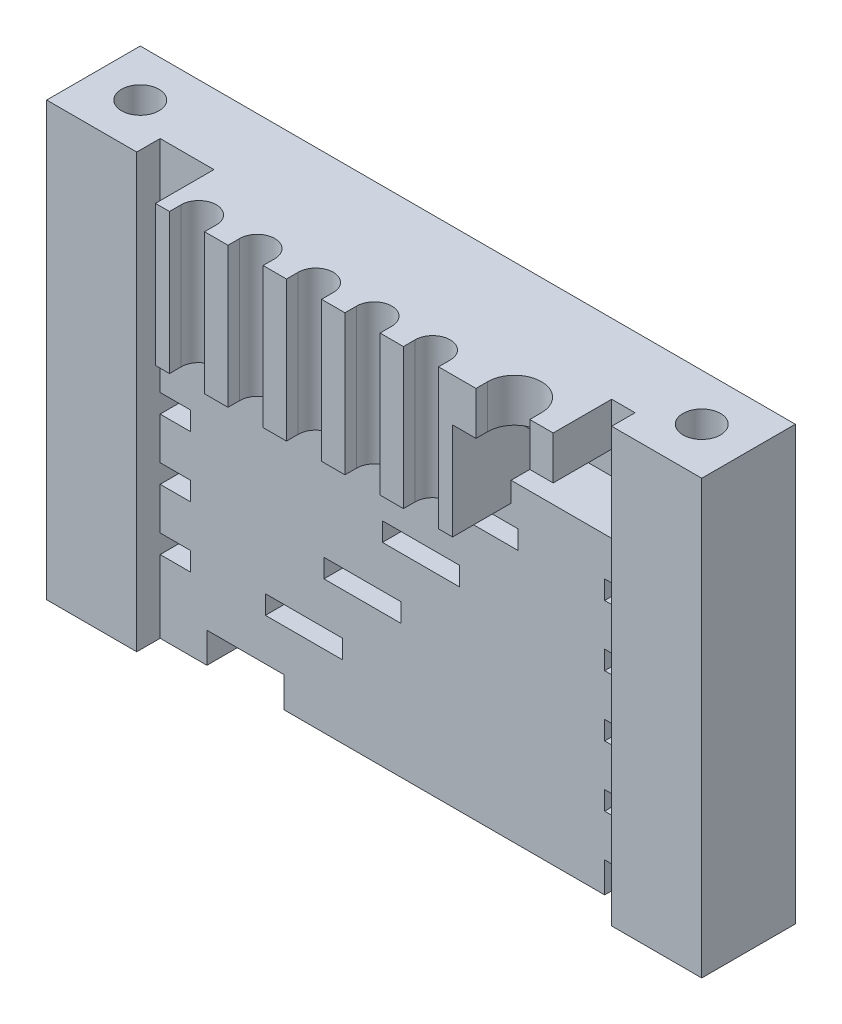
ISO-10303-21;
HEADER;
FILE_DESCRIPTION(('STEP AP214'),'2;1');
FILE_NAME('part.step','',(''),(''),'','','');
FILE_SCHEMA(('AUTOMOTIVE_DESIGN { 1 0 10303 214 1 1 1 1 }'));
ENDSEC;
DATA;
#1=APPLICATION_CONTEXT('core data for automotive mechanical design processes');
#2=APPLICATION_PROTOCOL_DEFINITION('international standard','automotive_design',2000,#1);
#3=PRODUCT_CONTEXT('',#1,'mechanical');
#4=PRODUCT('Part','Part','',(#3));
#5=PRODUCT_RELATED_PRODUCT_CATEGORY('part','',(#4));
#6=PRODUCT_DEFINITION_FORMATION('','',#4);
#7=PRODUCT_DEFINITION_CONTEXT('part definition',#1,'design');
#8=PRODUCT_DEFINITION('design','',#6,#7);
#9=PRODUCT_DEFINITION_SHAPE('','',#8);
#10=(LENGTH_UNIT() NAMED_UNIT(*) SI_UNIT(.MILLI.,.METRE.));
#11=(NAMED_UNIT(*) PLANE_ANGLE_UNIT() SI_UNIT($,.RADIAN.));
#12=(NAMED_UNIT(*) SI_UNIT($,.STERADIAN.) SOLID_ANGLE_UNIT());
#13=UNCERTAINTY_MEASURE_WITH_UNIT(LENGTH_MEASURE(1.E-05),#10,'distance_accuracy_value','');
#14=(GEOMETRIC_REPRESENTATION_CONTEXT(3) GLOBAL_UNCERTAINTY_ASSIGNED_CONTEXT((#13)) GLOBAL_UNIT_ASSIGNED_CONTEXT((#10,
#11,#12)) REPRESENTATION_CONTEXT('',''));
#15=CARTESIAN_POINT('',(0.,0.,0.));
#16=DIRECTION('',(0.,0.,1.));
#17=DIRECTION('',(1.,0.,0.));
#18=AXIS2_PLACEMENT_3D('',#15,#16,#17);
#19=CARTESIAN_POINT('',(-14.,-9.25,1.5));
#20=DIRECTION('',(0.,1.,0.));
#21=DIRECTION('',(0.,0.,1.));
#22=AXIS2_PLACEMENT_3D('',#19,#20,#21);
#23=PLANE('',#22);
#24=CARTESIAN_POINT('',(-12.,-9.25,0.5));
#25=DIRECTION('',(0.,1.,0.));
#26=DIRECTION('',(0.,0.,1.));
#27=AXIS2_PLACEMENT_3D('',#24,#25,#26);
#28=CIRCLE('',#27,0.799999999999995);
#29=CARTESIAN_POINT('',(-12.,-9.25,1.3));
#30=VERTEX_POINT('',#29);
#31=EDGE_CURVE('E1457',#30,#30,#28,.T.);
#32=ORIENTED_EDGE('',*,*,#31,.T.);
#33=EDGE_LOOP('',(#32));
#34=FACE_BOUND('',#33,.T.);
#35=DIRECTION('',(1.,0.,0.));
#36=VECTOR('',#35,1.);
#37=CARTESIAN_POINT('',(-14.,-9.25,-1.5));
#38=LINE('',#37,#36);
#39=CARTESIAN_POINT('',(-14.,-9.25,-1.5));
#40=VERTEX_POINT('',#39);
#41=CARTESIAN_POINT('',(-8.15000000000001,-9.25,-1.5));
#42=VERTEX_POINT('',#41);
#43=EDGE_CURVE('E679',#40,#42,#38,.T.);
#44=ORIENTED_EDGE('',*,*,#43,.T.);
#45=DIRECTION('',(0.,0.,1.));
#46=VECTOR('',#45,1.);
#47=CARTESIAN_POINT('',(-8.15000000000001,-9.25,1.5));
#48=LINE('',#47,#46);
#49=CARTESIAN_POINT('',(-8.15000000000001,-9.25,1.5));
#50=VERTEX_POINT('',#49);
#51=EDGE_CURVE('E663',#42,#50,#48,.T.);
#52=ORIENTED_EDGE('',*,*,#51,.T.);
#53=DIRECTION('',(1.,0.,0.));
#54=VECTOR('',#53,1.);
#55=CARTESIAN_POINT('',(-14.,-9.25,1.5));
#56=LINE('',#55,#54);
#57=CARTESIAN_POINT('',(-10.15,-9.25,1.5));
#58=VERTEX_POINT('',#57);
#59=EDGE_CURVE('E676',#58,#50,#56,.T.);
#60=ORIENTED_EDGE('',*,*,#59,.F.);
#61=DIRECTION('',(0.,0.,-1.));
#62=VECTOR('',#61,1.);
#63=CARTESIAN_POINT('',(-10.15,-9.25,2.5));
#64=LINE('',#63,#62);
#65=CARTESIAN_POINT('',(-10.15,-9.25,2.5));
#66=VERTEX_POINT('',#65);
#67=EDGE_CURVE('E1493',#66,#58,#64,.T.);
#68=ORIENTED_EDGE('',*,*,#67,.F.);
#69=DIRECTION('',(1.,0.,0.));
#70=VECTOR('',#69,1.);
#71=CARTESIAN_POINT('',(-14.,-9.25,2.5));
#72=LINE('',#71,#70);
#73=CARTESIAN_POINT('',(-14.,-9.25,2.5));
#74=VERTEX_POINT('',#73);
#75=EDGE_CURVE('E1482',#74,#66,#72,.T.);
#76=ORIENTED_EDGE('',*,*,#75,.F.);
#77=DIRECTION('',(0.,0.,-1.));
#78=VECTOR('',#77,1.);
#79=CARTESIAN_POINT('',(-14.,-9.25,1.5));
#80=LINE('',#79,#78);
#81=EDGE_CURVE('E692',#74,#40,#80,.T.);
#82=ORIENTED_EDGE('',*,*,#81,.T.);
#83=EDGE_LOOP('',(#44,#52,#60,#68,#76,#82));
#84=FACE_BOUND('',#83,.T.);
#85=ADVANCED_FACE('F37',(#34,#84),#23,.F.);
#86=CARTESIAN_POINT('',(-4.85000000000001,-9.25,1.5));
#87=VERTEX_POINT('',#86);
#88=CARTESIAN_POINT('',(8.84999999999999,-9.25,1.5));
#89=VERTEX_POINT('',#88);
#90=EDGE_CURVE('E689',#87,#89,#56,.T.);
#91=ORIENTED_EDGE('',*,*,#90,.F.);
#92=DIRECTION('',(0.,0.,-1.));
#93=VECTOR('',#92,1.);
#94=CARTESIAN_POINT('',(-4.85000000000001,-9.25,1.5));
#95=LINE('',#94,#93);
#96=CARTESIAN_POINT('',(-4.85000000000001,-9.25,-1.5));
#97=VERTEX_POINT('',#96);
#98=EDGE_CURVE('E681',#87,#97,#95,.T.);
#99=ORIENTED_EDGE('',*,*,#98,.T.);
#100=CARTESIAN_POINT('',(8.84999999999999,-9.25,-1.5));
#101=VERTEX_POINT('',#100);
#102=EDGE_CURVE('E709',#97,#101,#38,.T.);
#103=ORIENTED_EDGE('',*,*,#102,.T.);
#104=DIRECTION('',(0.,0.,1.));
#105=VECTOR('',#104,1.);
#106=CARTESIAN_POINT('',(8.84999999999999,-9.25,1.5));
#107=LINE('',#106,#105);
#108=EDGE_CURVE('E680',#101,#89,#107,.T.);
#109=ORIENTED_EDGE('',*,*,#108,.T.);
#110=EDGE_LOOP('',(#91,#99,#103,#109));
#111=FACE_BOUND('',#110,.T.);
#112=ADVANCED_FACE('F1407',(#111),#23,.F.);
#113=CARTESIAN_POINT('',(0.,0.,1.5));
#114=DIRECTION('',(0.,0.,1.));
#115=DIRECTION('',(1.,0.,0.));
#116=AXIS2_PLACEMENT_3D('',#113,#114,#115);
#117=PLANE('',#116);
#118=ORIENTED_EDGE('',*,*,#59,.T.);
#119=DIRECTION('',(0.,-1.,0.));
#120=VECTOR('',#119,1.);
#121=CARTESIAN_POINT('',(-8.15000000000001,-7.95000000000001,1.5));
#122=LINE('',#121,#120);
#123=CARTESIAN_POINT('',(-8.15000000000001,-7.95000000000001,1.5));
#124=VERTEX_POINT('',#123);
#125=EDGE_CURVE('E659',#124,#50,#122,.T.);
#126=ORIENTED_EDGE('',*,*,#125,.F.);
#127=DIRECTION('',(-1.,0.,0.));
#128=VECTOR('',#127,1.);
#129=CARTESIAN_POINT('',(-8.15000000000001,-7.95000000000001,1.5));
#130=LINE('',#129,#128);
#131=CARTESIAN_POINT('',(-4.85000000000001,-7.95000000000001,1.5));
#132=VERTEX_POINT('',#131);
#133=EDGE_CURVE('E1238',#132,#124,#130,.T.);
#134=ORIENTED_EDGE('',*,*,#133,.F.);
#135=DIRECTION('',(0.,1.,0.));
#136=VECTOR('',#135,1.);
#137=CARTESIAN_POINT('',(-4.85000000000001,-7.95000000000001,1.5));
#138=LINE('',#137,#136);
#139=EDGE_CURVE('E670',#87,#132,#138,.T.);
#140=ORIENTED_EDGE('',*,*,#139,.F.);
#141=ORIENTED_EDGE('',*,*,#90,.T.);
#142=DIRECTION('',(0.,-1.,0.));
#143=VECTOR('',#142,1.);
#144=CARTESIAN_POINT('',(8.84999999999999,-7.95000000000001,1.5));
#145=LINE('',#144,#143);
#146=CARTESIAN_POINT('',(8.84999999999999,-7.95000000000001,1.5));
#147=VERTEX_POINT('',#146);
#148=EDGE_CURVE('E906',#147,#89,#145,.T.);
#149=ORIENTED_EDGE('',*,*,#148,.F.);
#150=DIRECTION('',(-1.,0.,0.));
#151=VECTOR('',#150,1.);
#152=CARTESIAN_POINT('',(8.84999999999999,-7.95000000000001,1.5));
#153=LINE('',#152,#151);
#154=CARTESIAN_POINT('',(10.15,-7.95000000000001,1.5));
#155=VERTEX_POINT('',#154);
#156=EDGE_CURVE('E1097',#155,#147,#153,.T.);
#157=ORIENTED_EDGE('',*,*,#156,.F.);
#158=DIRECTION('',(0.,-1.,0.));
#159=VECTOR('',#158,1.);
#160=CARTESIAN_POINT('',(10.15,9.25,1.5));
#161=LINE('',#160,#159);
#162=CARTESIAN_POINT('',(10.15,-6.15000000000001,1.5));
#163=VERTEX_POINT('',#162);
#164=EDGE_CURVE('E1466',#163,#155,#161,.T.);
#165=ORIENTED_EDGE('',*,*,#164,.F.);
#166=DIRECTION('',(1.,0.,0.));
#167=VECTOR('',#166,1.);
#168=CARTESIAN_POINT('',(8.84999999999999,-6.15000000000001,1.5));
#169=LINE('',#168,#167);
#170=CARTESIAN_POINT('',(8.84999999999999,-6.15000000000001,1.5));
#171=VERTEX_POINT('',#170);
#172=EDGE_CURVE('E1079',#171,#163,#169,.T.);
#173=ORIENTED_EDGE('',*,*,#172,.F.);
#174=DIRECTION('',(0.,-1.,0.));
#175=VECTOR('',#174,1.);
#176=CARTESIAN_POINT('',(8.84999999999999,-5.35000000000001,1.5));
#177=LINE('',#176,#175);
#178=CARTESIAN_POINT('',(8.84999999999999,-5.35000000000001,1.5));
#179=VERTEX_POINT('',#178);
#180=EDGE_CURVE('E1077',#179,#171,#177,.T.);
#181=ORIENTED_EDGE('',*,*,#180,.F.);
#182=DIRECTION('',(-1.,0.,0.));
#183=VECTOR('',#182,1.);
#184=CARTESIAN_POINT('',(8.84999999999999,-5.35000000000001,1.5));
#185=LINE('',#184,#183);
#186=CARTESIAN_POINT('',(10.15,-5.35000000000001,1.5));
#187=VERTEX_POINT('',#186);
#188=EDGE_CURVE('E1067',#187,#179,#185,.T.);
#189=ORIENTED_EDGE('',*,*,#188,.F.);
#190=CARTESIAN_POINT('',(10.15,-3.55000000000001,1.5));
#191=VERTEX_POINT('',#190);
#192=EDGE_CURVE('E1874',#191,#187,#161,.T.);
#193=ORIENTED_EDGE('',*,*,#192,.F.);
#194=DIRECTION('',(1.,0.,0.));
#195=VECTOR('',#194,1.);
#196=CARTESIAN_POINT('',(8.84999999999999,-3.55000000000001,1.5));
#197=LINE('',#196,#195);
#198=CARTESIAN_POINT('',(8.84999999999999,-3.55000000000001,1.5));
#199=VERTEX_POINT('',#198);
#200=EDGE_CURVE('E1048',#199,#191,#197,.T.);
#201=ORIENTED_EDGE('',*,*,#200,.F.);
#202=DIRECTION('',(0.,-1.,0.));
#203=VECTOR('',#202,1.);
#204=CARTESIAN_POINT('',(8.84999999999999,-2.75000000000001,1.5));
#205=LINE('',#204,#203);
#206=CARTESIAN_POINT('',(8.84999999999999,-2.75000000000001,1.5));
#207=VERTEX_POINT('',#206);
#208=EDGE_CURVE('E1046',#207,#199,#205,.T.);
#209=ORIENTED_EDGE('',*,*,#208,.F.);
#210=DIRECTION('',(-1.,0.,0.));
#211=VECTOR('',#210,1.);
#212=CARTESIAN_POINT('',(8.84999999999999,-2.75000000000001,1.5));
#213=LINE('',#212,#211);
#214=CARTESIAN_POINT('',(10.15,-2.75000000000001,1.5));
#215=VERTEX_POINT('',#214);
#216=EDGE_CURVE('E1036',#215,#207,#213,.T.);
#217=ORIENTED_EDGE('',*,*,#216,.F.);
#218=CARTESIAN_POINT('',(10.15,-0.95000000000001,1.5));
#219=VERTEX_POINT('',#218);
#220=EDGE_CURVE('E1877',#219,#215,#161,.T.);
#221=ORIENTED_EDGE('',*,*,#220,.F.);
#222=DIRECTION('',(1.,0.,0.));
#223=VECTOR('',#222,1.);
#224=CARTESIAN_POINT('',(8.84999999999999,-0.950000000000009,1.5));
#225=LINE('',#224,#223);
#226=CARTESIAN_POINT('',(8.84999999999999,-0.950000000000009,1.5));
#227=VERTEX_POINT('',#226);
#228=EDGE_CURVE('E944',#227,#219,#225,.T.);
#229=ORIENTED_EDGE('',*,*,#228,.F.);
#230=DIRECTION('',(0.,-1.,0.));
#231=VECTOR('',#230,1.);
#232=CARTESIAN_POINT('',(8.84999999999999,-0.150000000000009,1.5));
#233=LINE('',#232,#231);
#234=CARTESIAN_POINT('',(8.84999999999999,-0.150000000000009,1.5));
#235=VERTEX_POINT('',#234);
#236=EDGE_CURVE('E956',#235,#227,#233,.T.);
#237=ORIENTED_EDGE('',*,*,#236,.F.);
#238=DIRECTION('',(-1.,0.,0.));
#239=VECTOR('',#238,1.);
#240=CARTESIAN_POINT('',(8.84999999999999,-0.150000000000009,1.5));
#241=LINE('',#240,#239);
#242=CARTESIAN_POINT('',(10.15,-0.150000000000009,1.5));
#243=VERTEX_POINT('',#242);
#244=EDGE_CURVE('E954',#243,#235,#241,.T.);
#245=ORIENTED_EDGE('',*,*,#244,.F.);
#246=CARTESIAN_POINT('',(10.15,1.64999999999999,1.5));
#247=VERTEX_POINT('',#246);
#248=EDGE_CURVE('E1476',#247,#243,#161,.T.);
#249=ORIENTED_EDGE('',*,*,#248,.F.);
#250=DIRECTION('',(1.,0.,0.));
#251=VECTOR('',#250,1.);
#252=CARTESIAN_POINT('',(8.84999999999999,1.64999999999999,1.5));
#253=LINE('',#252,#251);
#254=CARTESIAN_POINT('',(8.84999999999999,1.64999999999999,1.5));
#255=VERTEX_POINT('',#254);
#256=EDGE_CURVE('E923',#255,#247,#253,.T.);
#257=ORIENTED_EDGE('',*,*,#256,.F.);
#258=DIRECTION('',(0.,-1.,0.));
#259=VECTOR('',#258,1.);
#260=CARTESIAN_POINT('',(8.84999999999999,2.44999999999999,1.5));
#261=LINE('',#260,#259);
#262=CARTESIAN_POINT('',(8.84999999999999,2.44999999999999,1.5));
#263=VERTEX_POINT('',#262);
#264=EDGE_CURVE('E921',#263,#255,#261,.T.);
#265=ORIENTED_EDGE('',*,*,#264,.F.);
#266=DIRECTION('',(-1.,0.,0.));
#267=VECTOR('',#266,1.);
#268=CARTESIAN_POINT('',(8.84999999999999,2.44999999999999,1.5));
#269=LINE('',#268,#267);
#270=CARTESIAN_POINT('',(10.15,2.44999999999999,1.5));
#271=VERTEX_POINT('',#270);
#272=EDGE_CURVE('E911',#271,#263,#269,.T.);
#273=ORIENTED_EDGE('',*,*,#272,.F.);
#274=CARTESIAN_POINT('',(10.15,9.25,1.5));
#275=VERTEX_POINT('',#274);
#276=EDGE_CURVE('E1471',#275,#271,#161,.T.);
#277=ORIENTED_EDGE('',*,*,#276,.F.);
#278=DIRECTION('',(-1.,0.,0.));
#279=VECTOR('',#278,1.);
#280=CARTESIAN_POINT('',(-14.,9.25,1.5));
#281=LINE('',#280,#279);
#282=CARTESIAN_POINT('',(9.14999999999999,9.25,1.5));
#283=VERTEX_POINT('',#282);
#284=EDGE_CURVE('E695',#275,#283,#281,.T.);
#285=ORIENTED_EDGE('',*,*,#284,.T.);
#286=DIRECTION('',(0.,1.,0.));
#287=VECTOR('',#286,1.);
#288=CARTESIAN_POINT('',(9.14999999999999,6.39999999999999,1.5));
#289=LINE('',#288,#287);
#290=CARTESIAN_POINT('',(9.14999999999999,7.39999999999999,1.5));
#291=VERTEX_POINT('',#290);
#292=EDGE_CURVE('E893',#291,#283,#289,.T.);
#293=ORIENTED_EDGE('',*,*,#292,.F.);
#294=DIRECTION('',(-1.,0.,0.));
#295=VECTOR('',#294,1.);
#296=CARTESIAN_POINT('',(4.84999999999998,7.39999999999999,1.5));
#297=LINE('',#296,#295);
#298=CARTESIAN_POINT('',(4.84999999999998,7.39999999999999,1.5));
#299=VERTEX_POINT('',#298);
#300=EDGE_CURVE('E1498',#291,#299,#297,.T.);
#301=ORIENTED_EDGE('',*,*,#300,.T.);
#302=DIRECTION('',(0.,-1.,0.));
#303=VECTOR('',#302,1.);
#304=CARTESIAN_POINT('',(4.84999999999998,4.09999999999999,1.5));
#305=LINE('',#304,#303);
#306=CARTESIAN_POINT('',(4.84999999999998,6.39999999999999,1.5));
#307=VERTEX_POINT('',#306);
#308=EDGE_CURVE('E1496',#299,#307,#305,.T.);
#309=ORIENTED_EDGE('',*,*,#308,.T.);
#310=DIRECTION('',(-1.,0.,0.));
#311=VECTOR('',#310,1.);
#312=CARTESIAN_POINT('',(4.84999999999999,6.39999999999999,1.5));
#313=LINE('',#312,#311);
#314=CARTESIAN_POINT('',(9.14999999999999,6.39999999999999,1.5));
#315=VERTEX_POINT('',#314);
#316=EDGE_CURVE('E841',#315,#307,#313,.T.);
#317=ORIENTED_EDGE('',*,*,#316,.F.);
#318=DIRECTION('',(0.,1.,0.));
#319=VECTOR('',#318,1.);
#320=CARTESIAN_POINT('',(9.14999999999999,6.39999999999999,1.5));
#321=LINE('',#320,#319);
#322=CARTESIAN_POINT('',(9.14999999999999,4.09999999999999,1.5));
#323=VERTEX_POINT('',#322);
#324=EDGE_CURVE('E1009',#323,#315,#321,.T.);
#325=ORIENTED_EDGE('',*,*,#324,.F.);
#326=DIRECTION('',(1.,0.,0.));
#327=VECTOR('',#326,1.);
#328=CARTESIAN_POINT('',(4.84999999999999,4.09999999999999,1.5));
#329=LINE('',#328,#327);
#330=CARTESIAN_POINT('',(4.84999999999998,4.09999999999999,1.5));
#331=VERTEX_POINT('',#330);
#332=EDGE_CURVE('E931',#331,#323,#329,.T.);
#333=ORIENTED_EDGE('',*,*,#332,.F.);
#334=DIRECTION('',(0.,1.,0.));
#335=VECTOR('',#334,1.);
#336=CARTESIAN_POINT('',(4.84999999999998,3.24999999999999,1.5));
#337=LINE('',#336,#335);
#338=CARTESIAN_POINT('',(4.84999999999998,3.24999999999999,1.5));
#339=VERTEX_POINT('',#338);
#340=EDGE_CURVE('E891',#339,#331,#337,.T.);
#341=ORIENTED_EDGE('',*,*,#340,.F.);
#342=DIRECTION('',(1.,0.,0.));
#343=VECTOR('',#342,1.);
#344=CARTESIAN_POINT('',(-7.84999999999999,3.24999999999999,1.5));
#345=LINE('',#344,#343);
#346=CARTESIAN_POINT('',(-7.84999999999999,3.24999999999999,1.5));
#347=VERTEX_POINT('',#346);
#348=EDGE_CURVE('E889',#347,#339,#345,.T.);
#349=ORIENTED_EDGE('',*,*,#348,.F.);
#350=DIRECTION('',(0.,-1.,0.));
#351=VECTOR('',#350,1.);
#352=CARTESIAN_POINT('',(-7.84999999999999,9.25,1.5));
#353=LINE('',#352,#351);
#354=CARTESIAN_POINT('',(-7.84999999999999,9.25,1.5));
#355=VERTEX_POINT('',#354);
#356=EDGE_CURVE('E871',#355,#347,#353,.T.);
#357=ORIENTED_EDGE('',*,*,#356,.F.);
#358=CARTESIAN_POINT('',(-10.15,9.25,1.5));
#359=VERTEX_POINT('',#358);
#360=EDGE_CURVE('E708',#355,#359,#281,.T.);
#361=ORIENTED_EDGE('',*,*,#360,.T.);
#362=DIRECTION('',(0.,1.,0.));
#363=VECTOR('',#362,1.);
#364=CARTESIAN_POINT('',(-10.15,9.25,1.5));
#365=LINE('',#364,#363);
#366=CARTESIAN_POINT('',(-10.15,6.39999999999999,1.5));
#367=VERTEX_POINT('',#366);
#368=EDGE_CURVE('E1390',#367,#359,#365,.T.);
#369=ORIENTED_EDGE('',*,*,#368,.F.);
#370=DIRECTION('',(-1.,0.,0.));
#371=VECTOR('',#370,1.);
#372=CARTESIAN_POINT('',(-10.15,6.39999999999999,1.5));
#373=LINE('',#372,#371);
#374=CARTESIAN_POINT('',(-8.84999999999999,6.39999999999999,1.5));
#375=VERTEX_POINT('',#374);
#376=EDGE_CURVE('E1348',#375,#367,#373,.T.);
#377=ORIENTED_EDGE('',*,*,#376,.F.);
#378=DIRECTION('',(0.,1.,0.));
#379=VECTOR('',#378,1.);
#380=CARTESIAN_POINT('',(-8.84999999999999,6.39999999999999,1.5));
#381=LINE('',#380,#379);
#382=CARTESIAN_POINT('',(-8.84999999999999,4.09999999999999,1.5));
#383=VERTEX_POINT('',#382);
#384=EDGE_CURVE('E1360',#383,#375,#381,.T.);
#385=ORIENTED_EDGE('',*,*,#384,.F.);
#386=DIRECTION('',(1.,0.,0.));
#387=VECTOR('',#386,1.);
#388=CARTESIAN_POINT('',(-10.15,4.09999999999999,1.5));
#389=LINE('',#388,#387);
#390=CARTESIAN_POINT('',(-10.15,4.09999999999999,1.5));
#391=VERTEX_POINT('',#390);
#392=EDGE_CURVE('E1136',#391,#383,#389,.T.);
#393=ORIENTED_EDGE('',*,*,#392,.F.);
#394=CARTESIAN_POINT('',(-10.15,2.44999999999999,1.5));
#395=VERTEX_POINT('',#394);
#396=EDGE_CURVE('E1380',#395,#391,#365,.T.);
#397=ORIENTED_EDGE('',*,*,#396,.F.);
#398=DIRECTION('',(-1.,0.,0.));
#399=VECTOR('',#398,1.);
#400=CARTESIAN_POINT('',(-10.15,2.44999999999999,1.5));
#401=LINE('',#400,#399);
#402=CARTESIAN_POINT('',(-8.84999999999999,2.44999999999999,1.5));
#403=VERTEX_POINT('',#402);
#404=EDGE_CURVE('E1114',#403,#395,#401,.T.);
#405=ORIENTED_EDGE('',*,*,#404,.F.);
#406=DIRECTION('',(0.,1.,0.));
#407=VECTOR('',#406,1.);
#408=CARTESIAN_POINT('',(-8.84999999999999,2.44999999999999,1.5));
#409=LINE('',#408,#407);
#410=CARTESIAN_POINT('',(-8.84999999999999,1.64999999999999,1.5));
#411=VERTEX_POINT('',#410);
#412=EDGE_CURVE('E1127',#411,#403,#409,.T.);
#413=ORIENTED_EDGE('',*,*,#412,.F.);
#414=DIRECTION('',(1.,0.,0.));
#415=VECTOR('',#414,1.);
#416=CARTESIAN_POINT('',(-10.15,1.64999999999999,1.5));
#417=LINE('',#416,#415);
#418=CARTESIAN_POINT('',(-10.15,1.64999999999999,1.5));
#419=VERTEX_POINT('',#418);
#420=EDGE_CURVE('E1124',#419,#411,#417,.T.);
#421=ORIENTED_EDGE('',*,*,#420,.F.);
#422=CARTESIAN_POINT('',(-10.15,-0.15000000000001,1.5));
#423=VERTEX_POINT('',#422);
#424=EDGE_CURVE('E2661',#423,#419,#365,.T.);
#425=ORIENTED_EDGE('',*,*,#424,.F.);
#426=DIRECTION('',(-1.,0.,0.));
#427=VECTOR('',#426,1.);
#428=CARTESIAN_POINT('',(-10.15,-0.150000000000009,1.5));
#429=LINE('',#428,#427);
#430=CARTESIAN_POINT('',(-8.84999999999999,-0.150000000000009,1.5));
#431=VERTEX_POINT('',#430);
#432=EDGE_CURVE('E1147',#431,#423,#429,.T.);
#433=ORIENTED_EDGE('',*,*,#432,.F.);
#434=DIRECTION('',(0.,1.,0.));
#435=VECTOR('',#434,1.);
#436=CARTESIAN_POINT('',(-8.84999999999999,-0.150000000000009,1.5));
#437=LINE('',#436,#435);
#438=CARTESIAN_POINT('',(-8.84999999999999,-0.950000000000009,1.5));
#439=VERTEX_POINT('',#438);
#440=EDGE_CURVE('E1160',#439,#431,#437,.T.);
#441=ORIENTED_EDGE('',*,*,#440,.F.);
#442=DIRECTION('',(1.,0.,0.));
#443=VECTOR('',#442,1.);
#444=CARTESIAN_POINT('',(-10.15,-0.950000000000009,1.5));
#445=LINE('',#444,#443);
#446=CARTESIAN_POINT('',(-10.15,-0.950000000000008,1.5));
#447=VERTEX_POINT('',#446);
#448=EDGE_CURVE('E1157',#447,#439,#445,.T.);
#449=ORIENTED_EDGE('',*,*,#448,.F.);
#450=CARTESIAN_POINT('',(-10.15,-2.75000000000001,1.5));
#451=VERTEX_POINT('',#450);
#452=EDGE_CURVE('E2652',#451,#447,#365,.T.);
#453=ORIENTED_EDGE('',*,*,#452,.F.);
#454=DIRECTION('',(-1.,0.,0.));
#455=VECTOR('',#454,1.);
#456=CARTESIAN_POINT('',(-10.15,-2.75000000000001,1.5));
#457=LINE('',#456,#455);
#458=CARTESIAN_POINT('',(-8.84999999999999,-2.75000000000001,1.5));
#459=VERTEX_POINT('',#458);
#460=EDGE_CURVE('E1178',#459,#451,#457,.T.);
#461=ORIENTED_EDGE('',*,*,#460,.F.);
#462=DIRECTION('',(0.,1.,0.));
#463=VECTOR('',#462,1.);
#464=CARTESIAN_POINT('',(-8.84999999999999,-2.75000000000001,1.5));
#465=LINE('',#464,#463);
#466=CARTESIAN_POINT('',(-8.84999999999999,-3.55000000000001,1.5));
#467=VERTEX_POINT('',#466);
#468=EDGE_CURVE('E1191',#467,#459,#465,.T.);
#469=ORIENTED_EDGE('',*,*,#468,.F.);
#470=DIRECTION('',(1.,0.,0.));
#471=VECTOR('',#470,1.);
#472=CARTESIAN_POINT('',(-10.15,-3.55000000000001,1.5));
#473=LINE('',#472,#471);
#474=CARTESIAN_POINT('',(-10.15,-3.55000000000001,1.5));
#475=VERTEX_POINT('',#474);
#476=EDGE_CURVE('E1188',#475,#467,#473,.T.);
#477=ORIENTED_EDGE('',*,*,#476,.F.);
#478=CARTESIAN_POINT('',(-10.15,-5.35000000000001,1.5));
#479=VERTEX_POINT('',#478);
#480=EDGE_CURVE('E1491',#479,#475,#365,.T.);
#481=ORIENTED_EDGE('',*,*,#480,.F.);
#482=DIRECTION('',(-1.,0.,0.));
#483=VECTOR('',#482,1.);
#484=CARTESIAN_POINT('',(-8.84999999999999,-5.35000000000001,1.5));
#485=LINE('',#484,#483);
#486=CARTESIAN_POINT('',(-8.84999999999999,-5.35000000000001,1.5));
#487=VERTEX_POINT('',#486);
#488=EDGE_CURVE('E1221',#487,#479,#485,.T.);
#489=ORIENTED_EDGE('',*,*,#488,.F.);
#490=DIRECTION('',(0.,1.,0.));
#491=VECTOR('',#490,1.);
#492=CARTESIAN_POINT('',(-8.84999999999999,-6.15000000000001,1.5));
#493=LINE('',#492,#491);
#494=CARTESIAN_POINT('',(-8.84999999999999,-6.15000000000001,1.5));
#495=VERTEX_POINT('',#494);
#496=EDGE_CURVE('E1219',#495,#487,#493,.T.);
#497=ORIENTED_EDGE('',*,*,#496,.F.);
#498=DIRECTION('',(1.,0.,0.));
#499=VECTOR('',#498,1.);
#500=CARTESIAN_POINT('',(-8.84999999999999,-6.15000000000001,1.5));
#501=LINE('',#500,#499);
#502=CARTESIAN_POINT('',(-10.15,-6.15000000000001,1.5));
#503=VERTEX_POINT('',#502);
#504=EDGE_CURVE('E1209',#503,#495,#501,.T.);
#505=ORIENTED_EDGE('',*,*,#504,.F.);
#506=EDGE_CURVE('E687',#58,#503,#365,.T.);
#507=ORIENTED_EDGE('',*,*,#506,.F.);
#508=EDGE_LOOP('',(#118,#126,#134,#140,#141,#149,#157,#165,#173,#181,#189,#193,#201,#209,#217,
#221,#229,#237,#245,#249,#257,#265,#273,#277,#285,#293,#301,#309,#317,#325,#333,#341,#349,#357,
#361,#369,#377,#385,#393,#397,#405,#413,#421,#425,#433,#441,#449,#453,#461,#469,#477,#481,#489,
#497,#505,#507));
#509=FACE_BOUND('',#508,.T.);
#510=DIRECTION('',(0.,-1.,0.));
#511=VECTOR('',#510,1.);
#512=CARTESIAN_POINT('',(-5.65000000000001,-5.35000000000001,1.5));
#513=LINE('',#512,#511);
#514=CARTESIAN_POINT('',(-5.65000000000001,-5.35000000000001,1.5));
#515=VERTEX_POINT('',#514);
#516=CARTESIAN_POINT('',(-5.65000000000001,-6.15000000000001,1.5));
#517=VERTEX_POINT('',#516);
#518=EDGE_CURVE('E1264',#515,#517,#513,.T.);
#519=ORIENTED_EDGE('',*,*,#518,.F.);
#520=DIRECTION('',(-1.,0.,0.));
#521=VECTOR('',#520,1.);
#522=CARTESIAN_POINT('',(-5.65000000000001,-5.35000000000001,1.5));
#523=LINE('',#522,#521);
#524=CARTESIAN_POINT('',(-2.35000000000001,-5.35000000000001,1.5));
#525=VERTEX_POINT('',#524);
#526=EDGE_CURVE('E1254',#525,#515,#523,.T.);
#527=ORIENTED_EDGE('',*,*,#526,.F.);
#528=DIRECTION('',(0.,1.,0.));
#529=VECTOR('',#528,1.);
#530=CARTESIAN_POINT('',(-2.35000000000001,-5.35000000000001,1.5));
#531=LINE('',#530,#529);
#532=CARTESIAN_POINT('',(-2.35000000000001,-6.15000000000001,1.5));
#533=VERTEX_POINT('',#532);
#534=EDGE_CURVE('E1270',#533,#525,#531,.T.);
#535=ORIENTED_EDGE('',*,*,#534,.F.);
#536=DIRECTION('',(1.,0.,0.));
#537=VECTOR('',#536,1.);
#538=CARTESIAN_POINT('',(-5.65000000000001,-6.15000000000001,1.5));
#539=LINE('',#538,#537);
#540=EDGE_CURVE('E1266',#517,#533,#539,.T.);
#541=ORIENTED_EDGE('',*,*,#540,.F.);
#542=EDGE_LOOP('',(#519,#527,#535,#541));
#543=FACE_BOUND('',#542,.T.);
#544=DIRECTION('',(0.,-1.,0.));
#545=VECTOR('',#544,1.);
#546=CARTESIAN_POINT('',(-3.15000000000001,-2.75000000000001,1.5));
#547=LINE('',#546,#545);
#548=CARTESIAN_POINT('',(-3.15000000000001,-2.75000000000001,1.5));
#549=VERTEX_POINT('',#548);
#550=CARTESIAN_POINT('',(-3.15000000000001,-3.55000000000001,1.5));
#551=VERTEX_POINT('',#550);
#552=EDGE_CURVE('E1296',#549,#551,#547,.T.);
#553=ORIENTED_EDGE('',*,*,#552,.F.);
#554=DIRECTION('',(-1.,0.,0.));
#555=VECTOR('',#554,1.);
#556=CARTESIAN_POINT('',(-3.15000000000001,-2.75000000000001,1.5));
#557=LINE('',#556,#555);
#558=CARTESIAN_POINT('',(0.15,-2.75000000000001,1.5));
#559=VERTEX_POINT('',#558);
#560=EDGE_CURVE('E1286',#559,#549,#557,.T.);
#561=ORIENTED_EDGE('',*,*,#560,.F.);
#562=DIRECTION('',(0.,1.,0.));
#563=VECTOR('',#562,1.);
#564=CARTESIAN_POINT('',(0.15,-2.75000000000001,1.5));
#565=LINE('',#564,#563);
#566=CARTESIAN_POINT('',(0.15,-3.55000000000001,1.5));
#567=VERTEX_POINT('',#566);
#568=EDGE_CURVE('E1302',#567,#559,#565,.T.);
#569=ORIENTED_EDGE('',*,*,#568,.F.);
#570=DIRECTION('',(1.,0.,0.));
#571=VECTOR('',#570,1.);
#572=CARTESIAN_POINT('',(-3.15000000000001,-3.55000000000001,1.5));
#573=LINE('',#572,#571);
#574=EDGE_CURVE('E1298',#551,#567,#573,.T.);
#575=ORIENTED_EDGE('',*,*,#574,.F.);
#576=EDGE_LOOP('',(#553,#561,#569,#575));
#577=FACE_BOUND('',#576,.T.);
#578=DIRECTION('',(0.,-1.,0.));
#579=VECTOR('',#578,1.);
#580=CARTESIAN_POINT('',(-0.650000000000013,-0.150000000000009,1.5));
#581=LINE('',#580,#579);
#582=CARTESIAN_POINT('',(-0.650000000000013,-0.150000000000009,1.5));
#583=VERTEX_POINT('',#582);
#584=CARTESIAN_POINT('',(-0.650000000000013,-0.950000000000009,1.5));
#585=VERTEX_POINT('',#584);
#586=EDGE_CURVE('E998',#583,#585,#581,.T.);
#587=ORIENTED_EDGE('',*,*,#586,.F.);
#588=DIRECTION('',(-1.,0.,0.));
#589=VECTOR('',#588,1.);
#590=CARTESIAN_POINT('',(-0.650000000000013,-0.150000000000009,1.5));
#591=LINE('',#590,#589);
#592=CARTESIAN_POINT('',(2.64999999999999,-0.150000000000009,1.5));
#593=VERTEX_POINT('',#592);
#594=EDGE_CURVE('E1318',#593,#583,#591,.T.);
#595=ORIENTED_EDGE('',*,*,#594,.F.);
#596=DIRECTION('',(0.,1.,0.));
#597=VECTOR('',#596,1.);
#598=CARTESIAN_POINT('',(2.64999999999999,-0.150000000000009,1.5));
#599=LINE('',#598,#597);
#600=CARTESIAN_POINT('',(2.64999999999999,-0.950000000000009,1.5));
#601=VERTEX_POINT('',#600);
#602=EDGE_CURVE('E1332',#601,#593,#599,.T.);
#603=ORIENTED_EDGE('',*,*,#602,.F.);
#604=DIRECTION('',(1.,0.,0.));
#605=VECTOR('',#604,1.);
#606=CARTESIAN_POINT('',(-0.650000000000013,-0.950000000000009,1.5));
#607=LINE('',#606,#605);
#608=EDGE_CURVE('E1329',#585,#601,#607,.T.);
#609=ORIENTED_EDGE('',*,*,#608,.F.);
#610=EDGE_LOOP('',(#587,#595,#603,#609));
#611=FACE_BOUND('',#610,.T.);
#612=DIRECTION('',(0.,-1.,0.));
#613=VECTOR('',#612,1.);
#614=CARTESIAN_POINT('',(1.84999999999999,2.44999999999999,1.5));
#615=LINE('',#614,#613);
#616=CARTESIAN_POINT('',(1.84999999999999,2.44999999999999,1.5));
#617=VERTEX_POINT('',#616);
#618=CARTESIAN_POINT('',(1.84999999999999,1.64999999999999,1.5));
#619=VERTEX_POINT('',#618);
#620=EDGE_CURVE('E985',#617,#619,#615,.T.);
#621=ORIENTED_EDGE('',*,*,#620,.F.);
#622=DIRECTION('',(-1.,0.,0.));
#623=VECTOR('',#622,1.);
#624=CARTESIAN_POINT('',(1.84999999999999,2.44999999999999,1.5));
#625=LINE('',#624,#623);
#626=CARTESIAN_POINT('',(5.14999999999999,2.44999999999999,1.5));
#627=VERTEX_POINT('',#626);
#628=EDGE_CURVE('E975',#627,#617,#625,.T.);
#629=ORIENTED_EDGE('',*,*,#628,.F.);
#630=DIRECTION('',(0.,1.,0.));
#631=VECTOR('',#630,1.);
#632=CARTESIAN_POINT('',(5.14999999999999,2.44999999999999,1.5));
#633=LINE('',#632,#631);
#634=CARTESIAN_POINT('',(5.14999999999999,1.64999999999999,1.5));
#635=VERTEX_POINT('',#634);
#636=EDGE_CURVE('E991',#635,#627,#633,.T.);
#637=ORIENTED_EDGE('',*,*,#636,.F.);
#638=DIRECTION('',(1.,0.,0.));
#639=VECTOR('',#638,1.);
#640=CARTESIAN_POINT('',(1.84999999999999,1.64999999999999,1.5));
#641=LINE('',#640,#639);
#642=EDGE_CURVE('E987',#619,#635,#641,.T.);
#643=ORIENTED_EDGE('',*,*,#642,.F.);
#644=EDGE_LOOP('',(#621,#629,#637,#643));
#645=FACE_BOUND('',#644,.T.);
#646=ADVANCED_FACE('F684',(#509,#543,#577,#611,#645),#117,.T.);
#647=CARTESIAN_POINT('',(0.,0.,4.));
#648=DIRECTION('',(0.,0.,1.));
#649=DIRECTION('',(1.,0.,0.));
#650=AXIS2_PLACEMENT_3D('',#647,#648,#649);
#651=PLANE('',#650);
#652=DIRECTION('',(0.,1.,0.));
#653=VECTOR('',#652,1.);
#654=CARTESIAN_POINT('',(-5.75000000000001,0.,4.));
#655=LINE('',#654,#653);
#656=CARTESIAN_POINT('',(-5.75000000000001,3.24999999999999,4.));
#657=VERTEX_POINT('',#656);
#658=CARTESIAN_POINT('',(-5.75000000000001,9.25,4.));
#659=VERTEX_POINT('',#658);
#660=EDGE_CURVE('E741',#657,#659,#655,.T.);
#661=ORIENTED_EDGE('',*,*,#660,.F.);
#662=DIRECTION('',(1.,0.,0.));
#663=VECTOR('',#662,1.);
#664=CARTESIAN_POINT('',(-7.84999999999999,3.24999999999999,4.));
#665=LINE('',#664,#663);
#666=CARTESIAN_POINT('',(-4.75000000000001,3.24999999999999,4.));
#667=VERTEX_POINT('',#666);
#668=EDGE_CURVE('E883',#657,#667,#665,.T.);
#669=ORIENTED_EDGE('',*,*,#668,.T.);
#670=DIRECTION('',(0.,-1.,0.));
#671=VECTOR('',#670,1.);
#672=CARTESIAN_POINT('',(-4.75000000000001,0.,4.));
#673=LINE('',#672,#671);
#674=CARTESIAN_POINT('',(-4.75000000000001,9.25,4.));
#675=VERTEX_POINT('',#674);
#676=EDGE_CURVE('E735',#675,#667,#673,.T.);
#677=ORIENTED_EDGE('',*,*,#676,.F.);
#678=DIRECTION('',(-1.,0.,0.));
#679=VECTOR('',#678,1.);
#680=CARTESIAN_POINT('',(9.14999999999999,9.25,4.));
#681=LINE('',#680,#679);
#682=EDGE_CURVE('E1521',#675,#659,#681,.T.);
#683=ORIENTED_EDGE('',*,*,#682,.T.);
#684=EDGE_LOOP('',(#661,#669,#677,#683));
#685=FACE_BOUND('',#684,.T.);
#686=ADVANCED_FACE('F1572',(#685),#651,.T.);
#687=DIRECTION('',(0.,1.,0.));
#688=VECTOR('',#687,1.);
#689=CARTESIAN_POINT('',(-3.25000000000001,0.,4.));
#690=LINE('',#689,#688);
#691=CARTESIAN_POINT('',(-3.25000000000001,3.24999999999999,4.));
#692=VERTEX_POINT('',#691);
#693=CARTESIAN_POINT('',(-3.25000000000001,9.25,4.));
#694=VERTEX_POINT('',#693);
#695=EDGE_CURVE('E737',#692,#694,#690,.T.);
#696=ORIENTED_EDGE('',*,*,#695,.F.);
#697=CARTESIAN_POINT('',(-2.25000000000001,3.24999999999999,4.));
#698=VERTEX_POINT('',#697);
#699=EDGE_CURVE('E1567',#692,#698,#665,.T.);
#700=ORIENTED_EDGE('',*,*,#699,.T.);
#701=DIRECTION('',(0.,-1.,0.));
#702=VECTOR('',#701,1.);
#703=CARTESIAN_POINT('',(-2.25000000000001,0.,4.));
#704=LINE('',#703,#702);
#705=CARTESIAN_POINT('',(-2.25000000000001,9.25,4.));
#706=VERTEX_POINT('',#705);
#707=EDGE_CURVE('E731',#706,#698,#704,.T.);
#708=ORIENTED_EDGE('',*,*,#707,.F.);
#709=EDGE_CURVE('E1523',#706,#694,#681,.T.);
#710=ORIENTED_EDGE('',*,*,#709,.T.);
#711=EDGE_LOOP('',(#696,#700,#708,#710));
#712=FACE_BOUND('',#711,.T.);
#713=ADVANCED_FACE('F1585',(#712),#651,.T.);
#714=DIRECTION('',(0.,1.,0.));
#715=VECTOR('',#714,1.);
#716=CARTESIAN_POINT('',(-0.750000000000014,0.,4.));
#717=LINE('',#716,#715);
#718=CARTESIAN_POINT('',(-0.750000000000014,3.24999999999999,4.));
#719=VERTEX_POINT('',#718);
#720=CARTESIAN_POINT('',(-0.750000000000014,9.25,4.));
#721=VERTEX_POINT('',#720);
#722=EDGE_CURVE('E733',#719,#721,#717,.T.);
#723=ORIENTED_EDGE('',*,*,#722,.F.);
#724=CARTESIAN_POINT('',(0.249999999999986,3.24999999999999,4.));
#725=VERTEX_POINT('',#724);
#726=EDGE_CURVE('E1564',#719,#725,#665,.T.);
#727=ORIENTED_EDGE('',*,*,#726,.T.);
#728=DIRECTION('',(0.,-1.,0.));
#729=VECTOR('',#728,1.);
#730=CARTESIAN_POINT('',(0.249999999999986,0.,4.));
#731=LINE('',#730,#729);
#732=CARTESIAN_POINT('',(0.249999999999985,9.25,4.));
#733=VERTEX_POINT('',#732);
#734=EDGE_CURVE('E727',#733,#725,#731,.T.);
#735=ORIENTED_EDGE('',*,*,#734,.F.);
#736=EDGE_CURVE('E1528',#733,#721,#681,.T.);
#737=ORIENTED_EDGE('',*,*,#736,.T.);
#738=EDGE_LOOP('',(#723,#727,#735,#737));
#739=FACE_BOUND('',#738,.T.);
#740=ADVANCED_FACE('F1597',(#739),#651,.T.);
#741=DIRECTION('',(0.,1.,0.));
#742=VECTOR('',#741,1.);
#743=CARTESIAN_POINT('',(1.74999999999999,0.,4.));
#744=LINE('',#743,#742);
#745=CARTESIAN_POINT('',(1.74999999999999,3.24999999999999,4.));
#746=VERTEX_POINT('',#745);
#747=CARTESIAN_POINT('',(1.74999999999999,9.25,4.));
#748=VERTEX_POINT('',#747);
#749=EDGE_CURVE('E729',#746,#748,#744,.T.);
#750=ORIENTED_EDGE('',*,*,#749,.F.);
#751=CARTESIAN_POINT('',(2.74999999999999,3.24999999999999,4.));
#752=VERTEX_POINT('',#751);
#753=EDGE_CURVE('E1562',#746,#752,#665,.T.);
#754=ORIENTED_EDGE('',*,*,#753,.T.);
#755=DIRECTION('',(0.,-1.,0.));
#756=VECTOR('',#755,1.);
#757=CARTESIAN_POINT('',(2.74999999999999,0.,4.));
#758=LINE('',#757,#756);
#759=CARTESIAN_POINT('',(2.74999999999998,9.25,4.));
#760=VERTEX_POINT('',#759);
#761=EDGE_CURVE('E723',#760,#752,#758,.T.);
#762=ORIENTED_EDGE('',*,*,#761,.F.);
#763=EDGE_CURVE('E1534',#760,#748,#681,.T.);
#764=ORIENTED_EDGE('',*,*,#763,.T.);
#765=EDGE_LOOP('',(#750,#754,#762,#764));
#766=FACE_BOUND('',#765,.T.);
#767=ADVANCED_FACE('F1608',(#766),#651,.T.);
#768=DIRECTION('',(0.,1.,0.));
#769=VECTOR('',#768,1.);
#770=CARTESIAN_POINT('',(4.84999999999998,3.24999999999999,4.));
#771=LINE('',#770,#769);
#772=CARTESIAN_POINT('',(4.84999999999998,3.24999999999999,4.));
#773=VERTEX_POINT('',#772);
#774=CARTESIAN_POINT('',(4.84999999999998,7.39999999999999,4.));
#775=VERTEX_POINT('',#774);
#776=EDGE_CURVE('E882',#773,#775,#771,.T.);
#777=ORIENTED_EDGE('',*,*,#776,.T.);
#778=DIRECTION('',(-1.,0.,0.));
#779=VECTOR('',#778,1.);
#780=CARTESIAN_POINT('',(4.84999999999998,7.39999999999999,4.));
#781=LINE('',#780,#779);
#782=CARTESIAN_POINT('',(5.84999999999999,7.39999999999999,4.));
#783=VERTEX_POINT('',#782);
#784=EDGE_CURVE('E1495',#783,#775,#781,.T.);
#785=ORIENTED_EDGE('',*,*,#784,.F.);
#786=DIRECTION('',(0.,-1.,0.));
#787=VECTOR('',#786,1.);
#788=CARTESIAN_POINT('',(5.84999999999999,0.,4.));
#789=LINE('',#788,#787);
#790=CARTESIAN_POINT('',(5.84999999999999,9.25,4.));
#791=VERTEX_POINT('',#790);
#792=EDGE_CURVE('E718',#791,#783,#789,.T.);
#793=ORIENTED_EDGE('',*,*,#792,.F.);
#794=CARTESIAN_POINT('',(4.24999999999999,9.25,4.));
#795=VERTEX_POINT('',#794);
#796=EDGE_CURVE('E876',#791,#795,#681,.T.);
#797=ORIENTED_EDGE('',*,*,#796,.T.);
#798=DIRECTION('',(0.,1.,0.));
#799=VECTOR('',#798,1.);
#800=CARTESIAN_POINT('',(4.24999999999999,0.,4.));
#801=LINE('',#800,#799);
#802=CARTESIAN_POINT('',(4.24999999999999,3.24999999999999,4.));
#803=VERTEX_POINT('',#802);
#804=EDGE_CURVE('E725',#803,#795,#801,.T.);
#805=ORIENTED_EDGE('',*,*,#804,.F.);
#806=EDGE_CURVE('E879',#803,#773,#665,.T.);
#807=ORIENTED_EDGE('',*,*,#806,.T.);
#808=EDGE_LOOP('',(#777,#785,#793,#797,#805,#807));
#809=FACE_BOUND('',#808,.T.);
#810=ADVANCED_FACE('F1549',(#809),#651,.T.);
#811=CARTESIAN_POINT('',(9.14999999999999,7.39999999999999,4.));
#812=VERTEX_POINT('',#811);
#813=CARTESIAN_POINT('',(8.14999999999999,7.39999999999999,4.));
#814=VERTEX_POINT('',#813);
#815=EDGE_CURVE('E1499',#812,#814,#781,.T.);
#816=ORIENTED_EDGE('',*,*,#815,.F.);
#817=DIRECTION('',(0.,1.,0.));
#818=VECTOR('',#817,1.);
#819=CARTESIAN_POINT('',(9.14999999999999,6.39999999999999,4.));
#820=LINE('',#819,#818);
#821=CARTESIAN_POINT('',(9.14999999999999,9.25,4.));
#822=VERTEX_POINT('',#821);
#823=EDGE_CURVE('E885',#812,#822,#820,.T.);
#824=ORIENTED_EDGE('',*,*,#823,.T.);
#825=CARTESIAN_POINT('',(8.14999999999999,9.25,4.));
#826=VERTEX_POINT('',#825);
#827=EDGE_CURVE('E872',#822,#826,#681,.T.);
#828=ORIENTED_EDGE('',*,*,#827,.T.);
#829=DIRECTION('',(0.,1.,0.));
#830=VECTOR('',#829,1.);
#831=CARTESIAN_POINT('',(8.14999999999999,0.,4.));
#832=LINE('',#831,#830);
#833=EDGE_CURVE('E721',#814,#826,#832,.T.);
#834=ORIENTED_EDGE('',*,*,#833,.F.);
#835=EDGE_LOOP('',(#816,#824,#828,#834));
#836=FACE_BOUND('',#835,.T.);
#837=ADVANCED_FACE('F1638',(#836),#651,.T.);
#838=CARTESIAN_POINT('',(14.,9.25,1.5));
#839=DIRECTION('',(-1.,0.,0.));
#840=DIRECTION('',(0.,-1.,0.));
#841=AXIS2_PLACEMENT_3D('',#838,#839,#840);
#842=PLANE('',#841);
#843=DIRECTION('',(0.,1.,0.));
#844=VECTOR('',#843,1.);
#845=CARTESIAN_POINT('',(14.,9.25,-1.5));
#846=LINE('',#845,#844);
#847=CARTESIAN_POINT('',(14.,-9.25,-1.5));
#848=VERTEX_POINT('',#847);
#849=CARTESIAN_POINT('',(14.,9.25,-1.5));
#850=VERTEX_POINT('',#849);
#851=EDGE_CURVE('E699',#848,#850,#846,.T.);
#852=ORIENTED_EDGE('',*,*,#851,.T.);
#853=DIRECTION('',(0.,0.,-1.));
#854=VECTOR('',#853,1.);
#855=CARTESIAN_POINT('',(14.,9.25,1.5));
#856=LINE('',#855,#854);
#857=CARTESIAN_POINT('',(14.,9.25,2.5));
#858=VERTEX_POINT('',#857);
#859=EDGE_CURVE('E715',#858,#850,#856,.T.);
#860=ORIENTED_EDGE('',*,*,#859,.F.);
#861=DIRECTION('',(0.,1.,0.));
#862=VECTOR('',#861,1.);
#863=CARTESIAN_POINT('',(14.,9.25,2.5));
#864=LINE('',#863,#862);
#865=CARTESIAN_POINT('',(14.,-9.25,2.5));
#866=VERTEX_POINT('',#865);
#867=EDGE_CURVE('E1439',#866,#858,#864,.T.);
#868=ORIENTED_EDGE('',*,*,#867,.F.);
#869=DIRECTION('',(0.,0.,-1.));
#870=VECTOR('',#869,1.);
#871=CARTESIAN_POINT('',(14.,-9.25,1.5));
#872=LINE('',#871,#870);
#873=EDGE_CURVE('E688',#866,#848,#872,.T.);
#874=ORIENTED_EDGE('',*,*,#873,.T.);
#875=EDGE_LOOP('',(#852,#860,#868,#874));
#876=FACE_BOUND('',#875,.T.);
#877=ADVANCED_FACE('F39',(#876),#842,.F.);
#878=CARTESIAN_POINT('',(-14.,9.25,1.5));
#879=DIRECTION('',(0.,-1.,0.));
#880=DIRECTION('',(0.,0.,-1.));
#881=AXIS2_PLACEMENT_3D('',#878,#879,#880);
#882=PLANE('',#881);
#883=CARTESIAN_POINT('',(-12.,9.25,0.5));
#884=DIRECTION('',(0.,1.,0.));
#885=DIRECTION('',(0.,0.,1.));
#886=AXIS2_PLACEMENT_3D('',#883,#884,#885);
#887=CIRCLE('',#886,0.799999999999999);
#888=CARTESIAN_POINT('',(-12.,9.25,1.3));
#889=VERTEX_POINT('',#888);
#890=EDGE_CURVE('E1454',#889,#889,#887,.T.);
#891=ORIENTED_EDGE('',*,*,#890,.F.);
#892=EDGE_LOOP('',(#891));
#893=FACE_BOUND('',#892,.T.);
#894=CARTESIAN_POINT('',(12.,9.25,0.5));
#895=DIRECTION('',(0.,1.,0.));
#896=DIRECTION('',(0.,0.,1.));
#897=AXIS2_PLACEMENT_3D('',#894,#895,#896);
#898=CIRCLE('',#897,0.799999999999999);
#899=CARTESIAN_POINT('',(12.,9.25,1.3));
#900=VERTEX_POINT('',#899);
#901=EDGE_CURVE('E1462',#900,#900,#898,.T.);
#902=ORIENTED_EDGE('',*,*,#901,.F.);
#903=EDGE_LOOP('',(#902));
#904=FACE_BOUND('',#903,.T.);
#905=CARTESIAN_POINT('',(-6.50000000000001,9.25,3.5));
#906=DIRECTION('',(0.,1.,0.));
#907=DIRECTION('',(0.,0.,1.));
#908=AXIS2_PLACEMENT_3D('',#905,#906,#907);
#909=CIRCLE('',#908,0.75);
#910=CARTESIAN_POINT('',(-5.75000000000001,9.25,3.5));
#911=VERTEX_POINT('',#910);
#912=CARTESIAN_POINT('',(-7.25000000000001,9.25,3.5));
#913=VERTEX_POINT('',#912);
#914=EDGE_CURVE('E799',#911,#913,#909,.T.);
#915=ORIENTED_EDGE('',*,*,#914,.F.);
#916=DIRECTION('',(0.,0.,-1.));
#917=VECTOR('',#916,1.);
#918=CARTESIAN_POINT('',(-5.75000000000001,9.25,4.8243308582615));
#919=LINE('',#918,#917);
#920=EDGE_CURVE('E776',#659,#911,#919,.T.);
#921=ORIENTED_EDGE('',*,*,#920,.F.);
#922=ORIENTED_EDGE('',*,*,#682,.F.);
#923=DIRECTION('',(0.,0.,1.));
#924=VECTOR('',#923,1.);
#925=CARTESIAN_POINT('',(-4.75000000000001,9.25,3.5));
#926=LINE('',#925,#924);
#927=CARTESIAN_POINT('',(-4.75000000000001,9.25,3.5));
#928=VERTEX_POINT('',#927);
#929=EDGE_CURVE('E790',#928,#675,#926,.T.);
#930=ORIENTED_EDGE('',*,*,#929,.F.);
#931=CARTESIAN_POINT('',(-4.00000000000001,9.25,3.5));
#932=DIRECTION('',(0.,1.,0.));
#933=DIRECTION('',(0.,0.,1.));
#934=AXIS2_PLACEMENT_3D('',#931,#932,#933);
#935=CIRCLE('',#934,0.75);
#936=CARTESIAN_POINT('',(-3.25000000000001,9.25,3.5));
#937=VERTEX_POINT('',#936);
#938=EDGE_CURVE('E787',#937,#928,#935,.T.);
#939=ORIENTED_EDGE('',*,*,#938,.F.);
#940=DIRECTION('',(0.,0.,-1.));
#941=VECTOR('',#940,1.);
#942=CARTESIAN_POINT('',(-3.25000000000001,9.25,4.8243308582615));
#943=LINE('',#942,#941);
#944=EDGE_CURVE('E793',#694,#937,#943,.T.);
#945=ORIENTED_EDGE('',*,*,#944,.F.);
#946=ORIENTED_EDGE('',*,*,#709,.F.);
#947=DIRECTION('',(0.,0.,1.));
#948=VECTOR('',#947,1.);
#949=CARTESIAN_POINT('',(-2.25000000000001,9.25,3.5));
#950=LINE('',#949,#948);
#951=CARTESIAN_POINT('',(-2.25000000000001,9.25,3.5));
#952=VERTEX_POINT('',#951);
#953=EDGE_CURVE('E804',#952,#706,#950,.T.);
#954=ORIENTED_EDGE('',*,*,#953,.F.);
#955=CARTESIAN_POINT('',(-1.50000000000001,9.25,3.5));
#956=DIRECTION('',(0.,1.,0.));
#957=DIRECTION('',(0.,0.,1.));
#958=AXIS2_PLACEMENT_3D('',#955,#956,#957);
#959=CIRCLE('',#958,0.75);
#960=CARTESIAN_POINT('',(-0.750000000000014,9.25,3.5));
#961=VERTEX_POINT('',#960);
#962=EDGE_CURVE('E801',#961,#952,#959,.T.);
#963=ORIENTED_EDGE('',*,*,#962,.F.);
#964=DIRECTION('',(0.,0.,-1.));
#965=VECTOR('',#964,1.);
#966=CARTESIAN_POINT('',(-0.750000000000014,9.25,4.8243308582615));
#967=LINE('',#966,#965);
#968=EDGE_CURVE('E807',#721,#961,#967,.T.);
#969=ORIENTED_EDGE('',*,*,#968,.F.);
#970=ORIENTED_EDGE('',*,*,#736,.F.);
#971=DIRECTION('',(0.,0.,1.));
#972=VECTOR('',#971,1.);
#973=CARTESIAN_POINT('',(0.249999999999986,9.25,3.5));
#974=LINE('',#973,#972);
#975=CARTESIAN_POINT('',(0.249999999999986,9.25,3.5));
#976=VERTEX_POINT('',#975);
#977=EDGE_CURVE('E816',#976,#733,#974,.T.);
#978=ORIENTED_EDGE('',*,*,#977,.F.);
#979=CARTESIAN_POINT('',(0.999999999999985,9.25,3.5));
#980=DIRECTION('',(0.,1.,0.));
#981=DIRECTION('',(0.,0.,1.));
#982=AXIS2_PLACEMENT_3D('',#979,#980,#981);
#983=CIRCLE('',#982,0.75);
#984=CARTESIAN_POINT('',(1.74999999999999,9.25,3.5));
#985=VERTEX_POINT('',#984);
#986=EDGE_CURVE('E813',#985,#976,#983,.T.);
#987=ORIENTED_EDGE('',*,*,#986,.F.);
#988=DIRECTION('',(0.,0.,-1.));
#989=VECTOR('',#988,1.);
#990=CARTESIAN_POINT('',(1.74999999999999,9.25,4.8243308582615));
#991=LINE('',#990,#989);
#992=EDGE_CURVE('E819',#748,#985,#991,.T.);
#993=ORIENTED_EDGE('',*,*,#992,.F.);
#994=ORIENTED_EDGE('',*,*,#763,.F.);
#995=DIRECTION('',(0.,0.,1.));
#996=VECTOR('',#995,1.);
#997=CARTESIAN_POINT('',(2.74999999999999,9.25,3.5));
#998=LINE('',#997,#996);
#999=CARTESIAN_POINT('',(2.74999999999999,9.25,3.5));
#1000=VERTEX_POINT('',#999);
#1001=EDGE_CURVE('E828',#1000,#760,#998,.T.);
#1002=ORIENTED_EDGE('',*,*,#1001,.F.);
#1003=CARTESIAN_POINT('',(3.49999999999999,9.25,3.5));
#1004=DIRECTION('',(0.,1.,0.));
#1005=DIRECTION('',(0.,0.,1.));
#1006=AXIS2_PLACEMENT_3D('',#1003,#1004,#1005);
#1007=CIRCLE('',#1006,0.75);
#1008=CARTESIAN_POINT('',(4.24999999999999,9.25,3.5));
#1009=VERTEX_POINT('',#1008);
#1010=EDGE_CURVE('E825',#1009,#1000,#1007,.T.);
#1011=ORIENTED_EDGE('',*,*,#1010,.F.);
#1012=DIRECTION('',(0.,0.,-1.));
#1013=VECTOR('',#1012,1.);
#1014=CARTESIAN_POINT('',(4.24999999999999,9.25,4.8243308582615));
#1015=LINE('',#1014,#1013);
#1016=EDGE_CURVE('E831',#795,#1009,#1015,.T.);
#1017=ORIENTED_EDGE('',*,*,#1016,.F.);
#1018=ORIENTED_EDGE('',*,*,#796,.F.);
#1019=DIRECTION('',(0.,0.,1.));
#1020=VECTOR('',#1019,1.);
#1021=CARTESIAN_POINT('',(5.84999999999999,9.25,3.5));
#1022=LINE('',#1021,#1020);
#1023=CARTESIAN_POINT('',(5.84999999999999,9.25,3.5));
#1024=VERTEX_POINT('',#1023);
#1025=EDGE_CURVE('E840',#1024,#791,#1022,.T.);
#1026=ORIENTED_EDGE('',*,*,#1025,.F.);
#1027=CARTESIAN_POINT('',(6.99999999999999,9.25,3.5));
#1028=DIRECTION('',(0.,1.,0.));
#1029=DIRECTION('',(0.,0.,1.));
#1030=AXIS2_PLACEMENT_3D('',#1027,#1028,#1029);
#1031=CIRCLE('',#1030,1.15);
#1032=CARTESIAN_POINT('',(8.14999999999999,9.25,3.5));
#1033=VERTEX_POINT('',#1032);
#1034=EDGE_CURVE('E837',#1033,#1024,#1031,.T.);
#1035=ORIENTED_EDGE('',*,*,#1034,.F.);
#1036=DIRECTION('',(0.,0.,-1.));
#1037=VECTOR('',#1036,1.);
#1038=CARTESIAN_POINT('',(8.14999999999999,9.25,4.8243308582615));
#1039=LINE('',#1038,#1037);
#1040=EDGE_CURVE('E843',#826,#1033,#1039,.T.);
#1041=ORIENTED_EDGE('',*,*,#1040,.F.);
#1042=ORIENTED_EDGE('',*,*,#827,.F.);
#1043=DIRECTION('',(0.,0.,-1.));
#1044=VECTOR('',#1043,1.);
#1045=CARTESIAN_POINT('',(9.14999999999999,9.25,4.));
#1046=LINE('',#1045,#1044);
#1047=EDGE_CURVE('E887',#822,#283,#1046,.T.);
#1048=ORIENTED_EDGE('',*,*,#1047,.T.);
#1049=ORIENTED_EDGE('',*,*,#284,.F.);
#1050=DIRECTION('',(0.,0.,-1.));
#1051=VECTOR('',#1050,1.);
#1052=CARTESIAN_POINT('',(10.15,9.25,2.5));
#1053=LINE('',#1052,#1051);
#1054=CARTESIAN_POINT('',(10.15,9.25,2.5));
#1055=VERTEX_POINT('',#1054);
#1056=EDGE_CURVE('E1438',#1055,#275,#1053,.T.);
#1057=ORIENTED_EDGE('',*,*,#1056,.F.);
#1058=DIRECTION('',(-1.,0.,0.));
#1059=VECTOR('',#1058,1.);
#1060=CARTESIAN_POINT('',(14.,9.25,2.5));
#1061=LINE('',#1060,#1059);
#1062=EDGE_CURVE('E1467',#858,#1055,#1061,.T.);
#1063=ORIENTED_EDGE('',*,*,#1062,.F.);
#1064=ORIENTED_EDGE('',*,*,#859,.T.);
#1065=DIRECTION('',(-1.,0.,0.));
#1066=VECTOR('',#1065,1.);
#1067=CARTESIAN_POINT('',(-14.,9.25,-1.5));
#1068=LINE('',#1067,#1066);
#1069=CARTESIAN_POINT('',(-14.,9.25,-1.5));
#1070=VERTEX_POINT('',#1069);
#1071=EDGE_CURVE('E702',#850,#1070,#1068,.T.);
#1072=ORIENTED_EDGE('',*,*,#1071,.T.);
#1073=DIRECTION('',(0.,0.,-1.));
#1074=VECTOR('',#1073,1.);
#1075=CARTESIAN_POINT('',(-14.,9.25,1.5));
#1076=LINE('',#1075,#1074);
#1077=CARTESIAN_POINT('',(-14.,9.25,2.5));
#1078=VERTEX_POINT('',#1077);
#1079=EDGE_CURVE('E712',#1078,#1070,#1076,.T.);
#1080=ORIENTED_EDGE('',*,*,#1079,.F.);
#1081=DIRECTION('',(-1.,0.,0.));
#1082=VECTOR('',#1081,1.);
#1083=CARTESIAN_POINT('',(-14.,9.25,2.5));
#1084=LINE('',#1083,#1082);
#1085=CARTESIAN_POINT('',(-10.15,9.25,2.5));
#1086=VERTEX_POINT('',#1085);
#1087=EDGE_CURVE('E1486',#1086,#1078,#1084,.T.);
#1088=ORIENTED_EDGE('',*,*,#1087,.F.);
#1089=DIRECTION('',(0.,0.,-1.));
#1090=VECTOR('',#1089,1.);
#1091=CARTESIAN_POINT('',(-10.15,9.25,2.5));
#1092=LINE('',#1091,#1090);
#1093=EDGE_CURVE('E1489',#1086,#359,#1092,.T.);
#1094=ORIENTED_EDGE('',*,*,#1093,.T.);
#1095=ORIENTED_EDGE('',*,*,#360,.F.);
#1096=DIRECTION('',(0.,0.,-1.));
#1097=VECTOR('',#1096,1.);
#1098=CARTESIAN_POINT('',(-7.84999999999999,9.25,4.));
#1099=LINE('',#1098,#1097);
#1100=CARTESIAN_POINT('',(-7.84999999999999,9.25,4.));
#1101=VERTEX_POINT('',#1100);
#1102=EDGE_CURVE('E904',#1101,#355,#1099,.T.);
#1103=ORIENTED_EDGE('',*,*,#1102,.F.);
#1104=CARTESIAN_POINT('',(-7.25000000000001,9.25,4.));
#1105=VERTEX_POINT('',#1104);
#1106=EDGE_CURVE('E877',#1105,#1101,#681,.T.);
#1107=ORIENTED_EDGE('',*,*,#1106,.F.);
#1108=DIRECTION('',(0.,0.,1.));
#1109=VECTOR('',#1108,1.);
#1110=CARTESIAN_POINT('',(-7.25000000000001,9.25,3.5));
#1111=LINE('',#1110,#1109);
#1112=EDGE_CURVE('E59',#913,#1105,#1111,.T.);
#1113=ORIENTED_EDGE('',*,*,#1112,.F.);
#1114=EDGE_LOOP('',(#915,#921,#922,#930,#939,#945,#946,#954,#963,#969,#970,#978,#987,#993,#994,
#1002,#1011,#1017,#1018,#1026,#1035,#1041,#1042,#1048,#1049,#1057,#1063,#1064,#1072,#1080,#1088,
#1094,#1095,#1103,#1107,#1113));
#1115=FACE_BOUND('',#1114,.T.);
#1116=ADVANCED_FACE('F1424',(#893,#904,#1115),#882,.F.);
#1117=CARTESIAN_POINT('',(-14.,9.25,1.5));
#1118=DIRECTION('',(1.,0.,0.));
#1119=DIRECTION('',(0.,1.,0.));
#1120=AXIS2_PLACEMENT_3D('',#1117,#1118,#1119);
#1121=PLANE('',#1120);
#1122=DIRECTION('',(0.,-1.,0.));
#1123=VECTOR('',#1122,1.);
#1124=CARTESIAN_POINT('',(-14.,9.25,-1.5));
#1125=LINE('',#1124,#1123);
#1126=EDGE_CURVE('E705',#1070,#40,#1125,.T.);
#1127=ORIENTED_EDGE('',*,*,#1126,.T.);
#1128=ORIENTED_EDGE('',*,*,#81,.F.);
#1129=DIRECTION('',(0.,-1.,0.));
#1130=VECTOR('',#1129,1.);
#1131=CARTESIAN_POINT('',(-14.,9.25,2.5));
#1132=LINE('',#1131,#1130);
#1133=EDGE_CURVE('E1479',#1078,#74,#1132,.T.);
#1134=ORIENTED_EDGE('',*,*,#1133,.F.);
#1135=ORIENTED_EDGE('',*,*,#1079,.T.);
#1136=EDGE_LOOP('',(#1127,#1128,#1134,#1135));
#1137=FACE_BOUND('',#1136,.T.);
#1138=ADVANCED_FACE('F1418',(#1137),#1121,.F.);
#1139=CARTESIAN_POINT('',(12.,-9.25,0.5));
#1140=DIRECTION('',(0.,1.,0.));
#1141=DIRECTION('',(0.,0.,1.));
#1142=AXIS2_PLACEMENT_3D('',#1139,#1140,#1141);
#1143=CIRCLE('',#1142,0.799999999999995);
#1144=CARTESIAN_POINT('',(12.,-9.25,1.3));
#1145=VERTEX_POINT('',#1144);
#1146=EDGE_CURVE('E1429',#1145,#1145,#1143,.T.);
#1147=ORIENTED_EDGE('',*,*,#1146,.T.);
#1148=EDGE_LOOP('',(#1147));
#1149=FACE_BOUND('',#1148,.T.);
#1150=DIRECTION('',(0.,0.,-1.));
#1151=VECTOR('',#1150,1.);
#1152=CARTESIAN_POINT('',(10.15,-9.25,2.5));
#1153=LINE('',#1152,#1151);
#1154=CARTESIAN_POINT('',(10.15,-9.25,2.5));
#1155=VERTEX_POINT('',#1154);
#1156=CARTESIAN_POINT('',(10.15,-9.25,-1.5));
#1157=VERTEX_POINT('',#1156);
#1158=EDGE_CURVE('E1433',#1155,#1157,#1153,.T.);
#1159=ORIENTED_EDGE('',*,*,#1158,.T.);
#1160=EDGE_CURVE('E707',#1157,#848,#38,.T.);
#1161=ORIENTED_EDGE('',*,*,#1160,.T.);
#1162=ORIENTED_EDGE('',*,*,#873,.F.);
#1163=DIRECTION('',(1.,0.,0.));
#1164=VECTOR('',#1163,1.);
#1165=CARTESIAN_POINT('',(14.,-9.25,2.5));
#1166=LINE('',#1165,#1164);
#1167=EDGE_CURVE('E1436',#1155,#866,#1166,.T.);
#1168=ORIENTED_EDGE('',*,*,#1167,.F.);
#1169=EDGE_LOOP('',(#1159,#1161,#1162,#1168));
#1170=FACE_BOUND('',#1169,.T.);
#1171=ADVANCED_FACE('F1402',(#1149,#1170),#23,.F.);
#1172=CARTESIAN_POINT('',(0.,0.,-1.5));
#1173=DIRECTION('',(0.,0.,1.));
#1174=DIRECTION('',(1.,0.,0.));
#1175=AXIS2_PLACEMENT_3D('',#1172,#1173,#1174);
#1176=PLANE('',#1175);
#1177=DIRECTION('',(-1.,0.,0.));
#1178=VECTOR('',#1177,1.);
#1179=CARTESIAN_POINT('',(-10.15,2.44999999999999,-1.5));
#1180=LINE('',#1179,#1178);
#1181=CARTESIAN_POINT('',(-8.84999999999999,2.44999999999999,-1.5));
#1182=VERTEX_POINT('',#1181);
#1183=CARTESIAN_POINT('',(-10.15,2.44999999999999,-1.5));
#1184=VERTEX_POINT('',#1183);
#1185=EDGE_CURVE('E1120',#1182,#1184,#1180,.T.);
#1186=ORIENTED_EDGE('',*,*,#1185,.T.);
#1187=DIRECTION('',(0.,-1.,0.));
#1188=VECTOR('',#1187,1.);
#1189=CARTESIAN_POINT('',(-10.15,2.44999999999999,-1.5));
#1190=LINE('',#1189,#1188);
#1191=CARTESIAN_POINT('',(-10.15,1.64999999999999,-1.5));
#1192=VERTEX_POINT('',#1191);
#1193=EDGE_CURVE('E1110',#1184,#1192,#1190,.T.);
#1194=ORIENTED_EDGE('',*,*,#1193,.T.);
#1195=DIRECTION('',(1.,0.,0.));
#1196=VECTOR('',#1195,1.);
#1197=CARTESIAN_POINT('',(-10.15,1.64999999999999,-1.5));
#1198=LINE('',#1197,#1196);
#1199=CARTESIAN_POINT('',(-8.84999999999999,1.64999999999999,-1.5));
#1200=VERTEX_POINT('',#1199);
#1201=EDGE_CURVE('E1113',#1192,#1200,#1198,.T.);
#1202=ORIENTED_EDGE('',*,*,#1201,.T.);
#1203=DIRECTION('',(0.,1.,0.));
#1204=VECTOR('',#1203,1.);
#1205=CARTESIAN_POINT('',(-8.84999999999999,2.44999999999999,-1.5));
#1206=LINE('',#1205,#1204);
#1207=EDGE_CURVE('E1117',#1200,#1182,#1206,.T.);
#1208=ORIENTED_EDGE('',*,*,#1207,.T.);
#1209=EDGE_LOOP('',(#1186,#1194,#1202,#1208));
#1210=FACE_BOUND('',#1209,.T.);
#1211=DIRECTION('',(-1.,0.,0.));
#1212=VECTOR('',#1211,1.);
#1213=CARTESIAN_POINT('',(-10.15,-0.150000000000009,-1.5));
#1214=LINE('',#1213,#1212);
#1215=CARTESIAN_POINT('',(-8.84999999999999,-0.150000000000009,-1.5));
#1216=VERTEX_POINT('',#1215);
#1217=CARTESIAN_POINT('',(-10.15,-0.150000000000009,-1.5));
#1218=VERTEX_POINT('',#1217);
#1219=EDGE_CURVE('E1153',#1216,#1218,#1214,.T.);
#1220=ORIENTED_EDGE('',*,*,#1219,.T.);
#1221=DIRECTION('',(0.,-1.,0.));
#1222=VECTOR('',#1221,1.);
#1223=CARTESIAN_POINT('',(-10.15,-0.150000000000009,-1.5));
#1224=LINE('',#1223,#1222);
#1225=CARTESIAN_POINT('',(-10.15,-0.950000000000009,-1.5));
#1226=VERTEX_POINT('',#1225);
#1227=EDGE_CURVE('E1143',#1218,#1226,#1224,.T.);
#1228=ORIENTED_EDGE('',*,*,#1227,.T.);
#1229=DIRECTION('',(1.,0.,0.));
#1230=VECTOR('',#1229,1.);
#1231=CARTESIAN_POINT('',(-10.15,-0.950000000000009,-1.5));
#1232=LINE('',#1231,#1230);
#1233=CARTESIAN_POINT('',(-8.84999999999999,-0.950000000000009,-1.5));
#1234=VERTEX_POINT('',#1233);
#1235=EDGE_CURVE('E1146',#1226,#1234,#1232,.T.);
#1236=ORIENTED_EDGE('',*,*,#1235,.T.);
#1237=DIRECTION('',(0.,1.,0.));
#1238=VECTOR('',#1237,1.);
#1239=CARTESIAN_POINT('',(-8.84999999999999,-0.150000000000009,-1.5));
#1240=LINE('',#1239,#1238);
#1241=EDGE_CURVE('E1150',#1234,#1216,#1240,.T.);
#1242=ORIENTED_EDGE('',*,*,#1241,.T.);
#1243=EDGE_LOOP('',(#1220,#1228,#1236,#1242));
#1244=FACE_BOUND('',#1243,.T.);
#1245=DIRECTION('',(-1.,0.,0.));
#1246=VECTOR('',#1245,1.);
#1247=CARTESIAN_POINT('',(-10.15,-2.75000000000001,-1.5));
#1248=LINE('',#1247,#1246);
#1249=CARTESIAN_POINT('',(-8.84999999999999,-2.75000000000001,-1.5));
#1250=VERTEX_POINT('',#1249);
#1251=CARTESIAN_POINT('',(-10.15,-2.75000000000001,-1.5));
#1252=VERTEX_POINT('',#1251);
#1253=EDGE_CURVE('E1184',#1250,#1252,#1248,.T.);
#1254=ORIENTED_EDGE('',*,*,#1253,.T.);
#1255=DIRECTION('',(0.,-1.,0.));
#1256=VECTOR('',#1255,1.);
#1257=CARTESIAN_POINT('',(-10.15,-2.75000000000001,-1.5));
#1258=LINE('',#1257,#1256);
#1259=CARTESIAN_POINT('',(-10.15,-3.55000000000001,-1.5));
#1260=VERTEX_POINT('',#1259);
#1261=EDGE_CURVE('E1174',#1252,#1260,#1258,.T.);
#1262=ORIENTED_EDGE('',*,*,#1261,.T.);
#1263=DIRECTION('',(1.,0.,0.));
#1264=VECTOR('',#1263,1.);
#1265=CARTESIAN_POINT('',(-10.15,-3.55000000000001,-1.5));
#1266=LINE('',#1265,#1264);
#1267=CARTESIAN_POINT('',(-8.84999999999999,-3.55000000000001,-1.5));
#1268=VERTEX_POINT('',#1267);
#1269=EDGE_CURVE('E1177',#1260,#1268,#1266,.T.);
#1270=ORIENTED_EDGE('',*,*,#1269,.T.);
#1271=DIRECTION('',(0.,1.,0.));
#1272=VECTOR('',#1271,1.);
#1273=CARTESIAN_POINT('',(-8.84999999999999,-2.75000000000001,-1.5));
#1274=LINE('',#1273,#1272);
#1275=EDGE_CURVE('E1181',#1268,#1250,#1274,.T.);
#1276=ORIENTED_EDGE('',*,*,#1275,.T.);
#1277=EDGE_LOOP('',(#1254,#1262,#1270,#1276));
#1278=FACE_BOUND('',#1277,.T.);
#1279=DIRECTION('',(1.,0.,0.));
#1280=VECTOR('',#1279,1.);
#1281=CARTESIAN_POINT('',(-8.84999999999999,-6.15000000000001,-1.5));
#1282=LINE('',#1281,#1280);
#1283=CARTESIAN_POINT('',(-10.15,-6.15000000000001,-1.5));
#1284=VERTEX_POINT('',#1283);
#1285=CARTESIAN_POINT('',(-8.84999999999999,-6.15000000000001,-1.5));
#1286=VERTEX_POINT('',#1285);
#1287=EDGE_CURVE('E1215',#1284,#1286,#1282,.T.);
#1288=ORIENTED_EDGE('',*,*,#1287,.T.);
#1289=DIRECTION('',(0.,1.,0.));
#1290=VECTOR('',#1289,1.);
#1291=CARTESIAN_POINT('',(-8.84999999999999,-6.15000000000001,-1.5));
#1292=LINE('',#1291,#1290);
#1293=CARTESIAN_POINT('',(-8.84999999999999,-5.35000000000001,-1.5));
#1294=VERTEX_POINT('',#1293);
#1295=EDGE_CURVE('E1205',#1286,#1294,#1292,.T.);
#1296=ORIENTED_EDGE('',*,*,#1295,.T.);
#1297=DIRECTION('',(-1.,0.,0.));
#1298=VECTOR('',#1297,1.);
#1299=CARTESIAN_POINT('',(-8.84999999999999,-5.35000000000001,-1.5));
#1300=LINE('',#1299,#1298);
#1301=CARTESIAN_POINT('',(-10.15,-5.35000000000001,-1.5));
#1302=VERTEX_POINT('',#1301);
#1303=EDGE_CURVE('E1208',#1294,#1302,#1300,.T.);
#1304=ORIENTED_EDGE('',*,*,#1303,.T.);
#1305=DIRECTION('',(0.,-1.,0.));
#1306=VECTOR('',#1305,1.);
#1307=CARTESIAN_POINT('',(-10.15,-6.15000000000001,-1.5));
#1308=LINE('',#1307,#1306);
#1309=EDGE_CURVE('E1212',#1302,#1284,#1308,.T.);
#1310=ORIENTED_EDGE('',*,*,#1309,.T.);
#1311=EDGE_LOOP('',(#1288,#1296,#1304,#1310));
#1312=FACE_BOUND('',#1311,.T.);
#1313=DIRECTION('',(-1.,0.,0.));
#1314=VECTOR('',#1313,1.);
#1315=CARTESIAN_POINT('',(-5.65000000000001,-5.35000000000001,-1.5));
#1316=LINE('',#1315,#1314);
#1317=CARTESIAN_POINT('',(-2.35000000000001,-5.35000000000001,-1.5));
#1318=VERTEX_POINT('',#1317);
#1319=CARTESIAN_POINT('',(-5.65000000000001,-5.35000000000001,-1.5));
#1320=VERTEX_POINT('',#1319);
#1321=EDGE_CURVE('E1260',#1318,#1320,#1316,.T.);
#1322=ORIENTED_EDGE('',*,*,#1321,.T.);
#1323=DIRECTION('',(0.,-1.,0.));
#1324=VECTOR('',#1323,1.);
#1325=CARTESIAN_POINT('',(-5.65000000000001,-5.35000000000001,-1.5));
#1326=LINE('',#1325,#1324);
#1327=CARTESIAN_POINT('',(-5.65000000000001,-6.15000000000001,-1.5));
#1328=VERTEX_POINT('',#1327);
#1329=EDGE_CURVE('E1250',#1320,#1328,#1326,.T.);
#1330=ORIENTED_EDGE('',*,*,#1329,.T.);
#1331=DIRECTION('',(1.,0.,0.));
#1332=VECTOR('',#1331,1.);
#1333=CARTESIAN_POINT('',(-5.65000000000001,-6.15000000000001,-1.5));
#1334=LINE('',#1333,#1332);
#1335=CARTESIAN_POINT('',(-2.35000000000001,-6.15000000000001,-1.5));
#1336=VERTEX_POINT('',#1335);
#1337=EDGE_CURVE('E1253',#1328,#1336,#1334,.T.);
#1338=ORIENTED_EDGE('',*,*,#1337,.T.);
#1339=DIRECTION('',(0.,1.,0.));
#1340=VECTOR('',#1339,1.);
#1341=CARTESIAN_POINT('',(-2.35000000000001,-5.35000000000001,-1.5));
#1342=LINE('',#1341,#1340);
#1343=EDGE_CURVE('E1257',#1336,#1318,#1342,.T.);
#1344=ORIENTED_EDGE('',*,*,#1343,.T.);
#1345=EDGE_LOOP('',(#1322,#1330,#1338,#1344));
#1346=FACE_BOUND('',#1345,.T.);
#1347=DIRECTION('',(-1.,0.,0.));
#1348=VECTOR('',#1347,1.);
#1349=CARTESIAN_POINT('',(-3.15000000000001,-2.75000000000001,-1.5));
#1350=LINE('',#1349,#1348);
#1351=CARTESIAN_POINT('',(0.15,-2.75000000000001,-1.5));
#1352=VERTEX_POINT('',#1351);
#1353=CARTESIAN_POINT('',(-3.15000000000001,-2.75000000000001,-1.5));
#1354=VERTEX_POINT('',#1353);
#1355=EDGE_CURVE('E1292',#1352,#1354,#1350,.T.);
#1356=ORIENTED_EDGE('',*,*,#1355,.T.);
#1357=DIRECTION('',(0.,-1.,0.));
#1358=VECTOR('',#1357,1.);
#1359=CARTESIAN_POINT('',(-3.15000000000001,-2.75000000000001,-1.5));
#1360=LINE('',#1359,#1358);
#1361=CARTESIAN_POINT('',(-3.15000000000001,-3.55000000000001,-1.5));
#1362=VERTEX_POINT('',#1361);
#1363=EDGE_CURVE('E1282',#1354,#1362,#1360,.T.);
#1364=ORIENTED_EDGE('',*,*,#1363,.T.);
#1365=DIRECTION('',(1.,0.,0.));
#1366=VECTOR('',#1365,1.);
#1367=CARTESIAN_POINT('',(-3.15000000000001,-3.55000000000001,-1.5));
#1368=LINE('',#1367,#1366);
#1369=CARTESIAN_POINT('',(0.15,-3.55000000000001,-1.5));
#1370=VERTEX_POINT('',#1369);
#1371=EDGE_CURVE('E1285',#1362,#1370,#1368,.T.);
#1372=ORIENTED_EDGE('',*,*,#1371,.T.);
#1373=DIRECTION('',(0.,1.,0.));
#1374=VECTOR('',#1373,1.);
#1375=CARTESIAN_POINT('',(0.15,-2.75000000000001,-1.5));
#1376=LINE('',#1375,#1374);
#1377=EDGE_CURVE('E1289',#1370,#1352,#1376,.T.);
#1378=ORIENTED_EDGE('',*,*,#1377,.T.);
#1379=EDGE_LOOP('',(#1356,#1364,#1372,#1378));
#1380=FACE_BOUND('',#1379,.T.);
#1381=DIRECTION('',(-1.,0.,0.));
#1382=VECTOR('',#1381,1.);
#1383=CARTESIAN_POINT('',(-0.650000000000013,-0.150000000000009,-1.5));
#1384=LINE('',#1383,#1382);
#1385=CARTESIAN_POINT('',(2.64999999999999,-0.150000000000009,-1.5));
#1386=VERTEX_POINT('',#1385);
#1387=CARTESIAN_POINT('',(-0.650000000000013,-0.150000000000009,-1.5));
#1388=VERTEX_POINT('',#1387);
#1389=EDGE_CURVE('E1324',#1386,#1388,#1384,.T.);
#1390=ORIENTED_EDGE('',*,*,#1389,.T.);
#1391=DIRECTION('',(0.,-1.,0.));
#1392=VECTOR('',#1391,1.);
#1393=CARTESIAN_POINT('',(-0.650000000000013,-0.150000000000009,-1.5));
#1394=LINE('',#1393,#1392);
#1395=CARTESIAN_POINT('',(-0.650000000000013,-0.950000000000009,-1.5));
#1396=VERTEX_POINT('',#1395);
#1397=EDGE_CURVE('E1314',#1388,#1396,#1394,.T.);
#1398=ORIENTED_EDGE('',*,*,#1397,.T.);
#1399=DIRECTION('',(1.,0.,0.));
#1400=VECTOR('',#1399,1.);
#1401=CARTESIAN_POINT('',(-0.650000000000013,-0.950000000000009,-1.5));
#1402=LINE('',#1401,#1400);
#1403=CARTESIAN_POINT('',(2.64999999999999,-0.950000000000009,-1.5));
#1404=VERTEX_POINT('',#1403);
#1405=EDGE_CURVE('E1317',#1396,#1404,#1402,.T.);
#1406=ORIENTED_EDGE('',*,*,#1405,.T.);
#1407=DIRECTION('',(0.,1.,0.));
#1408=VECTOR('',#1407,1.);
#1409=CARTESIAN_POINT('',(2.64999999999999,-0.150000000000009,-1.5));
#1410=LINE('',#1409,#1408);
#1411=EDGE_CURVE('E1321',#1404,#1386,#1410,.T.);
#1412=ORIENTED_EDGE('',*,*,#1411,.T.);
#1413=EDGE_LOOP('',(#1390,#1398,#1406,#1412));
#1414=FACE_BOUND('',#1413,.T.);
#1415=DIRECTION('',(0.,1.,0.));
#1416=VECTOR('',#1415,1.);
#1417=CARTESIAN_POINT('',(10.15,-0.150000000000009,-1.5));
#1418=LINE('',#1417,#1416);
#1419=CARTESIAN_POINT('',(10.15,-0.950000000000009,-1.5));
#1420=VERTEX_POINT('',#1419);
#1421=CARTESIAN_POINT('',(10.15,-0.150000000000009,-1.5));
#1422=VERTEX_POINT('',#1421);
#1423=EDGE_CURVE('E950',#1420,#1422,#1418,.T.);
#1424=ORIENTED_EDGE('',*,*,#1423,.T.);
#1425=DIRECTION('',(-1.,0.,0.));
#1426=VECTOR('',#1425,1.);
#1427=CARTESIAN_POINT('',(8.84999999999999,-0.150000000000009,-1.5));
#1428=LINE('',#1427,#1426);
#1429=CARTESIAN_POINT('',(8.84999999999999,-0.150000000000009,-1.5));
#1430=VERTEX_POINT('',#1429);
#1431=EDGE_CURVE('E940',#1422,#1430,#1428,.T.);
#1432=ORIENTED_EDGE('',*,*,#1431,.T.);
#1433=DIRECTION('',(0.,-1.,0.));
#1434=VECTOR('',#1433,1.);
#1435=CARTESIAN_POINT('',(8.84999999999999,-0.150000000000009,-1.5));
#1436=LINE('',#1435,#1434);
#1437=CARTESIAN_POINT('',(8.84999999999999,-0.950000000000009,-1.5));
#1438=VERTEX_POINT('',#1437);
#1439=EDGE_CURVE('E943',#1430,#1438,#1436,.T.);
#1440=ORIENTED_EDGE('',*,*,#1439,.T.);
#1441=DIRECTION('',(1.,0.,0.));
#1442=VECTOR('',#1441,1.);
#1443=CARTESIAN_POINT('',(8.84999999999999,-0.950000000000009,-1.5));
#1444=LINE('',#1443,#1442);
#1445=EDGE_CURVE('E947',#1438,#1420,#1444,.T.);
#1446=ORIENTED_EDGE('',*,*,#1445,.T.);
#1447=EDGE_LOOP('',(#1424,#1432,#1440,#1446));
#1448=FACE_BOUND('',#1447,.T.);
#1449=DIRECTION('',(-1.,0.,0.));
#1450=VECTOR('',#1449,1.);
#1451=CARTESIAN_POINT('',(8.84999999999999,2.44999999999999,-1.5));
#1452=LINE('',#1451,#1450);
#1453=CARTESIAN_POINT('',(10.15,2.44999999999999,-1.5));
#1454=VERTEX_POINT('',#1453);
#1455=CARTESIAN_POINT('',(8.84999999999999,2.44999999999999,-1.5));
#1456=VERTEX_POINT('',#1455);
#1457=EDGE_CURVE('E917',#1454,#1456,#1452,.T.);
#1458=ORIENTED_EDGE('',*,*,#1457,.T.);
#1459=DIRECTION('',(0.,-1.,0.));
#1460=VECTOR('',#1459,1.);
#1461=CARTESIAN_POINT('',(8.84999999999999,2.44999999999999,-1.5));
#1462=LINE('',#1461,#1460);
#1463=CARTESIAN_POINT('',(8.84999999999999,1.64999999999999,-1.5));
#1464=VERTEX_POINT('',#1463);
#1465=EDGE_CURVE('E907',#1456,#1464,#1462,.T.);
#1466=ORIENTED_EDGE('',*,*,#1465,.T.);
#1467=DIRECTION('',(1.,0.,0.));
#1468=VECTOR('',#1467,1.);
#1469=CARTESIAN_POINT('',(8.84999999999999,1.64999999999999,-1.5));
#1470=LINE('',#1469,#1468);
#1471=CARTESIAN_POINT('',(10.15,1.64999999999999,-1.5));
#1472=VERTEX_POINT('',#1471);
#1473=EDGE_CURVE('E910',#1464,#1472,#1470,.T.);
#1474=ORIENTED_EDGE('',*,*,#1473,.T.);
#1475=DIRECTION('',(0.,1.,0.));
#1476=VECTOR('',#1475,1.);
#1477=CARTESIAN_POINT('',(10.15,2.44999999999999,-1.5));
#1478=LINE('',#1477,#1476);
#1479=EDGE_CURVE('E914',#1472,#1454,#1478,.T.);
#1480=ORIENTED_EDGE('',*,*,#1479,.T.);
#1481=EDGE_LOOP('',(#1458,#1466,#1474,#1480));
#1482=FACE_BOUND('',#1481,.T.);
#1483=DIRECTION('',(-1.,0.,0.));
#1484=VECTOR('',#1483,1.);
#1485=CARTESIAN_POINT('',(4.84999999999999,6.39999999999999,-1.5));
#1486=LINE('',#1485,#1484);
#1487=CARTESIAN_POINT('',(9.14999999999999,6.39999999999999,-1.5));
#1488=VERTEX_POINT('',#1487);
#1489=CARTESIAN_POINT('',(4.84999999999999,6.39999999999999,-1.5));
#1490=VERTEX_POINT('',#1489);
#1491=EDGE_CURVE('E1015',#1488,#1490,#1486,.T.);
#1492=ORIENTED_EDGE('',*,*,#1491,.T.);
#1493=DIRECTION('',(0.,-1.,0.));
#1494=VECTOR('',#1493,1.);
#1495=CARTESIAN_POINT('',(4.84999999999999,6.39999999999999,-1.5));
#1496=LINE('',#1495,#1494);
#1497=CARTESIAN_POINT('',(4.84999999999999,4.09999999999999,-1.5));
#1498=VERTEX_POINT('',#1497);
#1499=EDGE_CURVE('E1005',#1490,#1498,#1496,.T.);
#1500=ORIENTED_EDGE('',*,*,#1499,.T.);
#1501=DIRECTION('',(1.,0.,0.));
#1502=VECTOR('',#1501,1.);
#1503=CARTESIAN_POINT('',(4.84999999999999,4.09999999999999,-1.5));
#1504=LINE('',#1503,#1502);
#1505=CARTESIAN_POINT('',(9.14999999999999,4.09999999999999,-1.5));
#1506=VERTEX_POINT('',#1505);
#1507=EDGE_CURVE('E1008',#1498,#1506,#1504,.T.);
#1508=ORIENTED_EDGE('',*,*,#1507,.T.);
#1509=DIRECTION('',(0.,1.,0.));
#1510=VECTOR('',#1509,1.);
#1511=CARTESIAN_POINT('',(9.14999999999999,6.39999999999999,-1.5));
#1512=LINE('',#1511,#1510);
#1513=EDGE_CURVE('E1012',#1506,#1488,#1512,.T.);
#1514=ORIENTED_EDGE('',*,*,#1513,.T.);
#1515=EDGE_LOOP('',(#1492,#1500,#1508,#1514));
#1516=FACE_BOUND('',#1515,.T.);
#1517=DIRECTION('',(-1.,0.,0.));
#1518=VECTOR('',#1517,1.);
#1519=CARTESIAN_POINT('',(1.84999999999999,2.44999999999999,-1.5));
#1520=LINE('',#1519,#1518);
#1521=CARTESIAN_POINT('',(5.14999999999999,2.44999999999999,-1.5));
#1522=VERTEX_POINT('',#1521);
#1523=CARTESIAN_POINT('',(1.84999999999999,2.44999999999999,-1.5));
#1524=VERTEX_POINT('',#1523);
#1525=EDGE_CURVE('E981',#1522,#1524,#1520,.T.);
#1526=ORIENTED_EDGE('',*,*,#1525,.T.);
#1527=DIRECTION('',(0.,-1.,0.));
#1528=VECTOR('',#1527,1.);
#1529=CARTESIAN_POINT('',(1.84999999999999,2.44999999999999,-1.5));
#1530=LINE('',#1529,#1528);
#1531=CARTESIAN_POINT('',(1.84999999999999,1.64999999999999,-1.5));
#1532=VERTEX_POINT('',#1531);
#1533=EDGE_CURVE('E971',#1524,#1532,#1530,.T.);
#1534=ORIENTED_EDGE('',*,*,#1533,.T.);
#1535=DIRECTION('',(1.,0.,0.));
#1536=VECTOR('',#1535,1.);
#1537=CARTESIAN_POINT('',(1.84999999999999,1.64999999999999,-1.5));
#1538=LINE('',#1537,#1536);
#1539=CARTESIAN_POINT('',(5.14999999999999,1.64999999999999,-1.5));
#1540=VERTEX_POINT('',#1539);
#1541=EDGE_CURVE('E974',#1532,#1540,#1538,.T.);
#1542=ORIENTED_EDGE('',*,*,#1541,.T.);
#1543=DIRECTION('',(0.,1.,0.));
#1544=VECTOR('',#1543,1.);
#1545=CARTESIAN_POINT('',(5.14999999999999,2.44999999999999,-1.5));
#1546=LINE('',#1545,#1544);
#1547=EDGE_CURVE('E978',#1540,#1522,#1546,.T.);
#1548=ORIENTED_EDGE('',*,*,#1547,.T.);
#1549=EDGE_LOOP('',(#1526,#1534,#1542,#1548));
#1550=FACE_BOUND('',#1549,.T.);
#1551=DIRECTION('',(-1.,0.,0.));
#1552=VECTOR('',#1551,1.);
#1553=CARTESIAN_POINT('',(8.84999999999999,-2.75000000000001,-1.5));
#1554=LINE('',#1553,#1552);
#1555=CARTESIAN_POINT('',(10.15,-2.75000000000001,-1.5));
#1556=VERTEX_POINT('',#1555);
#1557=CARTESIAN_POINT('',(8.84999999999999,-2.75000000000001,-1.5));
#1558=VERTEX_POINT('',#1557);
#1559=EDGE_CURVE('E1042',#1556,#1558,#1554,.T.);
#1560=ORIENTED_EDGE('',*,*,#1559,.T.);
#1561=DIRECTION('',(0.,-1.,0.));
#1562=VECTOR('',#1561,1.);
#1563=CARTESIAN_POINT('',(8.84999999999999,-2.75000000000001,-1.5));
#1564=LINE('',#1563,#1562);
#1565=CARTESIAN_POINT('',(8.84999999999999,-3.55000000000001,-1.5));
#1566=VERTEX_POINT('',#1565);
#1567=EDGE_CURVE('E1032',#1558,#1566,#1564,.T.);
#1568=ORIENTED_EDGE('',*,*,#1567,.T.);
#1569=DIRECTION('',(1.,0.,0.));
#1570=VECTOR('',#1569,1.);
#1571=CARTESIAN_POINT('',(8.84999999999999,-3.55000000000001,-1.5));
#1572=LINE('',#1571,#1570);
#1573=CARTESIAN_POINT('',(10.15,-3.55000000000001,-1.5));
#1574=VERTEX_POINT('',#1573);
#1575=EDGE_CURVE('E1035',#1566,#1574,#1572,.T.);
#1576=ORIENTED_EDGE('',*,*,#1575,.T.);
#1577=DIRECTION('',(0.,1.,0.));
#1578=VECTOR('',#1577,1.);
#1579=CARTESIAN_POINT('',(10.15,-2.75000000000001,-1.5));
#1580=LINE('',#1579,#1578);
#1581=EDGE_CURVE('E1039',#1574,#1556,#1580,.T.);
#1582=ORIENTED_EDGE('',*,*,#1581,.T.);
#1583=EDGE_LOOP('',(#1560,#1568,#1576,#1582));
#1584=FACE_BOUND('',#1583,.T.);
#1585=DIRECTION('',(-1.,0.,0.));
#1586=VECTOR('',#1585,1.);
#1587=CARTESIAN_POINT('',(8.84999999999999,-5.35000000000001,-1.5));
#1588=LINE('',#1587,#1586);
#1589=CARTESIAN_POINT('',(10.15,-5.35000000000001,-1.5));
#1590=VERTEX_POINT('',#1589);
#1591=CARTESIAN_POINT('',(8.84999999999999,-5.35000000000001,-1.5));
#1592=VERTEX_POINT('',#1591);
#1593=EDGE_CURVE('E1073',#1590,#1592,#1588,.T.);
#1594=ORIENTED_EDGE('',*,*,#1593,.T.);
#1595=DIRECTION('',(0.,-1.,0.));
#1596=VECTOR('',#1595,1.);
#1597=CARTESIAN_POINT('',(8.84999999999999,-5.35000000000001,-1.5));
#1598=LINE('',#1597,#1596);
#1599=CARTESIAN_POINT('',(8.84999999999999,-6.15000000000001,-1.5));
#1600=VERTEX_POINT('',#1599);
#1601=EDGE_CURVE('E1063',#1592,#1600,#1598,.T.);
#1602=ORIENTED_EDGE('',*,*,#1601,.T.);
#1603=DIRECTION('',(1.,0.,0.));
#1604=VECTOR('',#1603,1.);
#1605=CARTESIAN_POINT('',(8.84999999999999,-6.15000000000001,-1.5));
#1606=LINE('',#1605,#1604);
#1607=CARTESIAN_POINT('',(10.15,-6.15000000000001,-1.5));
#1608=VERTEX_POINT('',#1607);
#1609=EDGE_CURVE('E1066',#1600,#1608,#1606,.T.);
#1610=ORIENTED_EDGE('',*,*,#1609,.T.);
#1611=DIRECTION('',(0.,1.,0.));
#1612=VECTOR('',#1611,1.);
#1613=CARTESIAN_POINT('',(10.15,-5.35000000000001,-1.5));
#1614=LINE('',#1613,#1612);
#1615=EDGE_CURVE('E1070',#1608,#1590,#1614,.T.);
#1616=ORIENTED_EDGE('',*,*,#1615,.T.);
#1617=EDGE_LOOP('',(#1594,#1602,#1610,#1616));
#1618=FACE_BOUND('',#1617,.T.);
#1619=DIRECTION('',(-1.,0.,0.));
#1620=VECTOR('',#1619,1.);
#1621=CARTESIAN_POINT('',(-10.15,6.39999999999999,-1.5));
#1622=LINE('',#1621,#1620);
#1623=CARTESIAN_POINT('',(-8.84999999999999,6.39999999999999,-1.5));
#1624=VERTEX_POINT('',#1623);
#1625=CARTESIAN_POINT('',(-10.15,6.39999999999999,-1.5));
#1626=VERTEX_POINT('',#1625);
#1627=EDGE_CURVE('E1354',#1624,#1626,#1622,.T.);
#1628=ORIENTED_EDGE('',*,*,#1627,.T.);
#1629=DIRECTION('',(0.,-1.,0.));
#1630=VECTOR('',#1629,1.);
#1631=CARTESIAN_POINT('',(-10.15,6.39999999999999,-1.5));
#1632=LINE('',#1631,#1630);
#1633=CARTESIAN_POINT('',(-10.15,4.09999999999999,-1.5));
#1634=VERTEX_POINT('',#1633);
#1635=EDGE_CURVE('E1344',#1626,#1634,#1632,.T.);
#1636=ORIENTED_EDGE('',*,*,#1635,.T.);
#1637=DIRECTION('',(1.,0.,0.));
#1638=VECTOR('',#1637,1.);
#1639=CARTESIAN_POINT('',(-10.15,4.09999999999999,-1.5));
#1640=LINE('',#1639,#1638);
#1641=CARTESIAN_POINT('',(-8.84999999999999,4.09999999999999,-1.5));
#1642=VERTEX_POINT('',#1641);
#1643=EDGE_CURVE('E1347',#1634,#1642,#1640,.T.);
#1644=ORIENTED_EDGE('',*,*,#1643,.T.);
#1645=DIRECTION('',(0.,1.,0.));
#1646=VECTOR('',#1645,1.);
#1647=CARTESIAN_POINT('',(-8.84999999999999,6.39999999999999,-1.5));
#1648=LINE('',#1647,#1646);
#1649=EDGE_CURVE('E1351',#1642,#1624,#1648,.T.);
#1650=ORIENTED_EDGE('',*,*,#1649,.T.);
#1651=EDGE_LOOP('',(#1628,#1636,#1644,#1650));
#1652=FACE_BOUND('',#1651,.T.);
#1653=DIRECTION('',(0.,-1.,0.));
#1654=VECTOR('',#1653,1.);
#1655=CARTESIAN_POINT('',(-8.15000000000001,-7.95000000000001,-1.5));
#1656=LINE('',#1655,#1654);
#1657=CARTESIAN_POINT('',(-8.15000000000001,-7.95000000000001,-1.5));
#1658=VERTEX_POINT('',#1657);
#1659=EDGE_CURVE('E1235',#1658,#42,#1656,.T.);
#1660=ORIENTED_EDGE('',*,*,#1659,.T.);
#1661=ORIENTED_EDGE('',*,*,#43,.F.);
#1662=ORIENTED_EDGE('',*,*,#1126,.F.);
#1663=ORIENTED_EDGE('',*,*,#1071,.F.);
#1664=ORIENTED_EDGE('',*,*,#851,.F.);
#1665=ORIENTED_EDGE('',*,*,#1160,.F.);
#1666=DIRECTION('',(0.,1.,0.));
#1667=VECTOR('',#1666,1.);
#1668=CARTESIAN_POINT('',(10.15,-7.95000000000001,-1.5));
#1669=LINE('',#1668,#1667);
#1670=CARTESIAN_POINT('',(10.15,-7.95000000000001,-1.5));
#1671=VERTEX_POINT('',#1670);
#1672=EDGE_CURVE('E1096',#1157,#1671,#1669,.T.);
#1673=ORIENTED_EDGE('',*,*,#1672,.T.);
#1674=DIRECTION('',(-1.,0.,0.));
#1675=VECTOR('',#1674,1.);
#1676=CARTESIAN_POINT('',(8.84999999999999,-7.95000000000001,-1.5));
#1677=LINE('',#1676,#1675);
#1678=CARTESIAN_POINT('',(8.84999999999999,-7.95000000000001,-1.5));
#1679=VERTEX_POINT('',#1678);
#1680=EDGE_CURVE('E1100',#1671,#1679,#1677,.T.);
#1681=ORIENTED_EDGE('',*,*,#1680,.T.);
#1682=DIRECTION('',(0.,-1.,0.));
#1683=VECTOR('',#1682,1.);
#1684=CARTESIAN_POINT('',(8.84999999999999,-7.95000000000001,-1.5));
#1685=LINE('',#1684,#1683);
#1686=EDGE_CURVE('E1094',#1679,#101,#1685,.T.);
#1687=ORIENTED_EDGE('',*,*,#1686,.T.);
#1688=ORIENTED_EDGE('',*,*,#102,.F.);
#1689=DIRECTION('',(0.,1.,0.));
#1690=VECTOR('',#1689,1.);
#1691=CARTESIAN_POINT('',(-4.85000000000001,-7.95000000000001,-1.5));
#1692=LINE('',#1691,#1690);
#1693=CARTESIAN_POINT('',(-4.85000000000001,-7.95000000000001,-1.5));
#1694=VERTEX_POINT('',#1693);
#1695=EDGE_CURVE('E1237',#97,#1694,#1692,.T.);
#1696=ORIENTED_EDGE('',*,*,#1695,.T.);
#1697=DIRECTION('',(-1.,0.,0.));
#1698=VECTOR('',#1697,1.);
#1699=CARTESIAN_POINT('',(-8.15000000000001,-7.95000000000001,-1.5));
#1700=LINE('',#1699,#1698);
#1701=EDGE_CURVE('E1241',#1694,#1658,#1700,.T.);
#1702=ORIENTED_EDGE('',*,*,#1701,.T.);
#1703=EDGE_LOOP('',(#1660,#1661,#1662,#1663,#1664,#1665,#1673,#1681,#1687,#1688,#1696,#1702));
#1704=FACE_BOUND('',#1703,.T.);
#1705=ADVANCED_FACE('F1386',(#1210,#1244,#1278,#1312,#1346,#1380,#1414,#1448,#1482,#1516,#1550,
#1584,#1618,#1652,#1704),#1176,.F.);
#1706=CARTESIAN_POINT('',(-10.15,6.39999999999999,-1.5));
#1707=DIRECTION('',(0.,1.,0.));
#1708=DIRECTION('',(0.,0.,1.));
#1709=AXIS2_PLACEMENT_3D('',#1706,#1707,#1708);
#1710=PLANE('',#1709);
#1711=ORIENTED_EDGE('',*,*,#376,.T.);
#1712=DIRECTION('',(0.,0.,1.));
#1713=VECTOR('',#1712,1.);
#1714=CARTESIAN_POINT('',(-10.15,6.39999999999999,-1.5));
#1715=LINE('',#1714,#1713);
#1716=EDGE_CURVE('E703',#1626,#367,#1715,.T.);
#1717=ORIENTED_EDGE('',*,*,#1716,.F.);
#1718=ORIENTED_EDGE('',*,*,#1627,.F.);
#1719=DIRECTION('',(0.,0.,1.));
#1720=VECTOR('',#1719,1.);
#1721=CARTESIAN_POINT('',(-8.84999999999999,6.39999999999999,-1.5));
#1722=LINE('',#1721,#1720);
#1723=EDGE_CURVE('E1367',#1624,#375,#1722,.T.);
#1724=ORIENTED_EDGE('',*,*,#1723,.T.);
#1725=EDGE_LOOP('',(#1711,#1717,#1718,#1724));
#1726=FACE_BOUND('',#1725,.T.);
#1727=ADVANCED_FACE('F1393',(#1726),#1710,.F.);
#1728=CARTESIAN_POINT('',(-8.84999999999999,6.39999999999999,-1.5));
#1729=DIRECTION('',(1.,0.,0.));
#1730=DIRECTION('',(0.,0.,-1.));
#1731=AXIS2_PLACEMENT_3D('',#1728,#1729,#1730);
#1732=PLANE('',#1731);
#1733=ORIENTED_EDGE('',*,*,#384,.T.);
#1734=ORIENTED_EDGE('',*,*,#1723,.F.);
#1735=ORIENTED_EDGE('',*,*,#1649,.F.);
#1736=DIRECTION('',(0.,0.,1.));
#1737=VECTOR('',#1736,1.);
#1738=CARTESIAN_POINT('',(-8.84999999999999,4.09999999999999,-1.5));
#1739=LINE('',#1738,#1737);
#1740=EDGE_CURVE('E1369',#1642,#383,#1739,.T.);
#1741=ORIENTED_EDGE('',*,*,#1740,.T.);
#1742=EDGE_LOOP('',(#1733,#1734,#1735,#1741));
#1743=FACE_BOUND('',#1742,.T.);
#1744=ADVANCED_FACE('F1383',(#1743),#1732,.F.);
#1745=CARTESIAN_POINT('',(-10.15,4.09999999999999,-1.5));
#1746=DIRECTION('',(0.,-1.,0.));
#1747=DIRECTION('',(0.,0.,-1.));
#1748=AXIS2_PLACEMENT_3D('',#1745,#1746,#1747);
#1749=PLANE('',#1748);
#1750=ORIENTED_EDGE('',*,*,#392,.T.);
#1751=ORIENTED_EDGE('',*,*,#1740,.F.);
#1752=ORIENTED_EDGE('',*,*,#1643,.F.);
#1753=DIRECTION('',(0.,0.,1.));
#1754=VECTOR('',#1753,1.);
#1755=CARTESIAN_POINT('',(-10.15,4.09999999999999,-1.5));
#1756=LINE('',#1755,#1754);
#1757=EDGE_CURVE('E1357',#1634,#391,#1756,.T.);
#1758=ORIENTED_EDGE('',*,*,#1757,.T.);
#1759=EDGE_LOOP('',(#1750,#1751,#1752,#1758));
#1760=FACE_BOUND('',#1759,.T.);
#1761=ADVANCED_FACE('F1374',(#1760),#1749,.F.);
#1762=CARTESIAN_POINT('',(8.84999999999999,-7.95000000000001,-1.5));
#1763=DIRECTION('',(-1.,0.,0.));
#1764=DIRECTION('',(0.,0.,1.));
#1765=AXIS2_PLACEMENT_3D('',#1762,#1763,#1764);
#1766=PLANE('',#1765);
#1767=ORIENTED_EDGE('',*,*,#148,.T.);
#1768=ORIENTED_EDGE('',*,*,#108,.F.);
#1769=ORIENTED_EDGE('',*,*,#1686,.F.);
#1770=DIRECTION('',(0.,0.,1.));
#1771=VECTOR('',#1770,1.);
#1772=CARTESIAN_POINT('',(8.84999999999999,-7.95000000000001,-1.5));
#1773=LINE('',#1772,#1771);
#1774=EDGE_CURVE('E1080',#1679,#147,#1773,.T.);
#1775=ORIENTED_EDGE('',*,*,#1774,.T.);
#1776=EDGE_LOOP('',(#1767,#1768,#1769,#1775));
#1777=FACE_BOUND('',#1776,.T.);
#1778=ADVANCED_FACE('F1452',(#1777),#1766,.F.);
#1779=CARTESIAN_POINT('',(8.84999999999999,-7.95000000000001,-1.5));
#1780=DIRECTION('',(0.,1.,0.));
#1781=DIRECTION('',(0.,0.,1.));
#1782=AXIS2_PLACEMENT_3D('',#1779,#1780,#1781);
#1783=PLANE('',#1782);
#1784=ORIENTED_EDGE('',*,*,#156,.T.);
#1785=ORIENTED_EDGE('',*,*,#1774,.F.);
#1786=ORIENTED_EDGE('',*,*,#1680,.F.);
#1787=DIRECTION('',(0.,0.,1.));
#1788=VECTOR('',#1787,1.);
#1789=CARTESIAN_POINT('',(10.15,-7.95000000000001,-1.5));
#1790=LINE('',#1789,#1788);
#1791=EDGE_CURVE('E1103',#1671,#155,#1790,.T.);
#1792=ORIENTED_EDGE('',*,*,#1791,.T.);
#1793=EDGE_LOOP('',(#1784,#1785,#1786,#1792));
#1794=FACE_BOUND('',#1793,.T.);
#1795=ADVANCED_FACE('F1732',(#1794),#1783,.F.);
#1796=CARTESIAN_POINT('',(8.84999999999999,-5.35000000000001,-1.5));
#1797=DIRECTION('',(-1.,0.,0.));
#1798=DIRECTION('',(0.,0.,1.));
#1799=AXIS2_PLACEMENT_3D('',#1796,#1797,#1798);
#1800=PLANE('',#1799);
#1801=ORIENTED_EDGE('',*,*,#180,.T.);
#1802=DIRECTION('',(0.,0.,1.));
#1803=VECTOR('',#1802,1.);
#1804=CARTESIAN_POINT('',(8.84999999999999,-6.15000000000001,-1.5));
#1805=LINE('',#1804,#1803);
#1806=EDGE_CURVE('E1076',#1600,#171,#1805,.T.);
#1807=ORIENTED_EDGE('',*,*,#1806,.F.);
#1808=ORIENTED_EDGE('',*,*,#1601,.F.);
#1809=DIRECTION('',(0.,0.,1.));
#1810=VECTOR('',#1809,1.);
#1811=CARTESIAN_POINT('',(8.84999999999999,-5.35000000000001,-1.5));
#1812=LINE('',#1811,#1810);
#1813=EDGE_CURVE('E1049',#1592,#179,#1812,.T.);
#1814=ORIENTED_EDGE('',*,*,#1813,.T.);
#1815=EDGE_LOOP('',(#1801,#1807,#1808,#1814));
#1816=FACE_BOUND('',#1815,.T.);
#1817=ADVANCED_FACE('F1725',(#1816),#1800,.F.);
#1818=CARTESIAN_POINT('',(8.84999999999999,-5.35000000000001,-1.5));
#1819=DIRECTION('',(0.,1.,0.));
#1820=DIRECTION('',(0.,0.,1.));
#1821=AXIS2_PLACEMENT_3D('',#1818,#1819,#1820);
#1822=PLANE('',#1821);
#1823=ORIENTED_EDGE('',*,*,#188,.T.);
#1824=ORIENTED_EDGE('',*,*,#1813,.F.);
#1825=ORIENTED_EDGE('',*,*,#1593,.F.);
#1826=DIRECTION('',(0.,0.,1.));
#1827=VECTOR('',#1826,1.);
#1828=CARTESIAN_POINT('',(10.15,-5.35000000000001,-1.5));
#1829=LINE('',#1828,#1827);
#1830=EDGE_CURVE('E1086',#1590,#187,#1829,.T.);
#1831=ORIENTED_EDGE('',*,*,#1830,.T.);
#1832=EDGE_LOOP('',(#1823,#1824,#1825,#1831));
#1833=FACE_BOUND('',#1832,.T.);
#1834=ADVANCED_FACE('F1722',(#1833),#1822,.F.);
#1835=CARTESIAN_POINT('',(8.84999999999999,-6.15000000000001,-1.5));
#1836=DIRECTION('',(0.,-1.,0.));
#1837=DIRECTION('',(0.,0.,-1.));
#1838=AXIS2_PLACEMENT_3D('',#1835,#1836,#1837);
#1839=PLANE('',#1838);
#1840=ORIENTED_EDGE('',*,*,#172,.T.);
#1841=DIRECTION('',(0.,0.,1.));
#1842=VECTOR('',#1841,1.);
#1843=CARTESIAN_POINT('',(10.15,-6.15000000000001,-1.5));
#1844=LINE('',#1843,#1842);
#1845=EDGE_CURVE('E1089',#1608,#163,#1844,.T.);
#1846=ORIENTED_EDGE('',*,*,#1845,.F.);
#1847=ORIENTED_EDGE('',*,*,#1609,.F.);
#1848=ORIENTED_EDGE('',*,*,#1806,.T.);
#1849=EDGE_LOOP('',(#1840,#1846,#1847,#1848));
#1850=FACE_BOUND('',#1849,.T.);
#1851=ADVANCED_FACE('F1720',(#1850),#1839,.F.);
#1852=CARTESIAN_POINT('',(8.84999999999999,-2.75000000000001,-1.5));
#1853=DIRECTION('',(-1.,0.,0.));
#1854=DIRECTION('',(0.,0.,1.));
#1855=AXIS2_PLACEMENT_3D('',#1852,#1853,#1854);
#1856=PLANE('',#1855);
#1857=ORIENTED_EDGE('',*,*,#208,.T.);
#1858=DIRECTION('',(0.,0.,1.));
#1859=VECTOR('',#1858,1.);
#1860=CARTESIAN_POINT('',(8.84999999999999,-3.55000000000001,-1.5));
#1861=LINE('',#1860,#1859);
#1862=EDGE_CURVE('E1045',#1566,#199,#1861,.T.);
#1863=ORIENTED_EDGE('',*,*,#1862,.F.);
#1864=ORIENTED_EDGE('',*,*,#1567,.F.);
#1865=DIRECTION('',(0.,0.,1.));
#1866=VECTOR('',#1865,1.);
#1867=CARTESIAN_POINT('',(8.84999999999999,-2.75000000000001,-1.5));
#1868=LINE('',#1867,#1866);
#1869=EDGE_CURVE('E957',#1558,#207,#1868,.T.);
#1870=ORIENTED_EDGE('',*,*,#1869,.T.);
#1871=EDGE_LOOP('',(#1857,#1863,#1864,#1870));
#1872=FACE_BOUND('',#1871,.T.);
#1873=ADVANCED_FACE('F1713',(#1872),#1856,.F.);
#1874=CARTESIAN_POINT('',(8.84999999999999,-2.75000000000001,-1.5));
#1875=DIRECTION('',(0.,1.,0.));
#1876=DIRECTION('',(0.,0.,1.));
#1877=AXIS2_PLACEMENT_3D('',#1874,#1875,#1876);
#1878=PLANE('',#1877);
#1879=ORIENTED_EDGE('',*,*,#216,.T.);
#1880=ORIENTED_EDGE('',*,*,#1869,.F.);
#1881=ORIENTED_EDGE('',*,*,#1559,.F.);
#1882=DIRECTION('',(0.,0.,1.));
#1883=VECTOR('',#1882,1.);
#1884=CARTESIAN_POINT('',(10.15,-2.75000000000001,-1.5));
#1885=LINE('',#1884,#1883);
#1886=EDGE_CURVE('E1055',#1556,#215,#1885,.T.);
#1887=ORIENTED_EDGE('',*,*,#1886,.T.);
#1888=EDGE_LOOP('',(#1879,#1880,#1881,#1887));
#1889=FACE_BOUND('',#1888,.T.);
#1890=ADVANCED_FACE('F1710',(#1889),#1878,.F.);
#1891=CARTESIAN_POINT('',(8.84999999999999,-3.55000000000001,-1.5));
#1892=DIRECTION('',(0.,-1.,0.));
#1893=DIRECTION('',(0.,0.,-1.));
#1894=AXIS2_PLACEMENT_3D('',#1891,#1892,#1893);
#1895=PLANE('',#1894);
#1896=ORIENTED_EDGE('',*,*,#200,.T.);
#1897=DIRECTION('',(0.,0.,1.));
#1898=VECTOR('',#1897,1.);
#1899=CARTESIAN_POINT('',(10.15,-3.55000000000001,-1.5));
#1900=LINE('',#1899,#1898);
#1901=EDGE_CURVE('E1058',#1574,#191,#1900,.T.);
#1902=ORIENTED_EDGE('',*,*,#1901,.F.);
#1903=ORIENTED_EDGE('',*,*,#1575,.F.);
#1904=ORIENTED_EDGE('',*,*,#1862,.T.);
#1905=EDGE_LOOP('',(#1896,#1902,#1903,#1904));
#1906=FACE_BOUND('',#1905,.T.);
#1907=ADVANCED_FACE('F1694',(#1906),#1895,.F.);
#1908=CARTESIAN_POINT('',(1.84999999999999,2.44999999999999,-1.5));
#1909=DIRECTION('',(-1.,0.,0.));
#1910=DIRECTION('',(0.,0.,1.));
#1911=AXIS2_PLACEMENT_3D('',#1908,#1909,#1910);
#1912=PLANE('',#1911);
#1913=ORIENTED_EDGE('',*,*,#620,.T.);
#1914=DIRECTION('',(0.,0.,1.));
#1915=VECTOR('',#1914,1.);
#1916=CARTESIAN_POINT('',(1.84999999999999,1.64999999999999,-1.5));
#1917=LINE('',#1916,#1915);
#1918=EDGE_CURVE('E984',#1532,#619,#1917,.T.);
#1919=ORIENTED_EDGE('',*,*,#1918,.F.);
#1920=ORIENTED_EDGE('',*,*,#1533,.F.);
#1921=DIRECTION('',(0.,0.,1.));
#1922=VECTOR('',#1921,1.);
#1923=CARTESIAN_POINT('',(1.84999999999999,2.44999999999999,-1.5));
#1924=LINE('',#1923,#1922);
#1925=EDGE_CURVE('E996',#1524,#617,#1924,.T.);
#1926=ORIENTED_EDGE('',*,*,#1925,.T.);
#1927=EDGE_LOOP('',(#1913,#1919,#1920,#1926));
#1928=FACE_BOUND('',#1927,.T.);
#1929=ADVANCED_FACE('F1682',(#1928),#1912,.F.);
#1930=CARTESIAN_POINT('',(1.84999999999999,2.44999999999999,-1.5));
#1931=DIRECTION('',(0.,1.,0.));
#1932=DIRECTION('',(0.,0.,1.));
#1933=AXIS2_PLACEMENT_3D('',#1930,#1931,#1932);
#1934=PLANE('',#1933);
#1935=ORIENTED_EDGE('',*,*,#628,.T.);
#1936=ORIENTED_EDGE('',*,*,#1925,.F.);
#1937=ORIENTED_EDGE('',*,*,#1525,.F.);
#1938=DIRECTION('',(0.,0.,1.));
#1939=VECTOR('',#1938,1.);
#1940=CARTESIAN_POINT('',(5.14999999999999,2.44999999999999,-1.5));
#1941=LINE('',#1940,#1939);
#1942=EDGE_CURVE('E999',#1522,#627,#1941,.T.);
#1943=ORIENTED_EDGE('',*,*,#1942,.T.);
#1944=EDGE_LOOP('',(#1935,#1936,#1937,#1943));
#1945=FACE_BOUND('',#1944,.T.);
#1946=ADVANCED_FACE('F1678',(#1945),#1934,.F.);
#1947=CARTESIAN_POINT('',(5.14999999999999,2.44999999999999,-1.5));
#1948=DIRECTION('',(1.,0.,0.));
#1949=DIRECTION('',(0.,0.,-1.));
#1950=AXIS2_PLACEMENT_3D('',#1947,#1948,#1949);
#1951=PLANE('',#1950);
#1952=ORIENTED_EDGE('',*,*,#636,.T.);
#1953=ORIENTED_EDGE('',*,*,#1942,.F.);
#1954=ORIENTED_EDGE('',*,*,#1547,.F.);
#1955=DIRECTION('',(0.,0.,1.));
#1956=VECTOR('',#1955,1.);
#1957=CARTESIAN_POINT('',(5.14999999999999,1.64999999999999,-1.5));
#1958=LINE('',#1957,#1956);
#1959=EDGE_CURVE('E1001',#1540,#635,#1958,.T.);
#1960=ORIENTED_EDGE('',*,*,#1959,.T.);
#1961=EDGE_LOOP('',(#1952,#1953,#1954,#1960));
#1962=FACE_BOUND('',#1961,.T.);
#1963=ADVANCED_FACE('F1681',(#1962),#1951,.F.);
#1964=CARTESIAN_POINT('',(1.84999999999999,1.64999999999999,-1.5));
#1965=DIRECTION('',(0.,-1.,0.));
#1966=DIRECTION('',(0.,0.,-1.));
#1967=AXIS2_PLACEMENT_3D('',#1964,#1965,#1966);
#1968=PLANE('',#1967);
#1969=ORIENTED_EDGE('',*,*,#642,.T.);
#1970=ORIENTED_EDGE('',*,*,#1959,.F.);
#1971=ORIENTED_EDGE('',*,*,#1541,.F.);
#1972=ORIENTED_EDGE('',*,*,#1918,.T.);
#1973=EDGE_LOOP('',(#1969,#1970,#1971,#1972));
#1974=FACE_BOUND('',#1973,.T.);
#1975=ADVANCED_FACE('F1686',(#1974),#1968,.F.);
#1976=CARTESIAN_POINT('',(4.84999999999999,6.39999999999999,-1.5));
#1977=DIRECTION('',(-1.,0.,0.));
#1978=DIRECTION('',(0.,0.,1.));
#1979=AXIS2_PLACEMENT_3D('',#1976,#1977,#1978);
#1980=PLANE('',#1979);
#1981=DIRECTION('',(0.,0.,1.));
#1982=VECTOR('',#1981,1.);
#1983=CARTESIAN_POINT('',(4.84999999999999,6.39999999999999,-1.5));
#1984=LINE('',#1983,#1982);
#1985=EDGE_CURVE('E988',#1490,#307,#1984,.T.);
#1986=ORIENTED_EDGE('',*,*,#1985,.T.);
#1987=ORIENTED_EDGE('',*,*,#308,.F.);
#1988=DIRECTION('',(0.,0.,1.));
#1989=VECTOR('',#1988,1.);
#1990=CARTESIAN_POINT('',(4.84999999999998,7.39999999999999,1.5));
#1991=LINE('',#1990,#1989);
#1992=EDGE_CURVE('E1501',#299,#775,#1991,.T.);
#1993=ORIENTED_EDGE('',*,*,#1992,.T.);
#1994=ORIENTED_EDGE('',*,*,#776,.F.);
#1995=DIRECTION('',(0.,0.,-1.));
#1996=VECTOR('',#1995,1.);
#1997=CARTESIAN_POINT('',(4.84999999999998,3.24999999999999,4.));
#1998=LINE('',#1997,#1996);
#1999=EDGE_CURVE('E898',#773,#339,#1998,.T.);
#2000=ORIENTED_EDGE('',*,*,#1999,.T.);
#2001=ORIENTED_EDGE('',*,*,#340,.T.);
#2002=DIRECTION('',(0.,0.,1.));
#2003=VECTOR('',#2002,1.);
#2004=CARTESIAN_POINT('',(4.84999999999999,4.09999999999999,-1.5));
#2005=LINE('',#2004,#2003);
#2006=EDGE_CURVE('E1018',#1498,#331,#2005,.T.);
#2007=ORIENTED_EDGE('',*,*,#2006,.F.);
#2008=ORIENTED_EDGE('',*,*,#1499,.F.);
#2009=EDGE_LOOP('',(#1986,#1987,#1993,#1994,#2000,#2001,#2007,#2008));
#2010=FACE_BOUND('',#2009,.T.);
#2011=ADVANCED_FACE('F1690',(#2010),#1980,.F.);
#2012=CARTESIAN_POINT('',(4.84999999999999,6.39999999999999,-1.5));
#2013=DIRECTION('',(0.,1.,0.));
#2014=DIRECTION('',(0.,0.,1.));
#2015=AXIS2_PLACEMENT_3D('',#2012,#2013,#2014);
#2016=PLANE('',#2015);
#2017=DIRECTION('',(0.,0.,1.));
#2018=VECTOR('',#2017,1.);
#2019=CARTESIAN_POINT('',(9.14999999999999,6.39999999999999,-1.5));
#2020=LINE('',#2019,#2018);
#2021=EDGE_CURVE('E1025',#1488,#315,#2020,.T.);
#2022=ORIENTED_EDGE('',*,*,#2021,.T.);
#2023=ORIENTED_EDGE('',*,*,#316,.T.);
#2024=ORIENTED_EDGE('',*,*,#1985,.F.);
#2025=ORIENTED_EDGE('',*,*,#1491,.F.);
#2026=EDGE_LOOP('',(#2022,#2023,#2024,#2025));
#2027=FACE_BOUND('',#2026,.T.);
#2028=ADVANCED_FACE('F1696',(#2027),#2016,.F.);
#2029=CARTESIAN_POINT('',(9.14999999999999,6.39999999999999,-1.5));
#2030=DIRECTION('',(1.,0.,0.));
#2031=DIRECTION('',(0.,0.,-1.));
#2032=AXIS2_PLACEMENT_3D('',#2029,#2030,#2031);
#2033=PLANE('',#2032);
#2034=ORIENTED_EDGE('',*,*,#324,.T.);
#2035=ORIENTED_EDGE('',*,*,#2021,.F.);
#2036=ORIENTED_EDGE('',*,*,#1513,.F.);
#2037=DIRECTION('',(0.,0.,1.));
#2038=VECTOR('',#2037,1.);
#2039=CARTESIAN_POINT('',(9.14999999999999,4.09999999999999,-1.5));
#2040=LINE('',#2039,#2038);
#2041=EDGE_CURVE('E1028',#1506,#323,#2040,.T.);
#2042=ORIENTED_EDGE('',*,*,#2041,.T.);
#2043=EDGE_LOOP('',(#2034,#2035,#2036,#2042));
#2044=FACE_BOUND('',#2043,.T.);
#2045=ADVANCED_FACE('F1699',(#2044),#2033,.F.);
#2046=CARTESIAN_POINT('',(4.84999999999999,4.09999999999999,-1.5));
#2047=DIRECTION('',(0.,-1.,0.));
#2048=DIRECTION('',(0.,0.,-1.));
#2049=AXIS2_PLACEMENT_3D('',#2046,#2047,#2048);
#2050=PLANE('',#2049);
#2051=ORIENTED_EDGE('',*,*,#332,.T.);
#2052=ORIENTED_EDGE('',*,*,#2041,.F.);
#2053=ORIENTED_EDGE('',*,*,#1507,.F.);
#2054=ORIENTED_EDGE('',*,*,#2006,.T.);
#2055=EDGE_LOOP('',(#2051,#2052,#2053,#2054));
#2056=FACE_BOUND('',#2055,.T.);
#2057=ADVANCED_FACE('F1661',(#2056),#2050,.F.);
#2058=CARTESIAN_POINT('',(8.84999999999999,2.44999999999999,-1.5));
#2059=DIRECTION('',(-1.,0.,0.));
#2060=DIRECTION('',(0.,0.,1.));
#2061=AXIS2_PLACEMENT_3D('',#2058,#2059,#2060);
#2062=PLANE('',#2061);
#2063=ORIENTED_EDGE('',*,*,#264,.T.);
#2064=DIRECTION('',(0.,0.,1.));
#2065=VECTOR('',#2064,1.);
#2066=CARTESIAN_POINT('',(8.84999999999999,1.64999999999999,-1.5));
#2067=LINE('',#2066,#2065);
#2068=EDGE_CURVE('E920',#1464,#255,#2067,.T.);
#2069=ORIENTED_EDGE('',*,*,#2068,.F.);
#2070=ORIENTED_EDGE('',*,*,#1465,.F.);
#2071=DIRECTION('',(0.,0.,1.));
#2072=VECTOR('',#2071,1.);
#2073=CARTESIAN_POINT('',(8.84999999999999,2.44999999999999,-1.5));
#2074=LINE('',#2073,#2072);
#2075=EDGE_CURVE('E929',#1456,#263,#2074,.T.);
#2076=ORIENTED_EDGE('',*,*,#2075,.T.);
#2077=EDGE_LOOP('',(#2063,#2069,#2070,#2076));
#2078=FACE_BOUND('',#2077,.T.);
#2079=ADVANCED_FACE('F1653',(#2078),#2062,.F.);
#2080=CARTESIAN_POINT('',(8.84999999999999,2.44999999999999,-1.5));
#2081=DIRECTION('',(0.,1.,0.));
#2082=DIRECTION('',(0.,0.,1.));
#2083=AXIS2_PLACEMENT_3D('',#2080,#2081,#2082);
#2084=PLANE('',#2083);
#2085=ORIENTED_EDGE('',*,*,#272,.T.);
#2086=ORIENTED_EDGE('',*,*,#2075,.F.);
#2087=ORIENTED_EDGE('',*,*,#1457,.F.);
#2088=DIRECTION('',(0.,0.,1.));
#2089=VECTOR('',#2088,1.);
#2090=CARTESIAN_POINT('',(10.15,2.44999999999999,-1.5));
#2091=LINE('',#2090,#2089);
#2092=EDGE_CURVE('E932',#1454,#271,#2091,.T.);
#2093=ORIENTED_EDGE('',*,*,#2092,.T.);
#2094=EDGE_LOOP('',(#2085,#2086,#2087,#2093));
#2095=FACE_BOUND('',#2094,.T.);
#2096=ADVANCED_FACE('F1649',(#2095),#2084,.F.);
#2097=CARTESIAN_POINT('',(8.84999999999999,1.64999999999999,-1.5));
#2098=DIRECTION('',(0.,-1.,0.));
#2099=DIRECTION('',(0.,0.,-1.));
#2100=AXIS2_PLACEMENT_3D('',#2097,#2098,#2099);
#2101=PLANE('',#2100);
#2102=ORIENTED_EDGE('',*,*,#256,.T.);
#2103=DIRECTION('',(0.,0.,1.));
#2104=VECTOR('',#2103,1.);
#2105=CARTESIAN_POINT('',(10.15,1.64999999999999,-1.5));
#2106=LINE('',#2105,#2104);
#2107=EDGE_CURVE('E935',#1472,#247,#2106,.T.);
#2108=ORIENTED_EDGE('',*,*,#2107,.F.);
#2109=ORIENTED_EDGE('',*,*,#1473,.F.);
#2110=ORIENTED_EDGE('',*,*,#2068,.T.);
#2111=EDGE_LOOP('',(#2102,#2108,#2109,#2110));
#2112=FACE_BOUND('',#2111,.T.);
#2113=ADVANCED_FACE('F1652',(#2112),#2101,.F.);
#2114=CARTESIAN_POINT('',(8.84999999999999,-0.150000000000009,-1.5));
#2115=DIRECTION('',(0.,1.,0.));
#2116=DIRECTION('',(0.,0.,1.));
#2117=AXIS2_PLACEMENT_3D('',#2114,#2115,#2116);
#2118=PLANE('',#2117);
#2119=ORIENTED_EDGE('',*,*,#244,.T.);
#2120=DIRECTION('',(0.,0.,1.));
#2121=VECTOR('',#2120,1.);
#2122=CARTESIAN_POINT('',(8.84999999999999,-0.150000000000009,-1.5));
#2123=LINE('',#2122,#2121);
#2124=EDGE_CURVE('E953',#1430,#235,#2123,.T.);
#2125=ORIENTED_EDGE('',*,*,#2124,.F.);
#2126=ORIENTED_EDGE('',*,*,#1431,.F.);
#2127=DIRECTION('',(0.,0.,1.));
#2128=VECTOR('',#2127,1.);
#2129=CARTESIAN_POINT('',(10.15,-0.150000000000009,-1.5));
#2130=LINE('',#2129,#2128);
#2131=EDGE_CURVE('E924',#1422,#243,#2130,.T.);
#2132=ORIENTED_EDGE('',*,*,#2131,.T.);
#2133=EDGE_LOOP('',(#2119,#2125,#2126,#2132));
#2134=FACE_BOUND('',#2133,.T.);
#2135=ADVANCED_FACE('F1657',(#2134),#2118,.F.);
#2136=CARTESIAN_POINT('',(10.15,-0.150000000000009,-1.5));
#2137=DIRECTION('',(1.,0.,0.));
#2138=DIRECTION('',(0.,0.,-1.));
#2139=AXIS2_PLACEMENT_3D('',#2136,#2137,#2138);
#2140=PLANE('',#2139);
#2141=DIRECTION('',(0.,0.,1.));
#2142=VECTOR('',#2141,1.);
#2143=CARTESIAN_POINT('',(10.15,-0.950000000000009,-1.5));
#2144=LINE('',#2143,#2142);
#2145=EDGE_CURVE('E964',#1420,#219,#2144,.T.);
#2146=ORIENTED_EDGE('',*,*,#2145,.T.);
#2147=ORIENTED_EDGE('',*,*,#220,.T.);
#2148=ORIENTED_EDGE('',*,*,#1886,.F.);
#2149=ORIENTED_EDGE('',*,*,#1581,.F.);
#2150=ORIENTED_EDGE('',*,*,#1901,.T.);
#2151=ORIENTED_EDGE('',*,*,#192,.T.);
#2152=ORIENTED_EDGE('',*,*,#1830,.F.);
#2153=ORIENTED_EDGE('',*,*,#1615,.F.);
#2154=ORIENTED_EDGE('',*,*,#1845,.T.);
#2155=ORIENTED_EDGE('',*,*,#164,.T.);
#2156=ORIENTED_EDGE('',*,*,#1791,.F.);
#2157=ORIENTED_EDGE('',*,*,#1672,.F.);
#2158=ORIENTED_EDGE('',*,*,#1158,.F.);
#2159=DIRECTION('',(0.,-1.,0.));
#2160=VECTOR('',#2159,1.);
#2161=CARTESIAN_POINT('',(10.15,9.25,2.5));
#2162=LINE('',#2161,#2160);
#2163=EDGE_CURVE('E1470',#1055,#1155,#2162,.T.);
#2164=ORIENTED_EDGE('',*,*,#2163,.F.);
#2165=ORIENTED_EDGE('',*,*,#1056,.T.);
#2166=ORIENTED_EDGE('',*,*,#276,.T.);
#2167=ORIENTED_EDGE('',*,*,#2092,.F.);
#2168=ORIENTED_EDGE('',*,*,#1479,.F.);
#2169=ORIENTED_EDGE('',*,*,#2107,.T.);
#2170=ORIENTED_EDGE('',*,*,#248,.T.);
#2171=ORIENTED_EDGE('',*,*,#2131,.F.);
#2172=ORIENTED_EDGE('',*,*,#1423,.F.);
#2173=EDGE_LOOP('',(#2146,#2147,#2148,#2149,#2150,#2151,#2152,#2153,#2154,#2155,#2156,#2157,
#2158,#2164,#2165,#2166,#2167,#2168,#2169,#2170,#2171,#2172));
#2174=FACE_BOUND('',#2173,.T.);
#2175=ADVANCED_FACE('F1663',(#2174),#2140,.F.);
#2176=CARTESIAN_POINT('',(8.84999999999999,-0.950000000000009,-1.5));
#2177=DIRECTION('',(0.,-1.,0.));
#2178=DIRECTION('',(0.,0.,-1.));
#2179=AXIS2_PLACEMENT_3D('',#2176,#2177,#2178);
#2180=PLANE('',#2179);
#2181=ORIENTED_EDGE('',*,*,#228,.T.);
#2182=ORIENTED_EDGE('',*,*,#2145,.F.);
#2183=ORIENTED_EDGE('',*,*,#1445,.F.);
#2184=DIRECTION('',(0.,0.,1.));
#2185=VECTOR('',#2184,1.);
#2186=CARTESIAN_POINT('',(8.84999999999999,-0.950000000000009,-1.5));
#2187=LINE('',#2186,#2185);
#2188=EDGE_CURVE('E967',#1438,#227,#2187,.T.);
#2189=ORIENTED_EDGE('',*,*,#2188,.T.);
#2190=EDGE_LOOP('',(#2181,#2182,#2183,#2189));
#2191=FACE_BOUND('',#2190,.T.);
#2192=ADVANCED_FACE('F1666',(#2191),#2180,.F.);
#2193=CARTESIAN_POINT('',(8.84999999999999,-0.150000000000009,-1.5));
#2194=DIRECTION('',(-1.,0.,0.));
#2195=DIRECTION('',(0.,0.,1.));
#2196=AXIS2_PLACEMENT_3D('',#2193,#2194,#2195);
#2197=PLANE('',#2196);
#2198=ORIENTED_EDGE('',*,*,#236,.T.);
#2199=ORIENTED_EDGE('',*,*,#2188,.F.);
#2200=ORIENTED_EDGE('',*,*,#1439,.F.);
#2201=ORIENTED_EDGE('',*,*,#2124,.T.);
#2202=EDGE_LOOP('',(#2198,#2199,#2200,#2201));
#2203=FACE_BOUND('',#2202,.T.);
#2204=ADVANCED_FACE('F1669',(#2203),#2197,.F.);
#2205=CARTESIAN_POINT('',(-0.650000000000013,-0.150000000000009,-1.5));
#2206=DIRECTION('',(-1.,0.,0.));
#2207=DIRECTION('',(0.,-1.,0.));
#2208=AXIS2_PLACEMENT_3D('',#2205,#2206,#2207);
#2209=PLANE('',#2208);
#2210=ORIENTED_EDGE('',*,*,#586,.T.);
#2211=DIRECTION('',(0.,0.,1.));
#2212=VECTOR('',#2211,1.);
#2213=CARTESIAN_POINT('',(-0.650000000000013,-0.950000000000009,-1.5));
#2214=LINE('',#2213,#2212);
#2215=EDGE_CURVE('E1327',#1396,#585,#2214,.T.);
#2216=ORIENTED_EDGE('',*,*,#2215,.F.);
#2217=ORIENTED_EDGE('',*,*,#1397,.F.);
#2218=DIRECTION('',(0.,0.,1.));
#2219=VECTOR('',#2218,1.);
#2220=CARTESIAN_POINT('',(-0.650000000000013,-0.150000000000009,-1.5));
#2221=LINE('',#2220,#2219);
#2222=EDGE_CURVE('E1299',#1388,#583,#2221,.T.);
#2223=ORIENTED_EDGE('',*,*,#2222,.T.);
#2224=EDGE_LOOP('',(#2210,#2216,#2217,#2223));
#2225=FACE_BOUND('',#2224,.T.);
#2226=ADVANCED_FACE('F1673',(#2225),#2209,.F.);
#2227=CARTESIAN_POINT('',(-0.650000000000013,-0.150000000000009,-1.5));
#2228=DIRECTION('',(0.,1.,0.));
#2229=DIRECTION('',(0.,0.,1.));
#2230=AXIS2_PLACEMENT_3D('',#2227,#2228,#2229);
#2231=PLANE('',#2230);
#2232=ORIENTED_EDGE('',*,*,#594,.T.);
#2233=ORIENTED_EDGE('',*,*,#2222,.F.);
#2234=ORIENTED_EDGE('',*,*,#1389,.F.);
#2235=DIRECTION('',(0.,0.,1.));
#2236=VECTOR('',#2235,1.);
#2237=CARTESIAN_POINT('',(2.64999999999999,-0.150000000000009,-1.5));
#2238=LINE('',#2237,#2236);
#2239=EDGE_CURVE('E1338',#1386,#593,#2238,.T.);
#2240=ORIENTED_EDGE('',*,*,#2239,.T.);
#2241=EDGE_LOOP('',(#2232,#2233,#2234,#2240));
#2242=FACE_BOUND('',#2241,.T.);
#2243=ADVANCED_FACE('F1831',(#2242),#2231,.F.);
#2244=CARTESIAN_POINT('',(2.64999999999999,-0.150000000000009,-1.5));
#2245=DIRECTION('',(1.,0.,0.));
#2246=DIRECTION('',(0.,0.,-1.));
#2247=AXIS2_PLACEMENT_3D('',#2244,#2245,#2246);
#2248=PLANE('',#2247);
#2249=ORIENTED_EDGE('',*,*,#602,.T.);
#2250=ORIENTED_EDGE('',*,*,#2239,.F.);
#2251=ORIENTED_EDGE('',*,*,#1411,.F.);
#2252=DIRECTION('',(0.,0.,1.));
#2253=VECTOR('',#2252,1.);
#2254=CARTESIAN_POINT('',(2.64999999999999,-0.950000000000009,-1.5));
#2255=LINE('',#2254,#2253);
#2256=EDGE_CURVE('E1340',#1404,#601,#2255,.T.);
#2257=ORIENTED_EDGE('',*,*,#2256,.T.);
#2258=EDGE_LOOP('',(#2249,#2250,#2251,#2257));
#2259=FACE_BOUND('',#2258,.T.);
#2260=ADVANCED_FACE('F1834',(#2259),#2248,.F.);
#2261=CARTESIAN_POINT('',(-0.650000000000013,-0.950000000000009,-1.5));
#2262=DIRECTION('',(0.,-1.,0.));
#2263=DIRECTION('',(0.,0.,-1.));
#2264=AXIS2_PLACEMENT_3D('',#2261,#2262,#2263);
#2265=PLANE('',#2264);
#2266=ORIENTED_EDGE('',*,*,#608,.T.);
#2267=ORIENTED_EDGE('',*,*,#2256,.F.);
#2268=ORIENTED_EDGE('',*,*,#1405,.F.);
#2269=ORIENTED_EDGE('',*,*,#2215,.T.);
#2270=EDGE_LOOP('',(#2266,#2267,#2268,#2269));
#2271=FACE_BOUND('',#2270,.T.);
#2272=ADVANCED_FACE('F1829',(#2271),#2265,.F.);
#2273=CARTESIAN_POINT('',(-3.15000000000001,-2.75000000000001,-1.5));
#2274=DIRECTION('',(-1.,0.,0.));
#2275=DIRECTION('',(0.,0.,1.));
#2276=AXIS2_PLACEMENT_3D('',#2273,#2274,#2275);
#2277=PLANE('',#2276);
#2278=ORIENTED_EDGE('',*,*,#552,.T.);
#2279=DIRECTION('',(0.,0.,1.));
#2280=VECTOR('',#2279,1.);
#2281=CARTESIAN_POINT('',(-3.15000000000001,-3.55000000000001,-1.5));
#2282=LINE('',#2281,#2280);
#2283=EDGE_CURVE('E1295',#1362,#551,#2282,.T.);
#2284=ORIENTED_EDGE('',*,*,#2283,.F.);
#2285=ORIENTED_EDGE('',*,*,#1363,.F.);
#2286=DIRECTION('',(0.,0.,1.));
#2287=VECTOR('',#2286,1.);
#2288=CARTESIAN_POINT('',(-3.15000000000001,-2.75000000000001,-1.5));
#2289=LINE('',#2288,#2287);
#2290=EDGE_CURVE('E1267',#1354,#549,#2289,.T.);
#2291=ORIENTED_EDGE('',*,*,#2290,.T.);
#2292=EDGE_LOOP('',(#2278,#2284,#2285,#2291));
#2293=FACE_BOUND('',#2292,.T.);
#2294=ADVANCED_FACE('F1819',(#2293),#2277,.F.);
#2295=CARTESIAN_POINT('',(-3.15000000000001,-2.75000000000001,-1.5));
#2296=DIRECTION('',(0.,1.,0.));
#2297=DIRECTION('',(0.,0.,1.));
#2298=AXIS2_PLACEMENT_3D('',#2295,#2296,#2297);
#2299=PLANE('',#2298);
#2300=ORIENTED_EDGE('',*,*,#560,.T.);
#2301=ORIENTED_EDGE('',*,*,#2290,.F.);
#2302=ORIENTED_EDGE('',*,*,#1355,.F.);
#2303=DIRECTION('',(0.,0.,1.));
#2304=VECTOR('',#2303,1.);
#2305=CARTESIAN_POINT('',(0.15,-2.75000000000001,-1.5));
#2306=LINE('',#2305,#2304);
#2307=EDGE_CURVE('E1308',#1352,#559,#2306,.T.);
#2308=ORIENTED_EDGE('',*,*,#2307,.T.);
#2309=EDGE_LOOP('',(#2300,#2301,#2302,#2308));
#2310=FACE_BOUND('',#2309,.T.);
#2311=ADVANCED_FACE('F1815',(#2310),#2299,.F.);
#2312=CARTESIAN_POINT('',(0.15,-2.75000000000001,-1.5));
#2313=DIRECTION('',(1.,0.,0.));
#2314=DIRECTION('',(0.,1.,0.));
#2315=AXIS2_PLACEMENT_3D('',#2312,#2313,#2314);
#2316=PLANE('',#2315);
#2317=ORIENTED_EDGE('',*,*,#568,.T.);
#2318=ORIENTED_EDGE('',*,*,#2307,.F.);
#2319=ORIENTED_EDGE('',*,*,#1377,.F.);
#2320=DIRECTION('',(0.,0.,1.));
#2321=VECTOR('',#2320,1.);
#2322=CARTESIAN_POINT('',(0.15,-3.55000000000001,-1.5));
#2323=LINE('',#2322,#2321);
#2324=EDGE_CURVE('E1310',#1370,#567,#2323,.T.);
#2325=ORIENTED_EDGE('',*,*,#2324,.T.);
#2326=EDGE_LOOP('',(#2317,#2318,#2319,#2325));
#2327=FACE_BOUND('',#2326,.T.);
#2328=ADVANCED_FACE('F1818',(#2327),#2316,.F.);
#2329=CARTESIAN_POINT('',(-3.15000000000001,-3.55000000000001,-1.5));
#2330=DIRECTION('',(0.,-1.,0.));
#2331=DIRECTION('',(0.,0.,-1.));
#2332=AXIS2_PLACEMENT_3D('',#2329,#2330,#2331);
#2333=PLANE('',#2332);
#2334=ORIENTED_EDGE('',*,*,#574,.T.);
#2335=ORIENTED_EDGE('',*,*,#2324,.F.);
#2336=ORIENTED_EDGE('',*,*,#1371,.F.);
#2337=ORIENTED_EDGE('',*,*,#2283,.T.);
#2338=EDGE_LOOP('',(#2334,#2335,#2336,#2337));
#2339=FACE_BOUND('',#2338,.T.);
#2340=ADVANCED_FACE('F1813',(#2339),#2333,.F.);
#2341=CARTESIAN_POINT('',(-5.65000000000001,-5.35000000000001,-1.5));
#2342=DIRECTION('',(-1.,0.,0.));
#2343=DIRECTION('',(0.,0.,1.));
#2344=AXIS2_PLACEMENT_3D('',#2341,#2342,#2343);
#2345=PLANE('',#2344);
#2346=ORIENTED_EDGE('',*,*,#518,.T.);
#2347=DIRECTION('',(0.,0.,1.));
#2348=VECTOR('',#2347,1.);
#2349=CARTESIAN_POINT('',(-5.65000000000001,-6.15000000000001,-1.5));
#2350=LINE('',#2349,#2348);
#2351=EDGE_CURVE('E1263',#1328,#517,#2350,.T.);
#2352=ORIENTED_EDGE('',*,*,#2351,.F.);
#2353=ORIENTED_EDGE('',*,*,#1329,.F.);
#2354=DIRECTION('',(0.,0.,1.));
#2355=VECTOR('',#2354,1.);
#2356=CARTESIAN_POINT('',(-5.65000000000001,-5.35000000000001,-1.5));
#2357=LINE('',#2356,#2355);
#2358=EDGE_CURVE('E671',#1320,#515,#2357,.T.);
#2359=ORIENTED_EDGE('',*,*,#2358,.T.);
#2360=EDGE_LOOP('',(#2346,#2352,#2353,#2359));
#2361=FACE_BOUND('',#2360,.T.);
#2362=ADVANCED_FACE('F1803',(#2361),#2345,.F.);
#2363=CARTESIAN_POINT('',(-5.65000000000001,-5.35000000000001,-1.5));
#2364=DIRECTION('',(0.,1.,0.));
#2365=DIRECTION('',(0.,0.,1.));
#2366=AXIS2_PLACEMENT_3D('',#2363,#2364,#2365);
#2367=PLANE('',#2366);
#2368=ORIENTED_EDGE('',*,*,#526,.T.);
#2369=ORIENTED_EDGE('',*,*,#2358,.F.);
#2370=ORIENTED_EDGE('',*,*,#1321,.F.);
#2371=DIRECTION('',(0.,0.,1.));
#2372=VECTOR('',#2371,1.);
#2373=CARTESIAN_POINT('',(-2.35000000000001,-5.35000000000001,-1.5));
#2374=LINE('',#2373,#2372);
#2375=EDGE_CURVE('E1276',#1318,#525,#2374,.T.);
#2376=ORIENTED_EDGE('',*,*,#2375,.T.);
#2377=EDGE_LOOP('',(#2368,#2369,#2370,#2376));
#2378=FACE_BOUND('',#2377,.T.);
#2379=ADVANCED_FACE('F1799',(#2378),#2367,.F.);
#2380=CARTESIAN_POINT('',(-2.35000000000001,-5.35000000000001,-1.5));
#2381=DIRECTION('',(1.,0.,0.));
#2382=DIRECTION('',(0.,0.,-1.));
#2383=AXIS2_PLACEMENT_3D('',#2380,#2381,#2382);
#2384=PLANE('',#2383);
#2385=ORIENTED_EDGE('',*,*,#534,.T.);
#2386=ORIENTED_EDGE('',*,*,#2375,.F.);
#2387=ORIENTED_EDGE('',*,*,#1343,.F.);
#2388=DIRECTION('',(0.,0.,1.));
#2389=VECTOR('',#2388,1.);
#2390=CARTESIAN_POINT('',(-2.35000000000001,-6.15000000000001,-1.5));
#2391=LINE('',#2390,#2389);
#2392=EDGE_CURVE('E1278',#1336,#533,#2391,.T.);
#2393=ORIENTED_EDGE('',*,*,#2392,.T.);
#2394=EDGE_LOOP('',(#2385,#2386,#2387,#2393));
#2395=FACE_BOUND('',#2394,.T.);
#2396=ADVANCED_FACE('F1802',(#2395),#2384,.F.);
#2397=CARTESIAN_POINT('',(-5.65000000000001,-6.15000000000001,-1.5));
#2398=DIRECTION('',(0.,-1.,0.));
#2399=DIRECTION('',(0.,0.,-1.));
#2400=AXIS2_PLACEMENT_3D('',#2397,#2398,#2399);
#2401=PLANE('',#2400);
#2402=ORIENTED_EDGE('',*,*,#540,.T.);
#2403=ORIENTED_EDGE('',*,*,#2392,.F.);
#2404=ORIENTED_EDGE('',*,*,#1337,.F.);
#2405=ORIENTED_EDGE('',*,*,#2351,.T.);
#2406=EDGE_LOOP('',(#2402,#2403,#2404,#2405));
#2407=FACE_BOUND('',#2406,.T.);
#2408=ADVANCED_FACE('F1798',(#2407),#2401,.F.);
#2409=CARTESIAN_POINT('',(-8.15000000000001,-7.95000000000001,-1.5));
#2410=DIRECTION('',(-1.,0.,0.));
#2411=DIRECTION('',(0.,0.,1.));
#2412=AXIS2_PLACEMENT_3D('',#2409,#2410,#2411);
#2413=PLANE('',#2412);
#2414=ORIENTED_EDGE('',*,*,#125,.T.);
#2415=ORIENTED_EDGE('',*,*,#51,.F.);
#2416=ORIENTED_EDGE('',*,*,#1659,.F.);
#2417=DIRECTION('',(0.,0.,1.));
#2418=VECTOR('',#2417,1.);
#2419=CARTESIAN_POINT('',(-8.15000000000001,-7.95000000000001,-1.5));
#2420=LINE('',#2419,#2418);
#2421=EDGE_CURVE('E665',#1658,#124,#2420,.T.);
#2422=ORIENTED_EDGE('',*,*,#2421,.T.);
#2423=EDGE_LOOP('',(#2414,#2415,#2416,#2422));
#2424=FACE_BOUND('',#2423,.T.);
#2425=ADVANCED_FACE('F661',(#2424),#2413,.F.);
#2426=CARTESIAN_POINT('',(-8.15000000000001,-7.95000000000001,-1.5));
#2427=DIRECTION('',(0.,1.,0.));
#2428=DIRECTION('',(0.,0.,1.));
#2429=AXIS2_PLACEMENT_3D('',#2426,#2427,#2428);
#2430=PLANE('',#2429);
#2431=ORIENTED_EDGE('',*,*,#133,.T.);
#2432=ORIENTED_EDGE('',*,*,#2421,.F.);
#2433=ORIENTED_EDGE('',*,*,#1701,.F.);
#2434=DIRECTION('',(0.,0.,1.));
#2435=VECTOR('',#2434,1.);
#2436=CARTESIAN_POINT('',(-4.85000000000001,-7.95000000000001,-1.5));
#2437=LINE('',#2436,#2435);
#2438=EDGE_CURVE('E1243',#1694,#132,#2437,.T.);
#2439=ORIENTED_EDGE('',*,*,#2438,.T.);
#2440=EDGE_LOOP('',(#2431,#2432,#2433,#2439));
#2441=FACE_BOUND('',#2440,.T.);
#2442=ADVANCED_FACE('F1789',(#2441),#2430,.F.);
#2443=CARTESIAN_POINT('',(-4.85000000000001,-7.95000000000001,-1.5));
#2444=DIRECTION('',(1.,0.,0.));
#2445=DIRECTION('',(0.,0.,-1.));
#2446=AXIS2_PLACEMENT_3D('',#2443,#2444,#2445);
#2447=PLANE('',#2446);
#2448=ORIENTED_EDGE('',*,*,#139,.T.);
#2449=ORIENTED_EDGE('',*,*,#2438,.F.);
#2450=ORIENTED_EDGE('',*,*,#1695,.F.);
#2451=ORIENTED_EDGE('',*,*,#98,.F.);
#2452=EDGE_LOOP('',(#2448,#2449,#2450,#2451));
#2453=FACE_BOUND('',#2452,.T.);
#2454=ADVANCED_FACE('F1787',(#2453),#2447,.F.);
#2455=CARTESIAN_POINT('',(-8.84999999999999,-6.15000000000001,-1.5));
#2456=DIRECTION('',(1.,0.,0.));
#2457=DIRECTION('',(0.,0.,-1.));
#2458=AXIS2_PLACEMENT_3D('',#2455,#2456,#2457);
#2459=PLANE('',#2458);
#2460=ORIENTED_EDGE('',*,*,#496,.T.);
#2461=DIRECTION('',(0.,0.,1.));
#2462=VECTOR('',#2461,1.);
#2463=CARTESIAN_POINT('',(-8.84999999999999,-5.35000000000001,-1.5));
#2464=LINE('',#2463,#2462);
#2465=EDGE_CURVE('E1218',#1294,#487,#2464,.T.);
#2466=ORIENTED_EDGE('',*,*,#2465,.F.);
#2467=ORIENTED_EDGE('',*,*,#1295,.F.);
#2468=DIRECTION('',(0.,0.,1.));
#2469=VECTOR('',#2468,1.);
#2470=CARTESIAN_POINT('',(-8.84999999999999,-6.15000000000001,-1.5));
#2471=LINE('',#2470,#2469);
#2472=EDGE_CURVE('E1192',#1286,#495,#2471,.T.);
#2473=ORIENTED_EDGE('',*,*,#2472,.T.);
#2474=EDGE_LOOP('',(#2460,#2466,#2467,#2473));
#2475=FACE_BOUND('',#2474,.T.);
#2476=ADVANCED_FACE('F1780',(#2475),#2459,.F.);
#2477=CARTESIAN_POINT('',(-8.84999999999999,-6.15000000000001,-1.5));
#2478=DIRECTION('',(0.,-1.,0.));
#2479=DIRECTION('',(0.,0.,-1.));
#2480=AXIS2_PLACEMENT_3D('',#2477,#2478,#2479);
#2481=PLANE('',#2480);
#2482=ORIENTED_EDGE('',*,*,#504,.T.);
#2483=ORIENTED_EDGE('',*,*,#2472,.F.);
#2484=ORIENTED_EDGE('',*,*,#1287,.F.);
#2485=DIRECTION('',(0.,0.,1.));
#2486=VECTOR('',#2485,1.);
#2487=CARTESIAN_POINT('',(-10.15,-6.15000000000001,-1.5));
#2488=LINE('',#2487,#2486);
#2489=EDGE_CURVE('E1227',#1284,#503,#2488,.T.);
#2490=ORIENTED_EDGE('',*,*,#2489,.T.);
#2491=EDGE_LOOP('',(#2482,#2483,#2484,#2490));
#2492=FACE_BOUND('',#2491,.T.);
#2493=ADVANCED_FACE('F1777',(#2492),#2481,.F.);
#2494=CARTESIAN_POINT('',(-8.84999999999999,-5.35000000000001,-1.5));
#2495=DIRECTION('',(0.,1.,0.));
#2496=DIRECTION('',(0.,0.,1.));
#2497=AXIS2_PLACEMENT_3D('',#2494,#2495,#2496);
#2498=PLANE('',#2497);
#2499=ORIENTED_EDGE('',*,*,#488,.T.);
#2500=DIRECTION('',(0.,0.,1.));
#2501=VECTOR('',#2500,1.);
#2502=CARTESIAN_POINT('',(-10.15,-5.35000000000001,-1.5));
#2503=LINE('',#2502,#2501);
#2504=EDGE_CURVE('E1230',#1302,#479,#2503,.T.);
#2505=ORIENTED_EDGE('',*,*,#2504,.F.);
#2506=ORIENTED_EDGE('',*,*,#1303,.F.);
#2507=ORIENTED_EDGE('',*,*,#2465,.T.);
#2508=EDGE_LOOP('',(#2499,#2505,#2506,#2507));
#2509=FACE_BOUND('',#2508,.T.);
#2510=ADVANCED_FACE('F1769',(#2509),#2498,.F.);
#2511=CARTESIAN_POINT('',(-10.15,-2.75000000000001,-1.5));
#2512=DIRECTION('',(0.,1.,0.));
#2513=DIRECTION('',(0.,0.,1.));
#2514=AXIS2_PLACEMENT_3D('',#2511,#2512,#2513);
#2515=PLANE('',#2514);
#2516=ORIENTED_EDGE('',*,*,#460,.T.);
#2517=DIRECTION('',(0.,0.,1.));
#2518=VECTOR('',#2517,1.);
#2519=CARTESIAN_POINT('',(-10.15,-2.75000000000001,-1.5));
#2520=LINE('',#2519,#2518);
#2521=EDGE_CURVE('E1161',#1252,#451,#2520,.T.);
#2522=ORIENTED_EDGE('',*,*,#2521,.F.);
#2523=ORIENTED_EDGE('',*,*,#1253,.F.);
#2524=DIRECTION('',(0.,0.,1.));
#2525=VECTOR('',#2524,1.);
#2526=CARTESIAN_POINT('',(-8.84999999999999,-2.75000000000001,-1.5));
#2527=LINE('',#2526,#2525);
#2528=EDGE_CURVE('E1199',#1250,#459,#2527,.T.);
#2529=ORIENTED_EDGE('',*,*,#2528,.T.);
#2530=EDGE_LOOP('',(#2516,#2522,#2523,#2529));
#2531=FACE_BOUND('',#2530,.T.);
#2532=ADVANCED_FACE('F1765',(#2531),#2515,.F.);
#2533=CARTESIAN_POINT('',(-8.84999999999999,-2.75000000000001,-1.5));
#2534=DIRECTION('',(1.,0.,0.));
#2535=DIRECTION('',(0.,0.,-1.));
#2536=AXIS2_PLACEMENT_3D('',#2533,#2534,#2535);
#2537=PLANE('',#2536);
#2538=ORIENTED_EDGE('',*,*,#468,.T.);
#2539=ORIENTED_EDGE('',*,*,#2528,.F.);
#2540=ORIENTED_EDGE('',*,*,#1275,.F.);
#2541=DIRECTION('',(0.,0.,1.));
#2542=VECTOR('',#2541,1.);
#2543=CARTESIAN_POINT('',(-8.84999999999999,-3.55000000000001,-1.5));
#2544=LINE('',#2543,#2542);
#2545=EDGE_CURVE('E1201',#1268,#467,#2544,.T.);
#2546=ORIENTED_EDGE('',*,*,#2545,.T.);
#2547=EDGE_LOOP('',(#2538,#2539,#2540,#2546));
#2548=FACE_BOUND('',#2547,.T.);
#2549=ADVANCED_FACE('F1768',(#2548),#2537,.F.);
#2550=CARTESIAN_POINT('',(-10.15,-3.55000000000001,-1.5));
#2551=DIRECTION('',(0.,-1.,0.));
#2552=DIRECTION('',(0.,0.,-1.));
#2553=AXIS2_PLACEMENT_3D('',#2550,#2551,#2552);
#2554=PLANE('',#2553);
#2555=ORIENTED_EDGE('',*,*,#476,.T.);
#2556=ORIENTED_EDGE('',*,*,#2545,.F.);
#2557=ORIENTED_EDGE('',*,*,#1269,.F.);
#2558=DIRECTION('',(0.,0.,1.));
#2559=VECTOR('',#2558,1.);
#2560=CARTESIAN_POINT('',(-10.15,-3.55000000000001,-1.5));
#2561=LINE('',#2560,#2559);
#2562=EDGE_CURVE('E1187',#1260,#475,#2561,.T.);
#2563=ORIENTED_EDGE('',*,*,#2562,.T.);
#2564=EDGE_LOOP('',(#2555,#2556,#2557,#2563));
#2565=FACE_BOUND('',#2564,.T.);
#2566=ADVANCED_FACE('F1757',(#2565),#2554,.F.);
#2567=CARTESIAN_POINT('',(-10.15,-0.150000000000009,-1.5));
#2568=DIRECTION('',(0.,1.,0.));
#2569=DIRECTION('',(0.,0.,1.));
#2570=AXIS2_PLACEMENT_3D('',#2567,#2568,#2569);
#2571=PLANE('',#2570);
#2572=ORIENTED_EDGE('',*,*,#432,.T.);
#2573=DIRECTION('',(0.,0.,1.));
#2574=VECTOR('',#2573,1.);
#2575=CARTESIAN_POINT('',(-10.15,-0.150000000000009,-1.5));
#2576=LINE('',#2575,#2574);
#2577=EDGE_CURVE('E1128',#1218,#423,#2576,.T.);
#2578=ORIENTED_EDGE('',*,*,#2577,.F.);
#2579=ORIENTED_EDGE('',*,*,#1219,.F.);
#2580=DIRECTION('',(0.,0.,1.));
#2581=VECTOR('',#2580,1.);
#2582=CARTESIAN_POINT('',(-8.84999999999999,-0.150000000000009,-1.5));
#2583=LINE('',#2582,#2581);
#2584=EDGE_CURVE('E1168',#1216,#431,#2583,.T.);
#2585=ORIENTED_EDGE('',*,*,#2584,.T.);
#2586=EDGE_LOOP('',(#2572,#2578,#2579,#2585));
#2587=FACE_BOUND('',#2586,.T.);
#2588=ADVANCED_FACE('F1753',(#2587),#2571,.F.);
#2589=CARTESIAN_POINT('',(-8.84999999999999,-0.150000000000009,-1.5));
#2590=DIRECTION('',(1.,0.,0.));
#2591=DIRECTION('',(0.,0.,-1.));
#2592=AXIS2_PLACEMENT_3D('',#2589,#2590,#2591);
#2593=PLANE('',#2592);
#2594=ORIENTED_EDGE('',*,*,#440,.T.);
#2595=ORIENTED_EDGE('',*,*,#2584,.F.);
#2596=ORIENTED_EDGE('',*,*,#1241,.F.);
#2597=DIRECTION('',(0.,0.,1.));
#2598=VECTOR('',#2597,1.);
#2599=CARTESIAN_POINT('',(-8.84999999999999,-0.950000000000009,-1.5));
#2600=LINE('',#2599,#2598);
#2601=EDGE_CURVE('E1170',#1234,#439,#2600,.T.);
#2602=ORIENTED_EDGE('',*,*,#2601,.T.);
#2603=EDGE_LOOP('',(#2594,#2595,#2596,#2602));
#2604=FACE_BOUND('',#2603,.T.);
#2605=ADVANCED_FACE('F1756',(#2604),#2593,.F.);
#2606=CARTESIAN_POINT('',(-10.15,-0.950000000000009,-1.5));
#2607=DIRECTION('',(0.,-1.,0.));
#2608=DIRECTION('',(0.,0.,-1.));
#2609=AXIS2_PLACEMENT_3D('',#2606,#2607,#2608);
#2610=PLANE('',#2609);
#2611=ORIENTED_EDGE('',*,*,#448,.T.);
#2612=ORIENTED_EDGE('',*,*,#2601,.F.);
#2613=ORIENTED_EDGE('',*,*,#1235,.F.);
#2614=DIRECTION('',(0.,0.,1.));
#2615=VECTOR('',#2614,1.);
#2616=CARTESIAN_POINT('',(-10.15,-0.950000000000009,-1.5));
#2617=LINE('',#2616,#2615);
#2618=EDGE_CURVE('E1156',#1226,#447,#2617,.T.);
#2619=ORIENTED_EDGE('',*,*,#2618,.T.);
#2620=EDGE_LOOP('',(#2611,#2612,#2613,#2619));
#2621=FACE_BOUND('',#2620,.T.);
#2622=ADVANCED_FACE('F1752',(#2621),#2610,.F.);
#2623=CARTESIAN_POINT('',(-10.15,2.44999999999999,-1.5));
#2624=DIRECTION('',(-1.,0.,0.));
#2625=DIRECTION('',(0.,0.,1.));
#2626=AXIS2_PLACEMENT_3D('',#2623,#2624,#2625);
#2627=PLANE('',#2626);
#2628=DIRECTION('',(0.,0.,1.));
#2629=VECTOR('',#2628,1.);
#2630=CARTESIAN_POINT('',(-10.15,2.44999999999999,-1.5));
#2631=LINE('',#2630,#2629);
#2632=EDGE_CURVE('E1133',#1184,#395,#2631,.T.);
#2633=ORIENTED_EDGE('',*,*,#2632,.T.);
#2634=ORIENTED_EDGE('',*,*,#396,.T.);
#2635=ORIENTED_EDGE('',*,*,#1757,.F.);
#2636=ORIENTED_EDGE('',*,*,#1635,.F.);
#2637=ORIENTED_EDGE('',*,*,#1716,.T.);
#2638=ORIENTED_EDGE('',*,*,#368,.T.);
#2639=ORIENTED_EDGE('',*,*,#1093,.F.);
#2640=DIRECTION('',(0.,1.,0.));
#2641=VECTOR('',#2640,1.);
#2642=CARTESIAN_POINT('',(-10.15,9.25,2.5));
#2643=LINE('',#2642,#2641);
#2644=EDGE_CURVE('E1484',#66,#1086,#2643,.T.);
#2645=ORIENTED_EDGE('',*,*,#2644,.F.);
#2646=ORIENTED_EDGE('',*,*,#67,.T.);
#2647=ORIENTED_EDGE('',*,*,#506,.T.);
#2648=ORIENTED_EDGE('',*,*,#2489,.F.);
#2649=ORIENTED_EDGE('',*,*,#1309,.F.);
#2650=ORIENTED_EDGE('',*,*,#2504,.T.);
#2651=ORIENTED_EDGE('',*,*,#480,.T.);
#2652=ORIENTED_EDGE('',*,*,#2562,.F.);
#2653=ORIENTED_EDGE('',*,*,#1261,.F.);
#2654=ORIENTED_EDGE('',*,*,#2521,.T.);
#2655=ORIENTED_EDGE('',*,*,#452,.T.);
#2656=ORIENTED_EDGE('',*,*,#2618,.F.);
#2657=ORIENTED_EDGE('',*,*,#1227,.F.);
#2658=ORIENTED_EDGE('',*,*,#2577,.T.);
#2659=ORIENTED_EDGE('',*,*,#424,.T.);
#2660=DIRECTION('',(0.,0.,1.));
#2661=VECTOR('',#2660,1.);
#2662=CARTESIAN_POINT('',(-10.15,1.64999999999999,-1.5));
#2663=LINE('',#2662,#2661);
#2664=EDGE_CURVE('E1123',#1192,#419,#2663,.T.);
#2665=ORIENTED_EDGE('',*,*,#2664,.F.);
#2666=ORIENTED_EDGE('',*,*,#1193,.F.);
#2667=EDGE_LOOP('',(#2633,#2634,#2635,#2636,#2637,#2638,#2639,#2645,#2646,#2647,#2648,#2649,
#2650,#2651,#2652,#2653,#2654,#2655,#2656,#2657,#2658,#2659,#2665,#2666));
#2668=FACE_BOUND('',#2667,.T.);
#2669=ADVANCED_FACE('F1388',(#2668),#2627,.F.);
#2670=CARTESIAN_POINT('',(-10.15,2.44999999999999,-1.5));
#2671=DIRECTION('',(0.,1.,0.));
#2672=DIRECTION('',(0.,0.,1.));
#2673=AXIS2_PLACEMENT_3D('',#2670,#2671,#2672);
#2674=PLANE('',#2673);
#2675=ORIENTED_EDGE('',*,*,#404,.T.);
#2676=ORIENTED_EDGE('',*,*,#2632,.F.);
#2677=ORIENTED_EDGE('',*,*,#1185,.F.);
#2678=DIRECTION('',(0.,0.,1.));
#2679=VECTOR('',#2678,1.);
#2680=CARTESIAN_POINT('',(-8.84999999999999,2.44999999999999,-1.5));
#2681=LINE('',#2680,#2679);
#2682=EDGE_CURVE('E1137',#1182,#403,#2681,.T.);
#2683=ORIENTED_EDGE('',*,*,#2682,.T.);
#2684=EDGE_LOOP('',(#2675,#2676,#2677,#2683));
#2685=FACE_BOUND('',#2684,.T.);
#2686=ADVANCED_FACE('F1739',(#2685),#2674,.F.);
#2687=CARTESIAN_POINT('',(-8.84999999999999,2.44999999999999,-1.5));
#2688=DIRECTION('',(1.,0.,0.));
#2689=DIRECTION('',(0.,0.,-1.));
#2690=AXIS2_PLACEMENT_3D('',#2687,#2688,#2689);
#2691=PLANE('',#2690);
#2692=ORIENTED_EDGE('',*,*,#412,.T.);
#2693=ORIENTED_EDGE('',*,*,#2682,.F.);
#2694=ORIENTED_EDGE('',*,*,#1207,.F.);
#2695=DIRECTION('',(0.,0.,1.));
#2696=VECTOR('',#2695,1.);
#2697=CARTESIAN_POINT('',(-8.84999999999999,1.64999999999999,-1.5));
#2698=LINE('',#2697,#2696);
#2699=EDGE_CURVE('E1139',#1200,#411,#2698,.T.);
#2700=ORIENTED_EDGE('',*,*,#2699,.T.);
#2701=EDGE_LOOP('',(#2692,#2693,#2694,#2700));
#2702=FACE_BOUND('',#2701,.T.);
#2703=ADVANCED_FACE('F1742',(#2702),#2691,.F.);
#2704=CARTESIAN_POINT('',(-10.15,1.64999999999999,-1.5));
#2705=DIRECTION('',(0.,-1.,0.));
#2706=DIRECTION('',(0.,0.,-1.));
#2707=AXIS2_PLACEMENT_3D('',#2704,#2705,#2706);
#2708=PLANE('',#2707);
#2709=ORIENTED_EDGE('',*,*,#420,.T.);
#2710=ORIENTED_EDGE('',*,*,#2699,.F.);
#2711=ORIENTED_EDGE('',*,*,#1201,.F.);
#2712=ORIENTED_EDGE('',*,*,#2664,.T.);
#2713=EDGE_LOOP('',(#2709,#2710,#2711,#2712));
#2714=FACE_BOUND('',#2713,.T.);
#2715=ADVANCED_FACE('F1647',(#2714),#2708,.F.);
#2716=CARTESIAN_POINT('',(-7.84999999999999,9.25,4.));
#2717=DIRECTION('',(1.,0.,0.));
#2718=DIRECTION('',(0.,0.,-1.));
#2719=AXIS2_PLACEMENT_3D('',#2716,#2717,#2718);
#2720=PLANE('',#2719);
#2721=ORIENTED_EDGE('',*,*,#356,.T.);
#2722=DIRECTION('',(0.,0.,-1.));
#2723=VECTOR('',#2722,1.);
#2724=CARTESIAN_POINT('',(-7.84999999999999,3.24999999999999,4.));
#2725=LINE('',#2724,#2723);
#2726=CARTESIAN_POINT('',(-7.84999999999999,3.24999999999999,4.));
#2727=VERTEX_POINT('',#2726);
#2728=EDGE_CURVE('E901',#2727,#347,#2725,.T.);
#2729=ORIENTED_EDGE('',*,*,#2728,.F.);
#2730=DIRECTION('',(0.,-1.,0.));
#2731=VECTOR('',#2730,1.);
#2732=CARTESIAN_POINT('',(-7.84999999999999,9.25,4.));
#2733=LINE('',#2732,#2731);
#2734=EDGE_CURVE('E875',#1101,#2727,#2733,.T.);
#2735=ORIENTED_EDGE('',*,*,#2734,.F.);
#2736=ORIENTED_EDGE('',*,*,#1102,.T.);
#2737=EDGE_LOOP('',(#2721,#2729,#2735,#2736));
#2738=FACE_BOUND('',#2737,.T.);
#2739=ADVANCED_FACE('F1644',(#2738),#2720,.F.);
#2740=CARTESIAN_POINT('',(-7.84999999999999,3.24999999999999,4.));
#2741=DIRECTION('',(0.,1.,0.));
#2742=DIRECTION('',(0.,0.,1.));
#2743=AXIS2_PLACEMENT_3D('',#2740,#2741,#2742);
#2744=PLANE('',#2743);
#2745=ORIENTED_EDGE('',*,*,#668,.F.);
#2746=DIRECTION('',(0.,0.,-1.));
#2747=VECTOR('',#2746,1.);
#2748=CARTESIAN_POINT('',(-5.75000000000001,3.24999999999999,4.));
#2749=LINE('',#2748,#2747);
#2750=CARTESIAN_POINT('',(-5.75000000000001,3.24999999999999,3.5));
#2751=VERTEX_POINT('',#2750);
#2752=EDGE_CURVE('E763',#657,#2751,#2749,.T.);
#2753=ORIENTED_EDGE('',*,*,#2752,.T.);
#2754=CARTESIAN_POINT('',(-6.50000000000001,3.24999999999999,3.5));
#2755=DIRECTION('',(0.,1.,0.));
#2756=DIRECTION('',(0.,0.,1.));
#2757=AXIS2_PLACEMENT_3D('',#2754,#2755,#2756);
#2758=CIRCLE('',#2757,0.75);
#2759=CARTESIAN_POINT('',(-7.25000000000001,3.24999999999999,3.5));
#2760=VERTEX_POINT('',#2759);
#2761=EDGE_CURVE('E45',#2751,#2760,#2758,.T.);
#2762=ORIENTED_EDGE('',*,*,#2761,.T.);
#2763=DIRECTION('',(0.,0.,1.));
#2764=VECTOR('',#2763,1.);
#2765=CARTESIAN_POINT('',(-7.25000000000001,3.24999999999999,4.));
#2766=LINE('',#2765,#2764);
#2767=CARTESIAN_POINT('',(-7.25000000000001,3.24999999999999,4.));
#2768=VERTEX_POINT('',#2767);
#2769=EDGE_CURVE('E761',#2760,#2768,#2766,.T.);
#2770=ORIENTED_EDGE('',*,*,#2769,.T.);
#2771=EDGE_CURVE('E880',#2727,#2768,#665,.T.);
#2772=ORIENTED_EDGE('',*,*,#2771,.F.);
#2773=ORIENTED_EDGE('',*,*,#2728,.T.);
#2774=ORIENTED_EDGE('',*,*,#348,.T.);
#2775=ORIENTED_EDGE('',*,*,#1999,.F.);
#2776=ORIENTED_EDGE('',*,*,#806,.F.);
#2777=DIRECTION('',(0.,0.,-1.));
#2778=VECTOR('',#2777,1.);
#2779=CARTESIAN_POINT('',(4.24999999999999,3.24999999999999,4.));
#2780=LINE('',#2779,#2778);
#2781=CARTESIAN_POINT('',(4.24999999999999,3.24999999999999,3.5));
#2782=VERTEX_POINT('',#2781);
#2783=EDGE_CURVE('E781',#803,#2782,#2780,.T.);
#2784=ORIENTED_EDGE('',*,*,#2783,.T.);
#2785=CARTESIAN_POINT('',(3.49999999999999,3.24999999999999,3.5));
#2786=DIRECTION('',(0.,1.,0.));
#2787=DIRECTION('',(0.,0.,1.));
#2788=AXIS2_PLACEMENT_3D('',#2785,#2786,#2787);
#2789=CIRCLE('',#2788,0.75);
#2790=CARTESIAN_POINT('',(2.74999999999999,3.24999999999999,3.5));
#2791=VERTEX_POINT('',#2790);
#2792=EDGE_CURVE('E743',#2782,#2791,#2789,.T.);
#2793=ORIENTED_EDGE('',*,*,#2792,.T.);
#2794=DIRECTION('',(0.,0.,1.));
#2795=VECTOR('',#2794,1.);
#2796=CARTESIAN_POINT('',(2.74999999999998,3.24999999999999,4.));
#2797=LINE('',#2796,#2795);
#2798=EDGE_CURVE('E778',#2791,#752,#2797,.T.);
#2799=ORIENTED_EDGE('',*,*,#2798,.T.);
#2800=ORIENTED_EDGE('',*,*,#753,.F.);
#2801=DIRECTION('',(0.,0.,-1.));
#2802=VECTOR('',#2801,1.);
#2803=CARTESIAN_POINT('',(1.74999999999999,3.24999999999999,4.));
#2804=LINE('',#2803,#2802);
#2805=CARTESIAN_POINT('',(1.74999999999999,3.24999999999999,3.5));
#2806=VERTEX_POINT('',#2805);
#2807=EDGE_CURVE('E854',#746,#2806,#2804,.T.);
#2808=ORIENTED_EDGE('',*,*,#2807,.T.);
#2809=CARTESIAN_POINT('',(0.999999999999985,3.24999999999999,3.5));
#2810=DIRECTION('',(0.,1.,0.));
#2811=DIRECTION('',(0.,0.,1.));
#2812=AXIS2_PLACEMENT_3D('',#2809,#2810,#2811);
#2813=CIRCLE('',#2812,0.75);
#2814=CARTESIAN_POINT('',(0.249999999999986,3.24999999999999,3.5));
#2815=VERTEX_POINT('',#2814);
#2816=EDGE_CURVE('E746',#2806,#2815,#2813,.T.);
#2817=ORIENTED_EDGE('',*,*,#2816,.T.);
#2818=DIRECTION('',(0.,0.,1.));
#2819=VECTOR('',#2818,1.);
#2820=CARTESIAN_POINT('',(0.249999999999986,3.24999999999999,4.));
#2821=LINE('',#2820,#2819);
#2822=EDGE_CURVE('E851',#2815,#725,#2821,.T.);
#2823=ORIENTED_EDGE('',*,*,#2822,.T.);
#2824=ORIENTED_EDGE('',*,*,#726,.F.);
#2825=DIRECTION('',(0.,0.,-1.));
#2826=VECTOR('',#2825,1.);
#2827=CARTESIAN_POINT('',(-0.750000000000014,3.24999999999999,4.));
#2828=LINE('',#2827,#2826);
#2829=CARTESIAN_POINT('',(-0.750000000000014,3.24999999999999,3.5));
#2830=VERTEX_POINT('',#2829);
#2831=EDGE_CURVE('E860',#719,#2830,#2828,.T.);
#2832=ORIENTED_EDGE('',*,*,#2831,.T.);
#2833=CARTESIAN_POINT('',(-1.50000000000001,3.24999999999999,3.5));
#2834=DIRECTION('',(0.,1.,0.));
#2835=DIRECTION('',(0.,0.,1.));
#2836=AXIS2_PLACEMENT_3D('',#2833,#2834,#2835);
#2837=CIRCLE('',#2836,0.75);
#2838=CARTESIAN_POINT('',(-2.25000000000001,3.24999999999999,3.5));
#2839=VERTEX_POINT('',#2838);
#2840=EDGE_CURVE('E749',#2830,#2839,#2837,.T.);
#2841=ORIENTED_EDGE('',*,*,#2840,.T.);
#2842=DIRECTION('',(0.,0.,1.));
#2843=VECTOR('',#2842,1.);
#2844=CARTESIAN_POINT('',(-2.25000000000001,3.24999999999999,4.));
#2845=LINE('',#2844,#2843);
#2846=EDGE_CURVE('E857',#2839,#698,#2845,.T.);
#2847=ORIENTED_EDGE('',*,*,#2846,.T.);
#2848=ORIENTED_EDGE('',*,*,#699,.F.);
#2849=DIRECTION('',(0.,0.,-1.));
#2850=VECTOR('',#2849,1.);
#2851=CARTESIAN_POINT('',(-3.25000000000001,3.24999999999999,4.));
#2852=LINE('',#2851,#2850);
#2853=CARTESIAN_POINT('',(-3.25000000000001,3.24999999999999,3.5));
#2854=VERTEX_POINT('',#2853);
#2855=EDGE_CURVE('E866',#692,#2854,#2852,.T.);
#2856=ORIENTED_EDGE('',*,*,#2855,.T.);
#2857=CARTESIAN_POINT('',(-4.00000000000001,3.24999999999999,3.5));
#2858=DIRECTION('',(0.,1.,0.));
#2859=DIRECTION('',(0.,0.,1.));
#2860=AXIS2_PLACEMENT_3D('',#2857,#2858,#2859);
#2861=CIRCLE('',#2860,0.75);
#2862=CARTESIAN_POINT('',(-4.75000000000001,3.24999999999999,3.5));
#2863=VERTEX_POINT('',#2862);
#2864=EDGE_CURVE('E752',#2854,#2863,#2861,.T.);
#2865=ORIENTED_EDGE('',*,*,#2864,.T.);
#2866=DIRECTION('',(0.,0.,1.));
#2867=VECTOR('',#2866,1.);
#2868=CARTESIAN_POINT('',(-4.75000000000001,3.24999999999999,4.));
#2869=LINE('',#2868,#2867);
#2870=EDGE_CURVE('E863',#2863,#667,#2869,.T.);
#2871=ORIENTED_EDGE('',*,*,#2870,.T.);
#2872=EDGE_LOOP('',(#2745,#2753,#2762,#2770,#2772,#2773,#2774,#2775,#2776,#2784,#2793,#2799,
#2800,#2808,#2817,#2823,#2824,#2832,#2841,#2847,#2848,#2856,#2865,#2871));
#2873=FACE_BOUND('',#2872,.T.);
#2874=ADVANCED_FACE('F759',(#2873),#2744,.F.);
#2875=CARTESIAN_POINT('',(9.14999999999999,6.39999999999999,4.));
#2876=DIRECTION('',(-1.,0.,0.));
#2877=DIRECTION('',(0.,0.,1.));
#2878=AXIS2_PLACEMENT_3D('',#2875,#2876,#2877);
#2879=PLANE('',#2878);
#2880=ORIENTED_EDGE('',*,*,#823,.F.);
#2881=DIRECTION('',(0.,0.,-1.));
#2882=VECTOR('',#2881,1.);
#2883=CARTESIAN_POINT('',(9.14999999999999,7.39999999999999,4.));
#2884=LINE('',#2883,#2882);
#2885=EDGE_CURVE('E1510',#812,#291,#2884,.T.);
#2886=ORIENTED_EDGE('',*,*,#2885,.T.);
#2887=ORIENTED_EDGE('',*,*,#292,.T.);
#2888=ORIENTED_EDGE('',*,*,#1047,.F.);
#2889=EDGE_LOOP('',(#2880,#2886,#2887,#2888));
#2890=FACE_BOUND('',#2889,.T.);
#2891=ADVANCED_FACE('F1637',(#2890),#2879,.F.);
#2892=DIRECTION('',(0.,-1.,0.));
#2893=VECTOR('',#2892,1.);
#2894=CARTESIAN_POINT('',(-7.25000000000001,0.,4.));
#2895=LINE('',#2894,#2893);
#2896=EDGE_CURVE('E739',#1105,#2768,#2895,.T.);
#2897=ORIENTED_EDGE('',*,*,#2896,.F.);
#2898=ORIENTED_EDGE('',*,*,#1106,.T.);
#2899=ORIENTED_EDGE('',*,*,#2734,.T.);
#2900=ORIENTED_EDGE('',*,*,#2771,.T.);
#2901=EDGE_LOOP('',(#2897,#2898,#2899,#2900));
#2902=FACE_BOUND('',#2901,.T.);
#2903=ADVANCED_FACE('F1633',(#2902),#651,.T.);
#2904=CARTESIAN_POINT('',(6.99999999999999,-9.25,3.5));
#2905=DIRECTION('',(0.,1.,0.));
#2906=DIRECTION('',(0.,0.,1.));
#2907=AXIS2_PLACEMENT_3D('',#2904,#2905,#2906);
#2908=CYLINDRICAL_SURFACE('',#2907,1.15);
#2909=DIRECTION('',(0.,1.,0.));
#2910=VECTOR('',#2909,1.);
#2911=CARTESIAN_POINT('',(5.84999999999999,-9.25,3.5));
#2912=LINE('',#2911,#2910);
#2913=CARTESIAN_POINT('',(5.84999999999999,7.4,3.5));
#2914=VERTEX_POINT('',#2913);
#2915=EDGE_CURVE('E846',#2914,#1024,#2912,.T.);
#2916=ORIENTED_EDGE('',*,*,#2915,.F.);
#2917=CARTESIAN_POINT('',(6.99999999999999,7.4,3.5));
#2918=DIRECTION('',(0.,1.,0.));
#2919=DIRECTION('',(0.,0.,1.));
#2920=AXIS2_PLACEMENT_3D('',#2917,#2918,#2919);
#2921=CIRCLE('',#2920,1.15);
#2922=CARTESIAN_POINT('',(8.14999999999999,7.4,3.5));
#2923=VERTEX_POINT('',#2922);
#2924=EDGE_CURVE('E52',#2914,#2923,#2921,.F.);
#2925=ORIENTED_EDGE('',*,*,#2924,.T.);
#2926=DIRECTION('',(0.,1.,0.));
#2927=VECTOR('',#2926,1.);
#2928=CARTESIAN_POINT('',(8.14999999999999,-9.25,3.5));
#2929=LINE('',#2928,#2927);
#2930=EDGE_CURVE('E829',#2923,#1033,#2929,.T.);
#2931=ORIENTED_EDGE('',*,*,#2930,.T.);
#2932=ORIENTED_EDGE('',*,*,#1034,.T.);
#2933=EDGE_LOOP('',(#2916,#2925,#2931,#2932));
#2934=FACE_BOUND('',#2933,.T.);
#2935=ADVANCED_FACE('F1628',(#2934),#2908,.F.);
#2936=CARTESIAN_POINT('',(8.14999999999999,-9.25,4.8243308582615));
#2937=DIRECTION('',(1.,0.,0.));
#2938=DIRECTION('',(0.,0.,-1.));
#2939=AXIS2_PLACEMENT_3D('',#2936,#2937,#2938);
#2940=PLANE('',#2939);
#2941=ORIENTED_EDGE('',*,*,#2930,.F.);
#2942=DIRECTION('',(0.,0.,1.));
#2943=VECTOR('',#2942,1.);
#2944=CARTESIAN_POINT('',(8.14999999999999,7.4,4.8243308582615));
#2945=LINE('',#2944,#2943);
#2946=EDGE_CURVE('E1507',#2923,#814,#2945,.T.);
#2947=ORIENTED_EDGE('',*,*,#2946,.T.);
#2948=ORIENTED_EDGE('',*,*,#833,.T.);
#2949=ORIENTED_EDGE('',*,*,#1040,.T.);
#2950=EDGE_LOOP('',(#2941,#2947,#2948,#2949));
#2951=FACE_BOUND('',#2950,.T.);
#2952=ADVANCED_FACE('F1622',(#2951),#2940,.F.);
#2953=CARTESIAN_POINT('',(5.84999999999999,-9.25,3.5));
#2954=DIRECTION('',(-1.,0.,0.));
#2955=DIRECTION('',(0.,0.,1.));
#2956=AXIS2_PLACEMENT_3D('',#2953,#2954,#2955);
#2957=PLANE('',#2956);
#2958=ORIENTED_EDGE('',*,*,#792,.T.);
#2959=DIRECTION('',(0.,0.,-1.));
#2960=VECTOR('',#2959,1.);
#2961=CARTESIAN_POINT('',(5.84999999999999,7.4,3.5));
#2962=LINE('',#2961,#2960);
#2963=EDGE_CURVE('E11',#783,#2914,#2962,.T.);
#2964=ORIENTED_EDGE('',*,*,#2963,.T.);
#2965=ORIENTED_EDGE('',*,*,#2915,.T.);
#2966=ORIENTED_EDGE('',*,*,#1025,.T.);
#2967=EDGE_LOOP('',(#2958,#2964,#2965,#2966));
#2968=FACE_BOUND('',#2967,.T.);
#2969=ADVANCED_FACE('F1615',(#2968),#2957,.F.);
#2970=CARTESIAN_POINT('',(3.49999999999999,-9.25,3.5));
#2971=DIRECTION('',(0.,1.,0.));
#2972=DIRECTION('',(0.,0.,1.));
#2973=AXIS2_PLACEMENT_3D('',#2970,#2971,#2972);
#2974=CYLINDRICAL_SURFACE('',#2973,0.75);
#2975=DIRECTION('',(0.,1.,0.));
#2976=VECTOR('',#2975,1.);
#2977=CARTESIAN_POINT('',(4.24999999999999,-9.25,3.5));
#2978=LINE('',#2977,#2976);
#2979=EDGE_CURVE('E817',#2782,#1009,#2978,.T.);
#2980=ORIENTED_EDGE('',*,*,#2979,.T.);
#2981=ORIENTED_EDGE('',*,*,#1010,.T.);
#2982=DIRECTION('',(0.,1.,0.));
#2983=VECTOR('',#2982,1.);
#2984=CARTESIAN_POINT('',(2.74999999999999,-9.25,3.5));
#2985=LINE('',#2984,#2983);
#2986=EDGE_CURVE('E834',#2791,#1000,#2985,.T.);
#2987=ORIENTED_EDGE('',*,*,#2986,.F.);
#2988=ORIENTED_EDGE('',*,*,#2792,.F.);
#2989=EDGE_LOOP('',(#2980,#2981,#2987,#2988));
#2990=FACE_BOUND('',#2989,.T.);
#2991=ADVANCED_FACE('F1613',(#2990),#2974,.F.);
#2992=CARTESIAN_POINT('',(4.24999999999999,-9.25,4.8243308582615));
#2993=DIRECTION('',(1.,0.,0.));
#2994=DIRECTION('',(0.,0.,-1.));
#2995=AXIS2_PLACEMENT_3D('',#2992,#2993,#2994);
#2996=PLANE('',#2995);
#2997=ORIENTED_EDGE('',*,*,#804,.T.);
#2998=ORIENTED_EDGE('',*,*,#1016,.T.);
#2999=ORIENTED_EDGE('',*,*,#2979,.F.);
#3000=ORIENTED_EDGE('',*,*,#2783,.F.);
#3001=EDGE_LOOP('',(#2997,#2998,#2999,#3000));
#3002=FACE_BOUND('',#3001,.T.);
#3003=ADVANCED_FACE('F1559',(#3002),#2996,.F.);
#3004=CARTESIAN_POINT('',(2.74999999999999,-9.25,3.5));
#3005=DIRECTION('',(-1.,0.,0.));
#3006=DIRECTION('',(0.,0.,1.));
#3007=AXIS2_PLACEMENT_3D('',#3004,#3005,#3006);
#3008=PLANE('',#3007);
#3009=ORIENTED_EDGE('',*,*,#2986,.T.);
#3010=ORIENTED_EDGE('',*,*,#1001,.T.);
#3011=ORIENTED_EDGE('',*,*,#761,.T.);
#3012=ORIENTED_EDGE('',*,*,#2798,.F.);
#3013=EDGE_LOOP('',(#3009,#3010,#3011,#3012));
#3014=FACE_BOUND('',#3013,.T.);
#3015=ADVANCED_FACE('F1611',(#3014),#3008,.F.);
#3016=CARTESIAN_POINT('',(0.999999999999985,-9.25,3.5));
#3017=DIRECTION('',(0.,1.,0.));
#3018=DIRECTION('',(0.,0.,1.));
#3019=AXIS2_PLACEMENT_3D('',#3016,#3017,#3018);
#3020=CYLINDRICAL_SURFACE('',#3019,0.75);
#3021=DIRECTION('',(0.,1.,0.));
#3022=VECTOR('',#3021,1.);
#3023=CARTESIAN_POINT('',(1.74999999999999,-9.25,3.5));
#3024=LINE('',#3023,#3022);
#3025=EDGE_CURVE('E805',#2806,#985,#3024,.T.);
#3026=ORIENTED_EDGE('',*,*,#3025,.T.);
#3027=ORIENTED_EDGE('',*,*,#986,.T.);
#3028=DIRECTION('',(0.,1.,0.));
#3029=VECTOR('',#3028,1.);
#3030=CARTESIAN_POINT('',(0.249999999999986,-9.25,3.5));
#3031=LINE('',#3030,#3029);
#3032=EDGE_CURVE('E822',#2815,#976,#3031,.T.);
#3033=ORIENTED_EDGE('',*,*,#3032,.F.);
#3034=ORIENTED_EDGE('',*,*,#2816,.F.);
#3035=EDGE_LOOP('',(#3026,#3027,#3033,#3034));
#3036=FACE_BOUND('',#3035,.T.);
#3037=ADVANCED_FACE('F1602',(#3036),#3020,.F.);
#3038=CARTESIAN_POINT('',(1.74999999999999,-9.25,4.8243308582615));
#3039=DIRECTION('',(1.,0.,0.));
#3040=DIRECTION('',(0.,0.,-1.));
#3041=AXIS2_PLACEMENT_3D('',#3038,#3039,#3040);
#3042=PLANE('',#3041);
#3043=ORIENTED_EDGE('',*,*,#749,.T.);
#3044=ORIENTED_EDGE('',*,*,#992,.T.);
#3045=ORIENTED_EDGE('',*,*,#3025,.F.);
#3046=ORIENTED_EDGE('',*,*,#2807,.F.);
#3047=EDGE_LOOP('',(#3043,#3044,#3045,#3046));
#3048=FACE_BOUND('',#3047,.T.);
#3049=ADVANCED_FACE('F1607',(#3048),#3042,.F.);
#3050=CARTESIAN_POINT('',(0.249999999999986,-9.25,3.5));
#3051=DIRECTION('',(-1.,0.,0.));
#3052=DIRECTION('',(0.,0.,1.));
#3053=AXIS2_PLACEMENT_3D('',#3050,#3051,#3052);
#3054=PLANE('',#3053);
#3055=ORIENTED_EDGE('',*,*,#3032,.T.);
#3056=ORIENTED_EDGE('',*,*,#977,.T.);
#3057=ORIENTED_EDGE('',*,*,#734,.T.);
#3058=ORIENTED_EDGE('',*,*,#2822,.F.);
#3059=EDGE_LOOP('',(#3055,#3056,#3057,#3058));
#3060=FACE_BOUND('',#3059,.T.);
#3061=ADVANCED_FACE('F1600',(#3060),#3054,.F.);
#3062=CARTESIAN_POINT('',(-1.50000000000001,-9.25,3.5));
#3063=DIRECTION('',(0.,1.,0.));
#3064=DIRECTION('',(0.,0.,1.));
#3065=AXIS2_PLACEMENT_3D('',#3062,#3063,#3064);
#3066=CYLINDRICAL_SURFACE('',#3065,0.75);
#3067=DIRECTION('',(0.,1.,0.));
#3068=VECTOR('',#3067,1.);
#3069=CARTESIAN_POINT('',(-0.750000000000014,-9.25,3.5));
#3070=LINE('',#3069,#3068);
#3071=EDGE_CURVE('E791',#2830,#961,#3070,.T.);
#3072=ORIENTED_EDGE('',*,*,#3071,.T.);
#3073=ORIENTED_EDGE('',*,*,#962,.T.);
#3074=DIRECTION('',(0.,1.,0.));
#3075=VECTOR('',#3074,1.);
#3076=CARTESIAN_POINT('',(-2.25000000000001,-9.25,3.5));
#3077=LINE('',#3076,#3075);
#3078=EDGE_CURVE('E810',#2839,#952,#3077,.T.);
#3079=ORIENTED_EDGE('',*,*,#3078,.F.);
#3080=ORIENTED_EDGE('',*,*,#2840,.F.);
#3081=EDGE_LOOP('',(#3072,#3073,#3079,#3080));
#3082=FACE_BOUND('',#3081,.T.);
#3083=ADVANCED_FACE('F1590',(#3082),#3066,.F.);
#3084=CARTESIAN_POINT('',(-0.750000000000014,-9.25,4.8243308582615));
#3085=DIRECTION('',(1.,0.,0.));
#3086=DIRECTION('',(0.,0.,-1.));
#3087=AXIS2_PLACEMENT_3D('',#3084,#3085,#3086);
#3088=PLANE('',#3087);
#3089=ORIENTED_EDGE('',*,*,#722,.T.);
#3090=ORIENTED_EDGE('',*,*,#968,.T.);
#3091=ORIENTED_EDGE('',*,*,#3071,.F.);
#3092=ORIENTED_EDGE('',*,*,#2831,.F.);
#3093=EDGE_LOOP('',(#3089,#3090,#3091,#3092));
#3094=FACE_BOUND('',#3093,.T.);
#3095=ADVANCED_FACE('F1596',(#3094),#3088,.F.);
#3096=CARTESIAN_POINT('',(-2.25000000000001,-9.25,3.5));
#3097=DIRECTION('',(-1.,0.,0.));
#3098=DIRECTION('',(0.,0.,1.));
#3099=AXIS2_PLACEMENT_3D('',#3096,#3097,#3098);
#3100=PLANE('',#3099);
#3101=ORIENTED_EDGE('',*,*,#3078,.T.);
#3102=ORIENTED_EDGE('',*,*,#953,.T.);
#3103=ORIENTED_EDGE('',*,*,#707,.T.);
#3104=ORIENTED_EDGE('',*,*,#2846,.F.);
#3105=EDGE_LOOP('',(#3101,#3102,#3103,#3104));
#3106=FACE_BOUND('',#3105,.T.);
#3107=ADVANCED_FACE('F1588',(#3106),#3100,.F.);
#3108=CARTESIAN_POINT('',(-4.00000000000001,-9.25,3.5));
#3109=DIRECTION('',(0.,1.,0.));
#3110=DIRECTION('',(0.,0.,1.));
#3111=AXIS2_PLACEMENT_3D('',#3108,#3109,#3110);
#3112=CYLINDRICAL_SURFACE('',#3111,0.75);
#3113=DIRECTION('',(0.,1.,0.));
#3114=VECTOR('',#3113,1.);
#3115=CARTESIAN_POINT('',(-3.25000000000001,-9.25,3.5));
#3116=LINE('',#3115,#3114);
#3117=EDGE_CURVE('E797',#2854,#937,#3116,.T.);
#3118=ORIENTED_EDGE('',*,*,#3117,.T.);
#3119=ORIENTED_EDGE('',*,*,#938,.T.);
#3120=DIRECTION('',(0.,1.,0.));
#3121=VECTOR('',#3120,1.);
#3122=CARTESIAN_POINT('',(-4.75000000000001,-9.25,3.5));
#3123=LINE('',#3122,#3121);
#3124=EDGE_CURVE('E796',#2863,#928,#3123,.T.);
#3125=ORIENTED_EDGE('',*,*,#3124,.F.);
#3126=ORIENTED_EDGE('',*,*,#2864,.F.);
#3127=EDGE_LOOP('',(#3118,#3119,#3125,#3126));
#3128=FACE_BOUND('',#3127,.T.);
#3129=ADVANCED_FACE('F1577',(#3128),#3112,.F.);
#3130=CARTESIAN_POINT('',(-3.25000000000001,-9.25,4.8243308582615));
#3131=DIRECTION('',(1.,0.,0.));
#3132=DIRECTION('',(0.,0.,-1.));
#3133=AXIS2_PLACEMENT_3D('',#3130,#3131,#3132);
#3134=PLANE('',#3133);
#3135=ORIENTED_EDGE('',*,*,#695,.T.);
#3136=ORIENTED_EDGE('',*,*,#944,.T.);
#3137=ORIENTED_EDGE('',*,*,#3117,.F.);
#3138=ORIENTED_EDGE('',*,*,#2855,.F.);
#3139=EDGE_LOOP('',(#3135,#3136,#3137,#3138));
#3140=FACE_BOUND('',#3139,.T.);
#3141=ADVANCED_FACE('F1584',(#3140),#3134,.F.);
#3142=CARTESIAN_POINT('',(-4.75000000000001,-9.25,3.5));
#3143=DIRECTION('',(-1.,0.,0.));
#3144=DIRECTION('',(0.,0.,1.));
#3145=AXIS2_PLACEMENT_3D('',#3142,#3143,#3144);
#3146=PLANE('',#3145);
#3147=ORIENTED_EDGE('',*,*,#3124,.T.);
#3148=ORIENTED_EDGE('',*,*,#929,.T.);
#3149=ORIENTED_EDGE('',*,*,#676,.T.);
#3150=ORIENTED_EDGE('',*,*,#2870,.F.);
#3151=EDGE_LOOP('',(#3147,#3148,#3149,#3150));
#3152=FACE_BOUND('',#3151,.T.);
#3153=ADVANCED_FACE('F1575',(#3152),#3146,.F.);
#3154=CARTESIAN_POINT('',(-6.50000000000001,-9.25,3.5));
#3155=DIRECTION('',(0.,1.,0.));
#3156=DIRECTION('',(0.,0.,1.));
#3157=AXIS2_PLACEMENT_3D('',#3154,#3155,#3156);
#3158=CYLINDRICAL_SURFACE('',#3157,0.75);
#3159=DIRECTION('',(0.,1.,0.));
#3160=VECTOR('',#3159,1.);
#3161=CARTESIAN_POINT('',(-5.75000000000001,-9.25,3.5));
#3162=LINE('',#3161,#3160);
#3163=EDGE_CURVE('E769',#2751,#911,#3162,.T.);
#3164=ORIENTED_EDGE('',*,*,#3163,.T.);
#3165=ORIENTED_EDGE('',*,*,#914,.T.);
#3166=DIRECTION('',(0.,1.,0.));
#3167=VECTOR('',#3166,1.);
#3168=CARTESIAN_POINT('',(-7.25000000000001,-9.25,3.5));
#3169=LINE('',#3168,#3167);
#3170=EDGE_CURVE('E771',#2760,#913,#3169,.T.);
#3171=ORIENTED_EDGE('',*,*,#3170,.F.);
#3172=ORIENTED_EDGE('',*,*,#2761,.F.);
#3173=EDGE_LOOP('',(#3164,#3165,#3171,#3172));
#3174=FACE_BOUND('',#3173,.T.);
#3175=ADVANCED_FACE('F767',(#3174),#3158,.F.);
#3176=CARTESIAN_POINT('',(-5.75000000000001,-9.25,4.8243308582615));
#3177=DIRECTION('',(1.,0.,0.));
#3178=DIRECTION('',(0.,0.,-1.));
#3179=AXIS2_PLACEMENT_3D('',#3176,#3177,#3178);
#3180=PLANE('',#3179);
#3181=ORIENTED_EDGE('',*,*,#660,.T.);
#3182=ORIENTED_EDGE('',*,*,#920,.T.);
#3183=ORIENTED_EDGE('',*,*,#3163,.F.);
#3184=ORIENTED_EDGE('',*,*,#2752,.F.);
#3185=EDGE_LOOP('',(#3181,#3182,#3183,#3184));
#3186=FACE_BOUND('',#3185,.T.);
#3187=ADVANCED_FACE('F773',(#3186),#3180,.F.);
#3188=CARTESIAN_POINT('',(-7.25000000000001,-9.25,3.5));
#3189=DIRECTION('',(-1.,0.,0.));
#3190=DIRECTION('',(0.,0.,1.));
#3191=AXIS2_PLACEMENT_3D('',#3188,#3189,#3190);
#3192=PLANE('',#3191);
#3193=ORIENTED_EDGE('',*,*,#3170,.T.);
#3194=ORIENTED_EDGE('',*,*,#1112,.T.);
#3195=ORIENTED_EDGE('',*,*,#2896,.T.);
#3196=ORIENTED_EDGE('',*,*,#2769,.F.);
#3197=EDGE_LOOP('',(#3193,#3194,#3195,#3196));
#3198=FACE_BOUND('',#3197,.T.);
#3199=ADVANCED_FACE('F1933',(#3198),#3192,.F.);
#3200=CARTESIAN_POINT('',(4.84999999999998,7.39999999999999,1.5));
#3201=DIRECTION('',(0.,1.,0.));
#3202=DIRECTION('',(0.,0.,1.));
#3203=AXIS2_PLACEMENT_3D('',#3200,#3201,#3202);
#3204=PLANE('',#3203);
#3205=ORIENTED_EDGE('',*,*,#815,.T.);
#3206=ORIENTED_EDGE('',*,*,#2946,.F.);
#3207=ORIENTED_EDGE('',*,*,#2924,.F.);
#3208=ORIENTED_EDGE('',*,*,#2963,.F.);
#3209=ORIENTED_EDGE('',*,*,#784,.T.);
#3210=ORIENTED_EDGE('',*,*,#1992,.F.);
#3211=ORIENTED_EDGE('',*,*,#300,.F.);
#3212=ORIENTED_EDGE('',*,*,#2885,.F.);
#3213=EDGE_LOOP('',(#3205,#3206,#3207,#3208,#3209,#3210,#3211,#3212));
#3214=FACE_BOUND('',#3213,.T.);
#3215=ADVANCED_FACE('F1927',(#3214),#3204,.F.);
#3216=CARTESIAN_POINT('',(0.,0.,2.5));
#3217=DIRECTION('',(0.,0.,1.));
#3218=DIRECTION('',(1.,0.,0.));
#3219=AXIS2_PLACEMENT_3D('',#3216,#3217,#3218);
#3220=PLANE('',#3219);
#3221=ORIENTED_EDGE('',*,*,#1133,.T.);
#3222=ORIENTED_EDGE('',*,*,#75,.T.);
#3223=ORIENTED_EDGE('',*,*,#2644,.T.);
#3224=ORIENTED_EDGE('',*,*,#1087,.T.);
#3225=EDGE_LOOP('',(#3221,#3222,#3223,#3224));
#3226=FACE_BOUND('',#3225,.T.);
#3227=ADVANCED_FACE('F1907',(#3226),#3220,.T.);
#3228=CARTESIAN_POINT('',(0.,0.,2.5));
#3229=DIRECTION('',(0.,0.,1.));
#3230=DIRECTION('',(1.,0.,0.));
#3231=AXIS2_PLACEMENT_3D('',#3228,#3229,#3230);
#3232=PLANE('',#3231);
#3233=ORIENTED_EDGE('',*,*,#1062,.T.);
#3234=ORIENTED_EDGE('',*,*,#2163,.T.);
#3235=ORIENTED_EDGE('',*,*,#1167,.T.);
#3236=ORIENTED_EDGE('',*,*,#867,.T.);
#3237=EDGE_LOOP('',(#3233,#3234,#3235,#3236));
#3238=FACE_BOUND('',#3237,.T.);
#3239=ADVANCED_FACE('F1916',(#3238),#3232,.T.);
#3240=CARTESIAN_POINT('',(12.,9.25,0.5));
#3241=DIRECTION('',(0.,1.,0.));
#3242=DIRECTION('',(0.,0.,1.));
#3243=AXIS2_PLACEMENT_3D('',#3240,#3241,#3242);
#3244=CYLINDRICAL_SURFACE('',#3243,0.799999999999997);
#3245=ORIENTED_EDGE('',*,*,#1146,.F.);
#3246=EDGE_LOOP('',(#3245));
#3247=FACE_BOUND('',#3246,.T.);
#3248=ORIENTED_EDGE('',*,*,#901,.T.);
#3249=EDGE_LOOP('',(#3248));
#3250=FACE_BOUND('',#3249,.T.);
#3251=ADVANCED_FACE('F1918',(#3247,#3250),#3244,.F.);
#3252=CARTESIAN_POINT('',(-12.,9.25,0.5));
#3253=DIRECTION('',(0.,1.,0.));
#3254=DIRECTION('',(0.,0.,1.));
#3255=AXIS2_PLACEMENT_3D('',#3252,#3253,#3254);
#3256=CYLINDRICAL_SURFACE('',#3255,0.799999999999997);
#3257=ORIENTED_EDGE('',*,*,#31,.F.);
#3258=EDGE_LOOP('',(#3257));
#3259=FACE_BOUND('',#3258,.T.);
#3260=ORIENTED_EDGE('',*,*,#890,.T.);
#3261=EDGE_LOOP('',(#3260));
#3262=FACE_BOUND('',#3261,.T.);
#3263=ADVANCED_FACE('F1924',(#3259,#3262),#3256,.F.);
#3264=CLOSED_SHELL('',(#85,#112,#646,#686,#713,#740,#767,#810,#837,#877,#1116,#1138,#1171,#1705,
#1727,#1744,#1761,#1778,#1795,#1817,#1834,#1851,#1873,#1890,#1907,#1929,#1946,#1963,#1975,#2011,
#2028,#2045,#2057,#2079,#2096,#2113,#2135,#2175,#2192,#2204,#2226,#2243,#2260,#2272,#2294,#2311,
#2328,#2340,#2362,#2379,#2396,#2408,#2425,#2442,#2454,#2476,#2493,#2510,#2532,#2549,#2566,#2588,
#2605,#2622,#2669,#2686,#2703,#2715,#2739,#2874,#2891,#2903,#2935,#2952,#2969,#2991,#3003,#3015,
#3037,#3049,#3061,#3083,#3095,#3107,#3129,#3141,#3153,#3175,#3187,#3199,#3215,#3227,#3239,#3251,#3263));
#3265=MANIFOLD_SOLID_BREP('B2',#3264);
#3266=ADVANCED_BREP_SHAPE_REPRESENTATION('',(#18,#3265),#14);
#3267=SHAPE_DEFINITION_REPRESENTATION(#9,#3266);
ENDSEC;
END-ISO-10303-21;
